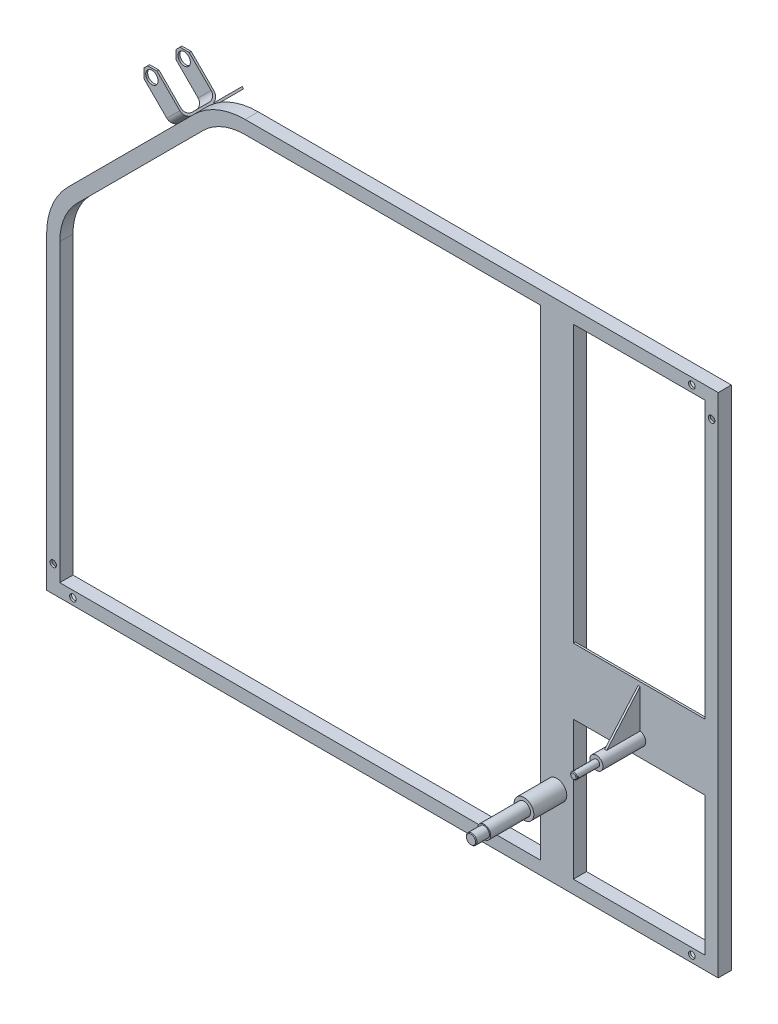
ISO-10303-21;
HEADER;
FILE_DESCRIPTION(('STEP AP214'),'2;1');
FILE_NAME('part.step','',(''),(''),'','','');
FILE_SCHEMA(('AUTOMOTIVE_DESIGN { 1 0 10303 214 1 1 1 1 }'));
ENDSEC;
DATA;
#1=APPLICATION_CONTEXT('core data for automotive mechanical design processes');
#2=APPLICATION_PROTOCOL_DEFINITION('international standard','automotive_design',2000,#1);
#3=PRODUCT_CONTEXT('',#1,'mechanical');
#4=PRODUCT('Part','Part','',(#3));
#5=PRODUCT_RELATED_PRODUCT_CATEGORY('part','',(#4));
#6=PRODUCT_DEFINITION_FORMATION('','',#4);
#7=PRODUCT_DEFINITION_CONTEXT('part definition',#1,'design');
#8=PRODUCT_DEFINITION('design','',#6,#7);
#9=PRODUCT_DEFINITION_SHAPE('','',#8);
#10=(LENGTH_UNIT() NAMED_UNIT(*) SI_UNIT(.MILLI.,.METRE.));
#11=(NAMED_UNIT(*) PLANE_ANGLE_UNIT() SI_UNIT($,.RADIAN.));
#12=(NAMED_UNIT(*) SI_UNIT($,.STERADIAN.) SOLID_ANGLE_UNIT());
#13=UNCERTAINTY_MEASURE_WITH_UNIT(LENGTH_MEASURE(1.E-05),#10,'distance_accuracy_value','');
#14=(GEOMETRIC_REPRESENTATION_CONTEXT(3) GLOBAL_UNCERTAINTY_ASSIGNED_CONTEXT((#13)) GLOBAL_UNIT_ASSIGNED_CONTEXT((#10,
#11,#12)) REPRESENTATION_CONTEXT('',''));
#15=CARTESIAN_POINT('',(0.,0.,0.));
#16=DIRECTION('',(0.,0.,1.));
#17=DIRECTION('',(1.,0.,0.));
#18=AXIS2_PLACEMENT_3D('',#15,#16,#17);
#19=CARTESIAN_POINT('',(-1056.56854249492,10.,-10.0000000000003));
#20=DIRECTION('',(0.,0.,-1.));
#21=DIRECTION('',(-1.,0.,0.));
#22=AXIS2_PLACEMENT_3D('',#19,#20,#21);
#23=PLANE('',#22);
#24=CARTESIAN_POINT('',(-1000.,29.9999999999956,-10.0000000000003));
#25=DIRECTION('',(0.,0.,-1.));
#26=DIRECTION('',(-1.,0.,0.));
#27=AXIS2_PLACEMENT_3D('',#24,#25,#26);
#28=CIRCLE('',#27,4.90359405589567);
#29=CARTESIAN_POINT('',(-1004.9035940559,29.9999999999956,-10.0000000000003));
#30=VERTEX_POINT('',#29);
#31=EDGE_CURVE('E1403',#30,#30,#28,.T.);
#32=ORIENTED_EDGE('',*,*,#31,.F.);
#33=EDGE_LOOP('',(#32));
#34=FACE_BOUND('',#33,.T.);
#35=CARTESIAN_POINT('',(-30.0000000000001,0.,-10.));
#36=DIRECTION('',(0.,0.,-1.));
#37=DIRECTION('',(-1.,0.,0.));
#38=AXIS2_PLACEMENT_3D('',#35,#36,#37);
#39=CIRCLE('',#38,5.);
#40=CARTESIAN_POINT('',(-25.0000000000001,0.,-10.));
#41=VERTEX_POINT('',#40);
#42=EDGE_CURVE('E2294',#41,#41,#39,.T.);
#43=ORIENTED_EDGE('',*,*,#42,.F.);
#44=EDGE_LOOP('',(#43));
#45=FACE_BOUND('',#44,.T.);
#46=CARTESIAN_POINT('',(3.33066907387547E-13,720.,-10.));
#47=DIRECTION('',(0.,0.,-1.));
#48=DIRECTION('',(-1.,0.,0.));
#49=AXIS2_PLACEMENT_3D('',#46,#47,#48);
#50=CIRCLE('',#49,5.);
#51=CARTESIAN_POINT('',(5.00000000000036,720.,-10.));
#52=VERTEX_POINT('',#51);
#53=EDGE_CURVE('E2301',#52,#52,#50,.T.);
#54=ORIENTED_EDGE('',*,*,#53,.F.);
#55=EDGE_LOOP('',(#54));
#56=FACE_BOUND('',#55,.T.);
#57=CARTESIAN_POINT('',(-970.,2.22044604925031E-13,-10.0000000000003));
#58=DIRECTION('',(0.,0.,-1.));
#59=DIRECTION('',(-1.,0.,0.));
#60=AXIS2_PLACEMENT_3D('',#57,#58,#59);
#61=CIRCLE('',#60,5.00000000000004);
#62=CARTESIAN_POINT('',(-965.,2.04718362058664E-13,-10.0000000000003));
#63=VERTEX_POINT('',#62);
#64=EDGE_CURVE('E2308',#63,#63,#61,.T.);
#65=ORIENTED_EDGE('',*,*,#64,.F.);
#66=EDGE_LOOP('',(#65));
#67=FACE_BOUND('',#66,.T.);
#68=CARTESIAN_POINT('',(-30.0000000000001,750.,-10.0000000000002));
#69=DIRECTION('',(0.,0.,-1.));
#70=DIRECTION('',(-1.,0.,0.));
#71=AXIS2_PLACEMENT_3D('',#68,#69,#70);
#72=CIRCLE('',#71,5.);
#73=CARTESIAN_POINT('',(-25.0000000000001,750.,-10.0000000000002));
#74=VERTEX_POINT('',#73);
#75=EDGE_CURVE('E551',#74,#74,#72,.T.);
#76=ORIENTED_EDGE('',*,*,#75,.F.);
#77=EDGE_LOOP('',(#76));
#78=FACE_BOUND('',#77,.T.);
#79=DIRECTION('',(0.,-0.999999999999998,0.));
#80=VECTOR('',#79,1.);
#81=CARTESIAN_POINT('',(-10.0000000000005,739.999999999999,-10.0000000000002));
#82=LINE('',#81,#80);
#83=CARTESIAN_POINT('',(-10.,220.455625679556,-10.));
#84=VERTEX_POINT('',#83);
#85=CARTESIAN_POINT('',(-9.99999999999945,10.,-10.));
#86=VERTEX_POINT('',#85);
#87=EDGE_CURVE('E840',#84,#86,#82,.T.);
#88=ORIENTED_EDGE('',*,*,#87,.F.);
#89=DIRECTION('',(1.,0.,0.));
#90=VECTOR('',#89,1.);
#91=CARTESIAN_POINT('',(-500000.000000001,220.455625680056,-10.0000000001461));
#92=LINE('',#91,#90);
#93=CARTESIAN_POINT('',(-209.99999999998,220.455625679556,-9.99999999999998));
#94=VERTEX_POINT('',#93);
#95=EDGE_CURVE('E774',#94,#84,#92,.T.);
#96=ORIENTED_EDGE('',*,*,#95,.F.);
#97=DIRECTION('',(0.,0.999999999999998,0.));
#98=VECTOR('',#97,1.);
#99=CARTESIAN_POINT('',(-209.999999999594,-499999.999999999,-9.99999999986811));
#100=LINE('',#99,#98);
#101=CARTESIAN_POINT('',(-210.,10.,-10.));
#102=VERTEX_POINT('',#101);
#103=EDGE_CURVE('E826',#102,#94,#100,.T.);
#104=ORIENTED_EDGE('',*,*,#103,.F.);
#105=DIRECTION('',(1.,0.,0.));
#106=VECTOR('',#105,1.);
#107=CARTESIAN_POINT('',(-1056.56854249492,10.,-10.0000000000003));
#108=LINE('',#107,#106);
#109=EDGE_CURVE('E1129',#102,#86,#108,.T.);
#110=ORIENTED_EDGE('',*,*,#109,.T.);
#111=EDGE_LOOP('',(#88,#96,#104,#110));
#112=FACE_BOUND('',#111,.T.);
#113=DIRECTION('',(0.,-0.999999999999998,0.));
#114=VECTOR('',#113,1.);
#115=CARTESIAN_POINT('',(9.99999999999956,760.,-10.0000000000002));
#116=LINE('',#115,#114);
#117=CARTESIAN_POINT('',(9.99999999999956,760.,-10.0000000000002));
#118=VERTEX_POINT('',#117);
#119=CARTESIAN_POINT('',(9.99999999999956,-9.99999999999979,-10.));
#120=VERTEX_POINT('',#119);
#121=EDGE_CURVE('E1066',#118,#120,#116,.T.);
#122=ORIENTED_EDGE('',*,*,#121,.T.);
#123=DIRECTION('',(1.,0.,0.));
#124=VECTOR('',#123,1.);
#125=CARTESIAN_POINT('',(-1056.56854249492,-9.99999999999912,-10.0000000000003));
#126=LINE('',#125,#124);
#127=CARTESIAN_POINT('',(-1010.,-10.,-10.0000000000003));
#128=VERTEX_POINT('',#127);
#129=EDGE_CURVE('E1144',#128,#120,#126,.T.);
#130=ORIENTED_EDGE('',*,*,#129,.F.);
#131=DIRECTION('',(0.,0.999999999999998,0.));
#132=VECTOR('',#131,1.);
#133=CARTESIAN_POINT('',(-1010.,-10.,-10.0000000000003));
#134=LINE('',#133,#132);
#135=CARTESIAN_POINT('',(-1010.,458.578643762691,-10.0000000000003));
#136=VERTEX_POINT('',#135);
#137=EDGE_CURVE('E881',#128,#136,#134,.T.);
#138=ORIENTED_EDGE('',*,*,#137,.T.);
#139=CARTESIAN_POINT('',(-900.,458.578643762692,-10.0000000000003));
#140=DIRECTION('',(0.,0.,-1.));
#141=DIRECTION('',(-1.,0.,0.));
#142=AXIS2_PLACEMENT_3D('',#139,#140,#141);
#143=CIRCLE('',#142,110.);
#144=CARTESIAN_POINT('',(-977.781745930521,536.360389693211,-10.0000000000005));
#145=VERTEX_POINT('',#144);
#146=EDGE_CURVE('E930',#136,#145,#143,.T.);
#147=ORIENTED_EDGE('',*,*,#146,.T.);
#148=DIRECTION('',(0.707106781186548,0.707106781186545,0.));
#149=VECTOR('',#148,1.);
#150=CARTESIAN_POINT('',(-977.781745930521,536.360389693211,-10.0000000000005));
#151=LINE('',#150,#149);
#152=CARTESIAN_POINT('',(-803.759757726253,710.382377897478,-10.0000000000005));
#153=VERTEX_POINT('',#152);
#154=EDGE_CURVE('E966',#145,#153,#151,.T.);
#155=ORIENTED_EDGE('',*,*,#154,.T.);
#156=DIRECTION('',(-0.707106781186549,0.707106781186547,0.));
#157=VECTOR('',#156,1.);
#158=CARTESIAN_POINT('',(-801.638437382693,708.261057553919,-10.0000000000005));
#159=LINE('',#158,#157);
#160=CARTESIAN_POINT('',(-801.638437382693,708.261057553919,-10.0000000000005));
#161=VERTEX_POINT('',#160);
#162=EDGE_CURVE('E579',#161,#153,#159,.T.);
#163=ORIENTED_EDGE('',*,*,#162,.F.);
#164=DIRECTION('',(-0.707106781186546,-0.707106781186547,0.));
#165=VECTOR('',#164,1.);
#166=CARTESIAN_POINT('',(-781.83944750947,728.060047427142,-10.0000000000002));
#167=LINE('',#166,#165);
#168=CARTESIAN_POINT('',(-781.83944750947,728.060047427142,-10.0000000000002));
#169=VERTEX_POINT('',#168);
#170=EDGE_CURVE('E576',#169,#161,#167,.T.);
#171=ORIENTED_EDGE('',*,*,#170,.F.);
#172=DIRECTION('',(0.707106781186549,-0.707106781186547,0.));
#173=VECTOR('',#172,1.);
#174=CARTESIAN_POINT('',(-783.96076785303,730.181367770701,-10.0000000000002));
#175=LINE('',#174,#173);
#176=CARTESIAN_POINT('',(-783.923744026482,730.144343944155,-10.0000000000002));
#177=VERTEX_POINT('',#176);
#178=EDGE_CURVE('E572',#177,#169,#175,.T.);
#179=ORIENTED_EDGE('',*,*,#178,.F.);
#180=CARTESIAN_POINT('',(-708.57864376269,650.,-10.0000000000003));
#181=DIRECTION('',(0.,0.,-1.));
#182=DIRECTION('',(-1.,0.,0.));
#183=AXIS2_PLACEMENT_3D('',#180,#181,#182);
#184=CIRCLE('',#183,110.);
#185=CARTESIAN_POINT('',(-708.578643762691,759.999999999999,-10.0000000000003));
#186=VERTEX_POINT('',#185);
#187=EDGE_CURVE('E1002',#177,#186,#184,.T.);
#188=ORIENTED_EDGE('',*,*,#187,.T.);
#189=DIRECTION('',(1.,0.,0.));
#190=VECTOR('',#189,1.);
#191=CARTESIAN_POINT('',(-708.578643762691,759.999999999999,-10.0000000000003));
#192=LINE('',#191,#190);
#193=EDGE_CURVE('E1028',#186,#118,#192,.T.);
#194=ORIENTED_EDGE('',*,*,#193,.T.);
#195=EDGE_LOOP('',(#122,#130,#138,#147,#155,#163,#171,#179,#188,#194));
#196=FACE_BOUND('',#195,.T.);
#197=DIRECTION('',(1.,0.,0.));
#198=VECTOR('',#197,1.);
#199=CARTESIAN_POINT('',(-500000.000000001,270.455625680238,-10.0000000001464));
#200=LINE('',#199,#198);
#201=CARTESIAN_POINT('',(-209.999999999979,270.455625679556,-10.));
#202=VERTEX_POINT('',#201);
#203=CARTESIAN_POINT('',(-10.0000000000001,270.455625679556,-10.));
#204=VERTEX_POINT('',#203);
#205=EDGE_CURVE('E776',#202,#204,#200,.T.);
#206=ORIENTED_EDGE('',*,*,#205,.T.);
#207=CARTESIAN_POINT('',(-10.0000000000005,739.999999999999,-10.0000000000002));
#208=VERTEX_POINT('',#207);
#209=EDGE_CURVE('E1077',#208,#204,#82,.T.);
#210=ORIENTED_EDGE('',*,*,#209,.F.);
#211=DIRECTION('',(1.,0.,0.));
#212=VECTOR('',#211,1.);
#213=CARTESIAN_POINT('',(-708.57864376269,740.,-10.0000000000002));
#214=LINE('',#213,#212);
#215=CARTESIAN_POINT('',(-210.,740.,-10.));
#216=VERTEX_POINT('',#215);
#217=EDGE_CURVE('E1031',#216,#208,#214,.T.);
#218=ORIENTED_EDGE('',*,*,#217,.F.);
#219=EDGE_CURVE('E829',#202,#216,#100,.T.);
#220=ORIENTED_EDGE('',*,*,#219,.F.);
#221=EDGE_LOOP('',(#206,#210,#218,#220));
#222=FACE_BOUND('',#221,.T.);
#223=DIRECTION('',(0.,0.999999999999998,0.));
#224=VECTOR('',#223,1.);
#225=CARTESIAN_POINT('',(-990.,10.,-10.0000000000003));
#226=LINE('',#225,#224);
#227=CARTESIAN_POINT('',(-990.,10.,-10.0000000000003));
#228=VERTEX_POINT('',#227);
#229=CARTESIAN_POINT('',(-990.000000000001,458.57864376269,-10.0000000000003));
#230=VERTEX_POINT('',#229);
#231=EDGE_CURVE('E884',#228,#230,#226,.T.);
#232=ORIENTED_EDGE('',*,*,#231,.F.);
#233=CARTESIAN_POINT('',(-260.,10.,-10.));
#234=VERTEX_POINT('',#233);
#235=EDGE_CURVE('E1213',#228,#234,#108,.T.);
#236=ORIENTED_EDGE('',*,*,#235,.T.);
#237=DIRECTION('',(0.,0.999999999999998,0.));
#238=VECTOR('',#237,1.);
#239=CARTESIAN_POINT('',(-259.999999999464,-499999.999999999,-9.99999999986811));
#240=LINE('',#239,#238);
#241=CARTESIAN_POINT('',(-260.,740.,-10.));
#242=VERTEX_POINT('',#241);
#243=EDGE_CURVE('E808',#234,#242,#240,.T.);
#244=ORIENTED_EDGE('',*,*,#243,.T.);
#245=CARTESIAN_POINT('',(-708.57864376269,740.,-10.0000000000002));
#246=VERTEX_POINT('',#245);
#247=EDGE_CURVE('E848',#246,#242,#214,.T.);
#248=ORIENTED_EDGE('',*,*,#247,.F.);
#249=CARTESIAN_POINT('',(-708.57864376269,650.,-10.0000000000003));
#250=DIRECTION('',(0.,0.,-1.));
#251=DIRECTION('',(-1.,0.,0.));
#252=AXIS2_PLACEMENT_3D('',#249,#250,#251);
#253=CIRCLE('',#252,89.9999999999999);
#254=CARTESIAN_POINT('',(-772.21825406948,713.639610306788,-10.0000000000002));
#255=VERTEX_POINT('',#254);
#256=EDGE_CURVE('E1006',#255,#246,#253,.T.);
#257=ORIENTED_EDGE('',*,*,#256,.F.);
#258=DIRECTION('',(0.707106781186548,0.707106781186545,0.));
#259=VECTOR('',#258,1.);
#260=CARTESIAN_POINT('',(-963.639610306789,522.218254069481,-10.0000000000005));
#261=LINE('',#260,#259);
#262=CARTESIAN_POINT('',(-963.639610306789,522.218254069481,-10.0000000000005));
#263=VERTEX_POINT('',#262);
#264=EDGE_CURVE('E969',#263,#255,#261,.T.);
#265=ORIENTED_EDGE('',*,*,#264,.F.);
#266=CARTESIAN_POINT('',(-900.,458.578643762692,-10.0000000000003));
#267=DIRECTION('',(0.,0.,-1.));
#268=DIRECTION('',(-1.,0.,0.));
#269=AXIS2_PLACEMENT_3D('',#266,#267,#268);
#270=CIRCLE('',#269,90.);
#271=EDGE_CURVE('E933',#230,#263,#270,.T.);
#272=ORIENTED_EDGE('',*,*,#271,.F.);
#273=EDGE_LOOP('',(#232,#236,#244,#248,#257,#265,#272));
#274=FACE_BOUND('',#273,.T.);
#275=ADVANCED_FACE('F86',(#34,#45,#56,#67,#78,#112,#196,#222,#274),#23,.T.);
#276=CARTESIAN_POINT('',(-783.96076785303,730.181367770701,14.9999999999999));
#277=DIRECTION('',(-0.707106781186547,0.707106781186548,0.));
#278=DIRECTION('',(-0.707106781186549,-0.707106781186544,0.));
#279=AXIS2_PLACEMENT_3D('',#276,#277,#278);
#280=PLANE('',#279);
#281=DIRECTION('',(0.707106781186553,0.707106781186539,0.));
#282=VECTOR('',#281,1.);
#283=CARTESIAN_POINT('',(-803.759757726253,710.382377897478,-10.0000000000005));
#284=LINE('',#283,#282);
#285=CARTESIAN_POINT('',(-786.360389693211,727.78174593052,-10.0000000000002));
#286=VERTEX_POINT('',#285);
#287=CARTESIAN_POINT('',(-783.96076785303,730.181367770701,-10.0000000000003));
#288=VERTEX_POINT('',#287);
#289=EDGE_CURVE('E570',#286,#288,#284,.T.);
#290=ORIENTED_EDGE('',*,*,#289,.T.);
#291=DIRECTION('',(0.,0.,-1.));
#292=VECTOR('',#291,1.);
#293=CARTESIAN_POINT('',(-783.96076785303,730.181367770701,14.9999999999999));
#294=LINE('',#293,#292);
#295=CARTESIAN_POINT('',(-783.96076785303,730.181367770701,14.9999999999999));
#296=VERTEX_POINT('',#295);
#297=EDGE_CURVE('E658',#296,#288,#294,.T.);
#298=ORIENTED_EDGE('',*,*,#297,.F.);
#299=DIRECTION('',(-0.707106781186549,-0.707106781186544,0.));
#300=VECTOR('',#299,1.);
#301=CARTESIAN_POINT('',(-783.96076785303,730.181367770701,14.9999999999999));
#302=LINE('',#301,#300);
#303=CARTESIAN_POINT('',(-803.759757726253,710.382377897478,14.9999999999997));
#304=VERTEX_POINT('',#303);
#305=EDGE_CURVE('E674',#296,#304,#302,.T.);
#306=ORIENTED_EDGE('',*,*,#305,.T.);
#307=DIRECTION('',(0.,0.,-1.));
#308=VECTOR('',#307,1.);
#309=CARTESIAN_POINT('',(-803.759757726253,710.382377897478,14.9999999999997));
#310=LINE('',#309,#308);
#311=CARTESIAN_POINT('',(-803.759757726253,710.382377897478,9.99999999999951));
#312=VERTEX_POINT('',#311);
#313=EDGE_CURVE('E634',#304,#312,#310,.T.);
#314=ORIENTED_EDGE('',*,*,#313,.T.);
#315=DIRECTION('',(0.707106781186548,0.707106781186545,0.));
#316=VECTOR('',#315,1.);
#317=CARTESIAN_POINT('',(-977.781745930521,536.360389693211,9.99999999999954));
#318=LINE('',#317,#316);
#319=CARTESIAN_POINT('',(-786.360389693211,727.78174593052,9.99999999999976));
#320=VERTEX_POINT('',#319);
#321=EDGE_CURVE('E963',#312,#320,#318,.T.);
#322=ORIENTED_EDGE('',*,*,#321,.T.);
#323=DIRECTION('',(0.,0.,1.));
#324=VECTOR('',#323,1.);
#325=CARTESIAN_POINT('',(-786.360389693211,727.78174593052,9.99999999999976));
#326=LINE('',#325,#324);
#327=EDGE_CURVE('E946',#286,#320,#326,.T.);
#328=ORIENTED_EDGE('',*,*,#327,.F.);
#329=EDGE_LOOP('',(#290,#298,#306,#314,#322,#328));
#330=FACE_BOUND('',#329,.T.);
#331=ADVANCED_FACE('F1188',(#330),#280,.F.);
#332=CARTESIAN_POINT('',(-110.,245.455625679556,75.0000000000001));
#333=DIRECTION('',(0.,0.,1.));
#334=DIRECTION('',(1.,0.,0.));
#335=AXIS2_PLACEMENT_3D('',#332,#333,#334);
#336=PLANE('',#335);
#337=CARTESIAN_POINT('',(-110.,245.455625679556,75.0000000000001));
#338=DIRECTION('',(0.,0.,1.));
#339=DIRECTION('',(1.,0.,0.));
#340=AXIS2_PLACEMENT_3D('',#337,#338,#339);
#341=CIRCLE('',#340,10.);
#342=CARTESIAN_POINT('',(-100.,245.455625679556,75.0000000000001));
#343=VERTEX_POINT('',#342);
#344=EDGE_CURVE('E702',#343,#343,#341,.T.);
#345=ORIENTED_EDGE('',*,*,#344,.T.);
#346=EDGE_LOOP('',(#345));
#347=FACE_BOUND('',#346,.T.);
#348=CARTESIAN_POINT('',(-110.,245.455625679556,75.0000000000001));
#349=DIRECTION('',(0.,0.,1.));
#350=DIRECTION('',(1.,0.,0.));
#351=AXIS2_PLACEMENT_3D('',#348,#349,#350);
#352=CIRCLE('',#351,4.99999999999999);
#353=CARTESIAN_POINT('',(-105.,245.455625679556,75.0000000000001));
#354=VERTEX_POINT('',#353);
#355=EDGE_CURVE('E697',#354,#354,#352,.T.);
#356=ORIENTED_EDGE('',*,*,#355,.F.);
#357=EDGE_LOOP('',(#356));
#358=FACE_BOUND('',#357,.T.);
#359=ADVANCED_FACE('F1519',(#347,#358),#336,.T.);
#360=CARTESIAN_POINT('',(-1056.56854249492,10.,9.99999999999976));
#361=DIRECTION('',(0.,0.,1.));
#362=DIRECTION('',(1.,0.,0.));
#363=AXIS2_PLACEMENT_3D('',#360,#361,#362);
#364=PLANE('',#363);
#365=CARTESIAN_POINT('',(-1000.,29.9999999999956,9.99999999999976));
#366=DIRECTION('',(0.,0.,1.));
#367=DIRECTION('',(1.,0.,0.));
#368=AXIS2_PLACEMENT_3D('',#365,#366,#367);
#369=CIRCLE('',#368,4.90359405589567);
#370=CARTESIAN_POINT('',(-1004.9035940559,29.9999999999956,9.99999999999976));
#371=VERTEX_POINT('',#370);
#372=EDGE_CURVE('E2287',#371,#371,#369,.T.);
#373=ORIENTED_EDGE('',*,*,#372,.F.);
#374=EDGE_LOOP('',(#373));
#375=FACE_BOUND('',#374,.T.);
#376=CARTESIAN_POINT('',(-30.0000000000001,0.,10.));
#377=DIRECTION('',(0.,0.,1.));
#378=DIRECTION('',(1.,0.,0.));
#379=AXIS2_PLACEMENT_3D('',#376,#377,#378);
#380=CIRCLE('',#379,5.);
#381=CARTESIAN_POINT('',(-25.0000000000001,0.,10.));
#382=VERTEX_POINT('',#381);
#383=EDGE_CURVE('E1398',#382,#382,#380,.T.);
#384=ORIENTED_EDGE('',*,*,#383,.F.);
#385=EDGE_LOOP('',(#384));
#386=FACE_BOUND('',#385,.T.);
#387=CARTESIAN_POINT('',(3.33066907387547E-13,720.,9.99999999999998));
#388=DIRECTION('',(0.,0.,1.));
#389=DIRECTION('',(1.,0.,0.));
#390=AXIS2_PLACEMENT_3D('',#387,#388,#389);
#391=CIRCLE('',#390,5.);
#392=CARTESIAN_POINT('',(5.00000000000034,720.,9.99999999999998));
#393=VERTEX_POINT('',#392);
#394=EDGE_CURVE('E1393',#393,#393,#391,.T.);
#395=ORIENTED_EDGE('',*,*,#394,.F.);
#396=EDGE_LOOP('',(#395));
#397=FACE_BOUND('',#396,.T.);
#398=CARTESIAN_POINT('',(-970.,2.22044604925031E-13,9.99999999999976));
#399=DIRECTION('',(0.,0.,1.));
#400=DIRECTION('',(1.,0.,0.));
#401=AXIS2_PLACEMENT_3D('',#398,#399,#400);
#402=CIRCLE('',#401,5.00000000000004);
#403=CARTESIAN_POINT('',(-965.,2.18158824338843E-13,9.99999999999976));
#404=VERTEX_POINT('',#403);
#405=EDGE_CURVE('E1388',#404,#404,#402,.T.);
#406=ORIENTED_EDGE('',*,*,#405,.F.);
#407=EDGE_LOOP('',(#406));
#408=FACE_BOUND('',#407,.T.);
#409=CARTESIAN_POINT('',(-30.0000000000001,750.,9.99999999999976));
#410=DIRECTION('',(0.,0.,1.));
#411=DIRECTION('',(1.,0.,0.));
#412=AXIS2_PLACEMENT_3D('',#409,#410,#411);
#413=CIRCLE('',#412,5.);
#414=CARTESIAN_POINT('',(-25.0000000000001,750.,9.99999999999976));
#415=VERTEX_POINT('',#414);
#416=EDGE_CURVE('E1383',#415,#415,#413,.T.);
#417=ORIENTED_EDGE('',*,*,#416,.F.);
#418=EDGE_LOOP('',(#417));
#419=FACE_BOUND('',#418,.T.);
#420=DIRECTION('',(0.,-0.999999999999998,0.));
#421=VECTOR('',#420,1.);
#422=CARTESIAN_POINT('',(-10.0000000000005,739.999999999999,9.99999999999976));
#423=LINE('',#422,#421);
#424=CARTESIAN_POINT('',(-9.9999999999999,220.455625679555,10.));
#425=VERTEX_POINT('',#424);
#426=CARTESIAN_POINT('',(-9.99999999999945,10.,10.));
#427=VERTEX_POINT('',#426);
#428=EDGE_CURVE('E1119',#425,#427,#423,.T.);
#429=ORIENTED_EDGE('',*,*,#428,.T.);
#430=DIRECTION('',(1.,0.,0.));
#431=VECTOR('',#430,1.);
#432=CARTESIAN_POINT('',(-1056.56854249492,10.,9.99999999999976));
#433=LINE('',#432,#431);
#434=CARTESIAN_POINT('',(-210.,9.99999999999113,10.));
#435=VERTEX_POINT('',#434);
#436=EDGE_CURVE('E1159',#435,#427,#433,.T.);
#437=ORIENTED_EDGE('',*,*,#436,.F.);
#438=DIRECTION('',(0.,0.999999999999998,0.));
#439=VECTOR('',#438,1.);
#440=CARTESIAN_POINT('',(-209.999999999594,-499999.999999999,10.0000000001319));
#441=LINE('',#440,#439);
#442=CARTESIAN_POINT('',(-209.99999999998,220.455625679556,10.));
#443=VERTEX_POINT('',#442);
#444=EDGE_CURVE('E822',#435,#443,#441,.T.);
#445=ORIENTED_EDGE('',*,*,#444,.T.);
#446=DIRECTION('',(1.,0.,0.));
#447=VECTOR('',#446,1.);
#448=CARTESIAN_POINT('',(-500000.000000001,220.455625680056,9.99999999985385));
#449=LINE('',#448,#447);
#450=EDGE_CURVE('E751',#443,#425,#449,.T.);
#451=ORIENTED_EDGE('',*,*,#450,.T.);
#452=EDGE_LOOP('',(#429,#437,#445,#451));
#453=FACE_BOUND('',#452,.T.);
#454=DIRECTION('',(0.,0.999999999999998,0.));
#455=VECTOR('',#454,1.);
#456=CARTESIAN_POINT('',(-108.677650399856,10.,10.));
#457=LINE('',#456,#455);
#458=CARTESIAN_POINT('',(-108.677650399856,255.367809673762,10.));
#459=VERTEX_POINT('',#458);
#460=CARTESIAN_POINT('',(-108.677650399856,314.004696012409,9.99999999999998));
#461=VERTEX_POINT('',#460);
#462=EDGE_CURVE('E561',#459,#461,#457,.T.);
#463=ORIENTED_EDGE('',*,*,#462,.F.);
#464=CARTESIAN_POINT('',(-110.,245.455625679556,10.));
#465=DIRECTION('',(0.,0.,1.));
#466=DIRECTION('',(1.,0.,0.));
#467=AXIS2_PLACEMENT_3D('',#464,#465,#466);
#468=CIRCLE('',#467,10.);
#469=CARTESIAN_POINT('',(-111.677650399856,255.313895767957,10.));
#470=VERTEX_POINT('',#469);
#471=EDGE_CURVE('E700',#470,#459,#468,.T.);
#472=ORIENTED_EDGE('',*,*,#471,.F.);
#473=DIRECTION('',(0.,0.999999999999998,0.));
#474=VECTOR('',#473,1.);
#475=CARTESIAN_POINT('',(-111.677650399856,10.,10.));
#476=LINE('',#475,#474);
#477=CARTESIAN_POINT('',(-111.677650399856,314.004696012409,10.));
#478=VERTEX_POINT('',#477);
#479=EDGE_CURVE('E114',#470,#478,#476,.T.);
#480=ORIENTED_EDGE('',*,*,#479,.T.);
#481=DIRECTION('',(-1.,0.,0.));
#482=VECTOR('',#481,1.);
#483=CARTESIAN_POINT('',(-1056.56854249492,314.004696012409,9.99999999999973));
#484=LINE('',#483,#482);
#485=EDGE_CURVE('E109',#461,#478,#484,.T.);
#486=ORIENTED_EDGE('',*,*,#485,.F.);
#487=EDGE_LOOP('',(#463,#472,#480,#486));
#488=FACE_BOUND('',#487,.T.);
#489=DIRECTION('',(1.,0.,0.));
#490=VECTOR('',#489,1.);
#491=CARTESIAN_POINT('',(-1056.56854249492,-9.9999999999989,9.99999999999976));
#492=LINE('',#491,#490);
#493=CARTESIAN_POINT('',(-1010.,-10.,9.99999999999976));
#494=VERTEX_POINT('',#493);
#495=CARTESIAN_POINT('',(10.0000000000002,-10.,10.));
#496=VERTEX_POINT('',#495);
#497=EDGE_CURVE('E1202',#494,#496,#492,.T.);
#498=ORIENTED_EDGE('',*,*,#497,.T.);
#499=DIRECTION('',(0.,-0.999999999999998,0.));
#500=VECTOR('',#499,1.);
#501=CARTESIAN_POINT('',(10.0000000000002,759.999999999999,9.99999999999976));
#502=LINE('',#501,#500);
#503=CARTESIAN_POINT('',(10.0000000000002,759.999999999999,9.99999999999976));
#504=VERTEX_POINT('',#503);
#505=EDGE_CURVE('E1106',#504,#496,#502,.T.);
#506=ORIENTED_EDGE('',*,*,#505,.F.);
#507=DIRECTION('',(1.,0.,0.));
#508=VECTOR('',#507,1.);
#509=CARTESIAN_POINT('',(-708.57864376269,760.,9.99999999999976));
#510=LINE('',#509,#508);
#511=CARTESIAN_POINT('',(-708.57864376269,760.,9.99999999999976));
#512=VERTEX_POINT('',#511);
#513=EDGE_CURVE('E1025',#512,#504,#510,.T.);
#514=ORIENTED_EDGE('',*,*,#513,.F.);
#515=CARTESIAN_POINT('',(-708.57864376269,650.,9.99999999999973));
#516=DIRECTION('',(0.,0.,-1.));
#517=DIRECTION('',(-1.,0.,0.));
#518=AXIS2_PLACEMENT_3D('',#515,#516,#517);
#519=CIRCLE('',#518,110.);
#520=EDGE_CURVE('E999',#320,#512,#519,.T.);
#521=ORIENTED_EDGE('',*,*,#520,.F.);
#522=ORIENTED_EDGE('',*,*,#321,.F.);
#523=CARTESIAN_POINT('',(-977.781745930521,536.360389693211,9.99999999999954));
#524=VERTEX_POINT('',#523);
#525=EDGE_CURVE('E964',#524,#312,#318,.T.);
#526=ORIENTED_EDGE('',*,*,#525,.F.);
#527=CARTESIAN_POINT('',(-900.,458.578643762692,9.99999999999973));
#528=DIRECTION('',(0.,0.,-1.));
#529=DIRECTION('',(-1.,0.,0.));
#530=AXIS2_PLACEMENT_3D('',#527,#528,#529);
#531=CIRCLE('',#530,110.);
#532=CARTESIAN_POINT('',(-1010.,458.578643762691,9.99999999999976));
#533=VERTEX_POINT('',#532);
#534=EDGE_CURVE('E927',#533,#524,#531,.T.);
#535=ORIENTED_EDGE('',*,*,#534,.F.);
#536=DIRECTION('',(0.,0.999999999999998,0.));
#537=VECTOR('',#536,1.);
#538=CARTESIAN_POINT('',(-1010.,-10.,9.99999999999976));
#539=LINE('',#538,#537);
#540=EDGE_CURVE('E878',#494,#533,#539,.T.);
#541=ORIENTED_EDGE('',*,*,#540,.F.);
#542=EDGE_LOOP('',(#498,#506,#514,#521,#522,#526,#535,#541));
#543=FACE_BOUND('',#542,.T.);
#544=CARTESIAN_POINT('',(-235.,115.,9.99999999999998));
#545=DIRECTION('',(0.,0.,1.));
#546=DIRECTION('',(1.,0.,0.));
#547=AXIS2_PLACEMENT_3D('',#544,#545,#546);
#548=CIRCLE('',#547,15.0000000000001);
#549=CARTESIAN_POINT('',(-220.,115.,9.99999999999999));
#550=VERTEX_POINT('',#549);
#551=EDGE_CURVE('E732',#550,#550,#548,.T.);
#552=ORIENTED_EDGE('',*,*,#551,.F.);
#553=EDGE_LOOP('',(#552));
#554=FACE_BOUND('',#553,.T.);
#555=CARTESIAN_POINT('',(-990.,10.,9.99999999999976));
#556=VERTEX_POINT('',#555);
#557=CARTESIAN_POINT('',(-260.,10.,10.));
#558=VERTEX_POINT('',#557);
#559=EDGE_CURVE('E875',#556,#558,#433,.T.);
#560=ORIENTED_EDGE('',*,*,#559,.F.);
#561=DIRECTION('',(0.,0.999999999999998,0.));
#562=VECTOR('',#561,1.);
#563=CARTESIAN_POINT('',(-990.,10.,9.99999999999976));
#564=LINE('',#563,#562);
#565=CARTESIAN_POINT('',(-990.000000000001,458.57864376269,9.99999999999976));
#566=VERTEX_POINT('',#565);
#567=EDGE_CURVE('E869',#556,#566,#564,.T.);
#568=ORIENTED_EDGE('',*,*,#567,.T.);
#569=CARTESIAN_POINT('',(-900.,458.578643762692,9.99999999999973));
#570=DIRECTION('',(0.,0.,-1.));
#571=DIRECTION('',(-1.,0.,0.));
#572=AXIS2_PLACEMENT_3D('',#569,#570,#571);
#573=CIRCLE('',#572,90.);
#574=CARTESIAN_POINT('',(-963.639610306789,522.218254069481,9.99999999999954));
#575=VERTEX_POINT('',#574);
#576=EDGE_CURVE('E914',#566,#575,#573,.T.);
#577=ORIENTED_EDGE('',*,*,#576,.T.);
#578=DIRECTION('',(0.707106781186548,0.707106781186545,0.));
#579=VECTOR('',#578,1.);
#580=CARTESIAN_POINT('',(-963.639610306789,522.218254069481,9.99999999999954));
#581=LINE('',#580,#579);
#582=CARTESIAN_POINT('',(-772.21825406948,713.639610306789,9.99999999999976));
#583=VERTEX_POINT('',#582);
#584=EDGE_CURVE('E950',#575,#583,#581,.T.);
#585=ORIENTED_EDGE('',*,*,#584,.T.);
#586=CARTESIAN_POINT('',(-708.57864376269,650.,9.99999999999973));
#587=DIRECTION('',(0.,0.,-1.));
#588=DIRECTION('',(-1.,0.,0.));
#589=AXIS2_PLACEMENT_3D('',#586,#587,#588);
#590=CIRCLE('',#589,90.);
#591=CARTESIAN_POINT('',(-708.57864376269,740.,9.99999999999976));
#592=VERTEX_POINT('',#591);
#593=EDGE_CURVE('E986',#583,#592,#590,.T.);
#594=ORIENTED_EDGE('',*,*,#593,.T.);
#595=DIRECTION('',(1.,0.,0.));
#596=VECTOR('',#595,1.);
#597=CARTESIAN_POINT('',(-708.57864376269,740.,9.99999999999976));
#598=LINE('',#597,#596);
#599=CARTESIAN_POINT('',(-260.,740.,9.99999999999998));
#600=VERTEX_POINT('',#599);
#601=EDGE_CURVE('E1022',#592,#600,#598,.T.);
#602=ORIENTED_EDGE('',*,*,#601,.T.);
#603=DIRECTION('',(0.,0.999999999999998,0.));
#604=VECTOR('',#603,1.);
#605=CARTESIAN_POINT('',(-259.999999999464,-499999.999999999,10.0000000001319));
#606=LINE('',#605,#604);
#607=EDGE_CURVE('E820',#558,#600,#606,.T.);
#608=ORIENTED_EDGE('',*,*,#607,.F.);
#609=EDGE_LOOP('',(#560,#568,#577,#585,#594,#602,#608));
#610=FACE_BOUND('',#609,.T.);
#611=CARTESIAN_POINT('',(-10.0000000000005,739.999999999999,9.99999999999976));
#612=VERTEX_POINT('',#611);
#613=CARTESIAN_POINT('',(-10.0000000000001,320.455625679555,10.));
#614=VERTEX_POINT('',#613);
#615=EDGE_CURVE('E1114',#612,#614,#423,.T.);
#616=ORIENTED_EDGE('',*,*,#615,.T.);
#617=DIRECTION('',(1.,0.,0.));
#618=VECTOR('',#617,1.);
#619=CARTESIAN_POINT('',(-500000.000000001,320.455625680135,9.99999999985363));
#620=LINE('',#619,#618);
#621=CARTESIAN_POINT('',(-210.,320.455625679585,9.99999999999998));
#622=VERTEX_POINT('',#621);
#623=EDGE_CURVE('E716',#622,#614,#620,.T.);
#624=ORIENTED_EDGE('',*,*,#623,.F.);
#625=CARTESIAN_POINT('',(-210.,740.,9.99999999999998));
#626=VERTEX_POINT('',#625);
#627=EDGE_CURVE('E825',#622,#626,#441,.T.);
#628=ORIENTED_EDGE('',*,*,#627,.T.);
#629=EDGE_CURVE('E1021',#626,#612,#598,.T.);
#630=ORIENTED_EDGE('',*,*,#629,.T.);
#631=EDGE_LOOP('',(#616,#624,#628,#630));
#632=FACE_BOUND('',#631,.T.);
#633=ADVANCED_FACE('F1196',(#375,#386,#397,#408,#419,#453,#488,#543,#554,#610,#632),#364,.T.);
#634=CARTESIAN_POINT('',(-10.0000000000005,739.999999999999,9.99999999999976));
#635=DIRECTION('',(1.,0.,0.));
#636=DIRECTION('',(0.,0.999999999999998,0.));
#637=AXIS2_PLACEMENT_3D('',#634,#635,#636);
#638=PLANE('',#637);
#639=DIRECTION('',(0.,-0.999999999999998,0.));
#640=VECTOR('',#639,1.);
#641=CARTESIAN_POINT('',(-10.0000000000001,270.455625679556,6.99999999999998));
#642=LINE('',#641,#640);
#643=CARTESIAN_POINT('',(-10.0000000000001,320.455625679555,7.00000000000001));
#644=VERTEX_POINT('',#643);
#645=CARTESIAN_POINT('',(-10.0000000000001,270.455625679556,6.99999999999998));
#646=VERTEX_POINT('',#645);
#647=EDGE_CURVE('E706',#644,#646,#642,.T.);
#648=ORIENTED_EDGE('',*,*,#647,.F.);
#649=DIRECTION('',(0.,0.,-1.));
#650=VECTOR('',#649,1.);
#651=CARTESIAN_POINT('',(-10.0000000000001,320.455625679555,10.));
#652=LINE('',#651,#650);
#653=EDGE_CURVE('E709',#614,#644,#652,.T.);
#654=ORIENTED_EDGE('',*,*,#653,.F.);
#655=ORIENTED_EDGE('',*,*,#615,.F.);
#656=DIRECTION('',(0.,0.,1.));
#657=VECTOR('',#656,1.);
#658=CARTESIAN_POINT('',(-10.0000000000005,739.999999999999,9.99999999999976));
#659=LINE('',#658,#657);
#660=EDGE_CURVE('E841',#208,#612,#659,.T.);
#661=ORIENTED_EDGE('',*,*,#660,.F.);
#662=ORIENTED_EDGE('',*,*,#209,.T.);
#663=DIRECTION('',(0.,0.,-1.));
#664=VECTOR('',#663,1.);
#665=CARTESIAN_POINT('',(-10.0000000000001,270.455625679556,9.99999999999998));
#666=LINE('',#665,#664);
#667=EDGE_CURVE('E743',#646,#204,#666,.T.);
#668=ORIENTED_EDGE('',*,*,#667,.F.);
#669=EDGE_LOOP('',(#648,#654,#655,#661,#662,#668));
#670=FACE_BOUND('',#669,.T.);
#671=ADVANCED_FACE('F1582',(#670),#638,.F.);
#672=CARTESIAN_POINT('',(-209.999999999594,-499999.999999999,10.0000000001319));
#673=DIRECTION('',(-1.,0.,0.));
#674=DIRECTION('',(0.,0.,1.));
#675=AXIS2_PLACEMENT_3D('',#672,#673,#674);
#676=PLANE('',#675);
#677=DIRECTION('',(0.,-0.999999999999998,0.));
#678=VECTOR('',#677,1.);
#679=CARTESIAN_POINT('',(-209.999999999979,270.455625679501,7.00000000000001));
#680=LINE('',#679,#678);
#681=CARTESIAN_POINT('',(-210.,320.455625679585,6.99999999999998));
#682=VERTEX_POINT('',#681);
#683=CARTESIAN_POINT('',(-209.999999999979,270.455625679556,7.00000000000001));
#684=VERTEX_POINT('',#683);
#685=EDGE_CURVE('E705',#682,#684,#680,.T.);
#686=ORIENTED_EDGE('',*,*,#685,.T.);
#687=DIRECTION('',(0.,0.,-1.));
#688=VECTOR('',#687,1.);
#689=CARTESIAN_POINT('',(-209.999999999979,270.455625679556,10.));
#690=LINE('',#689,#688);
#691=EDGE_CURVE('E769',#684,#202,#690,.T.);
#692=ORIENTED_EDGE('',*,*,#691,.T.);
#693=ORIENTED_EDGE('',*,*,#219,.T.);
#694=DIRECTION('',(0.,0.,1.));
#695=VECTOR('',#694,1.);
#696=CARTESIAN_POINT('',(-210.,740.,9.99999999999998));
#697=LINE('',#696,#695);
#698=EDGE_CURVE('E785',#216,#626,#697,.T.);
#699=ORIENTED_EDGE('',*,*,#698,.T.);
#700=ORIENTED_EDGE('',*,*,#627,.F.);
#701=DIRECTION('',(0.,0.,-1.));
#702=VECTOR('',#701,1.);
#703=CARTESIAN_POINT('',(-209.999999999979,320.455625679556,9.99999999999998));
#704=LINE('',#703,#702);
#705=EDGE_CURVE('E714',#622,#682,#704,.T.);
#706=ORIENTED_EDGE('',*,*,#705,.T.);
#707=EDGE_LOOP('',(#686,#692,#693,#699,#700,#706));
#708=FACE_BOUND('',#707,.T.);
#709=ADVANCED_FACE('F1623',(#708),#676,.F.);
#710=CARTESIAN_POINT('',(-500000.000000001,270.455625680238,9.99999999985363));
#711=DIRECTION('',(0.,-0.999999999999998,0.));
#712=DIRECTION('',(1.,0.,0.));
#713=AXIS2_PLACEMENT_3D('',#710,#711,#712);
#714=PLANE('',#713);
#715=ORIENTED_EDGE('',*,*,#667,.T.);
#716=ORIENTED_EDGE('',*,*,#205,.F.);
#717=ORIENTED_EDGE('',*,*,#691,.F.);
#718=DIRECTION('',(1.,0.,0.));
#719=VECTOR('',#718,1.);
#720=CARTESIAN_POINT('',(-500000.000000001,270.455625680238,6.99999999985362));
#721=LINE('',#720,#719);
#722=EDGE_CURVE('E710',#684,#646,#721,.T.);
#723=ORIENTED_EDGE('',*,*,#722,.T.);
#724=EDGE_LOOP('',(#715,#716,#717,#723));
#725=FACE_BOUND('',#724,.T.);
#726=ADVANCED_FACE('F1604',(#725),#714,.F.);
#727=CARTESIAN_POINT('',(-235.,115.,120.5));
#728=DIRECTION('',(0.,0.,1.));
#729=DIRECTION('',(1.,0.,0.));
#730=AXIS2_PLACEMENT_3D('',#727,#728,#729);
#731=PLANE('',#730);
#732=CARTESIAN_POINT('',(-235.,115.,120.5));
#733=DIRECTION('',(0.,0.,1.));
#734=DIRECTION('',(1.,0.,0.));
#735=AXIS2_PLACEMENT_3D('',#732,#733,#734);
#736=CIRCLE('',#735,10.0000000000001);
#737=CARTESIAN_POINT('',(-225.,115.,120.5));
#738=VERTEX_POINT('',#737);
#739=EDGE_CURVE('E729',#738,#738,#736,.T.);
#740=ORIENTED_EDGE('',*,*,#739,.T.);
#741=EDGE_LOOP('',(#740));
#742=FACE_BOUND('',#741,.T.);
#743=CARTESIAN_POINT('',(-235.,115.,120.5));
#744=DIRECTION('',(0.,0.,1.));
#745=DIRECTION('',(1.,0.,0.));
#746=AXIS2_PLACEMENT_3D('',#743,#744,#745);
#747=CIRCLE('',#746,8.00000000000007);
#748=CARTESIAN_POINT('',(-227.,115.,120.5));
#749=VERTEX_POINT('',#748);
#750=EDGE_CURVE('E713',#749,#749,#747,.T.);
#751=ORIENTED_EDGE('',*,*,#750,.F.);
#752=EDGE_LOOP('',(#751));
#753=FACE_BOUND('',#752,.T.);
#754=ADVANCED_FACE('F1600',(#742,#753),#731,.T.);
#755=CARTESIAN_POINT('',(-235.,115.,60.));
#756=DIRECTION('',(0.,0.,1.));
#757=DIRECTION('',(1.,0.,0.));
#758=AXIS2_PLACEMENT_3D('',#755,#756,#757);
#759=PLANE('',#758);
#760=CARTESIAN_POINT('',(-235.,115.,60.));
#761=DIRECTION('',(0.,0.,1.));
#762=DIRECTION('',(1.,0.,0.));
#763=AXIS2_PLACEMENT_3D('',#760,#761,#762);
#764=CIRCLE('',#763,15.0000000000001);
#765=CARTESIAN_POINT('',(-220.,115.,60.));
#766=VERTEX_POINT('',#765);
#767=EDGE_CURVE('E735',#766,#766,#764,.T.);
#768=ORIENTED_EDGE('',*,*,#767,.T.);
#769=EDGE_LOOP('',(#768));
#770=FACE_BOUND('',#769,.T.);
#771=CARTESIAN_POINT('',(-235.,115.,60.));
#772=DIRECTION('',(0.,0.,1.));
#773=DIRECTION('',(1.,0.,0.));
#774=AXIS2_PLACEMENT_3D('',#771,#772,#773);
#775=CIRCLE('',#774,10.0000000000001);
#776=CARTESIAN_POINT('',(-225.,115.,60.));
#777=VERTEX_POINT('',#776);
#778=EDGE_CURVE('E726',#777,#777,#775,.T.);
#779=ORIENTED_EDGE('',*,*,#778,.F.);
#780=EDGE_LOOP('',(#779));
#781=FACE_BOUND('',#780,.T.);
#782=ADVANCED_FACE('F1603',(#770,#781),#759,.T.);
#783=DIRECTION('',(0.,0.,1.));
#784=VECTOR('',#783,1.);
#785=CARTESIAN_POINT('',(-10.,220.455625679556,10.));
#786=LINE('',#785,#784);
#787=EDGE_CURVE('E739',#84,#425,#786,.T.);
#788=ORIENTED_EDGE('',*,*,#787,.F.);
#789=ORIENTED_EDGE('',*,*,#87,.T.);
#790=CARTESIAN_POINT('',(-9.99999999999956,9.99999999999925,10.0000000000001));
#791=DIRECTION('',(0.,0.,-1.));
#792=VECTOR('',#791,1.);
#793=LINE('',#790,#792);
#794=EDGE_CURVE('E1043',#427,#86,#793,.T.);
#795=ORIENTED_EDGE('',*,*,#794,.F.);
#796=ORIENTED_EDGE('',*,*,#428,.F.);
#797=EDGE_LOOP('',(#788,#789,#795,#796));
#798=FACE_BOUND('',#797,.T.);
#799=ADVANCED_FACE('F1612',(#798),#638,.F.);
#800=DIRECTION('',(0.,0.,1.));
#801=VECTOR('',#800,1.);
#802=CARTESIAN_POINT('',(-209.99999999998,220.455625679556,10.));
#803=LINE('',#802,#801);
#804=EDGE_CURVE('E738',#94,#443,#803,.T.);
#805=ORIENTED_EDGE('',*,*,#804,.T.);
#806=ORIENTED_EDGE('',*,*,#444,.F.);
#807=DIRECTION('',(0.,0.,-1.));
#808=VECTOR('',#807,1.);
#809=CARTESIAN_POINT('',(-210.,9.99999999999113,10.));
#810=LINE('',#809,#808);
#811=EDGE_CURVE('E804',#435,#102,#810,.T.);
#812=ORIENTED_EDGE('',*,*,#811,.T.);
#813=ORIENTED_EDGE('',*,*,#103,.T.);
#814=EDGE_LOOP('',(#805,#806,#812,#813));
#815=FACE_BOUND('',#814,.T.);
#816=ADVANCED_FACE('F1657',(#815),#676,.F.);
#817=CARTESIAN_POINT('',(-1056.56854249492,10.,9.99999999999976));
#818=DIRECTION('',(0.,0.999999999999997,0.));
#819=DIRECTION('',(-1.,0.,0.));
#820=AXIS2_PLACEMENT_3D('',#817,#818,#819);
#821=PLANE('',#820);
#822=ORIENTED_EDGE('',*,*,#794,.T.);
#823=ORIENTED_EDGE('',*,*,#109,.F.);
#824=ORIENTED_EDGE('',*,*,#811,.F.);
#825=ORIENTED_EDGE('',*,*,#436,.T.);
#826=EDGE_LOOP('',(#822,#823,#824,#825));
#827=FACE_BOUND('',#826,.T.);
#828=ADVANCED_FACE('F1157',(#827),#821,.T.);
#829=ORIENTED_EDGE('',*,*,#559,.T.);
#830=DIRECTION('',(0.,0.,1.));
#831=VECTOR('',#830,1.);
#832=CARTESIAN_POINT('',(-260.,9.99999999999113,10.));
#833=LINE('',#832,#831);
#834=EDGE_CURVE('E801',#234,#558,#833,.T.);
#835=ORIENTED_EDGE('',*,*,#834,.F.);
#836=ORIENTED_EDGE('',*,*,#235,.F.);
#837=DIRECTION('',(0.,0.,1.));
#838=VECTOR('',#837,1.);
#839=CARTESIAN_POINT('',(-990.,10.,9.99999999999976));
#840=LINE('',#839,#838);
#841=EDGE_CURVE('E872',#228,#556,#840,.T.);
#842=ORIENTED_EDGE('',*,*,#841,.T.);
#843=EDGE_LOOP('',(#829,#835,#836,#842));
#844=FACE_BOUND('',#843,.T.);
#845=ADVANCED_FACE('F1182',(#844),#821,.T.);
#846=CARTESIAN_POINT('',(-708.57864376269,740.,9.99999999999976));
#847=DIRECTION('',(0.,-0.999999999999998,0.));
#848=DIRECTION('',(0.,0.,-1.));
#849=AXIS2_PLACEMENT_3D('',#846,#847,#848);
#850=PLANE('',#849);
#851=ORIENTED_EDGE('',*,*,#629,.F.);
#852=ORIENTED_EDGE('',*,*,#698,.F.);
#853=ORIENTED_EDGE('',*,*,#217,.T.);
#854=ORIENTED_EDGE('',*,*,#660,.T.);
#855=EDGE_LOOP('',(#851,#852,#853,#854));
#856=FACE_BOUND('',#855,.T.);
#857=ADVANCED_FACE('F1317',(#856),#850,.T.);
#858=ORIENTED_EDGE('',*,*,#247,.T.);
#859=DIRECTION('',(0.,0.,-1.));
#860=VECTOR('',#859,1.);
#861=CARTESIAN_POINT('',(-260.,740.,9.99999999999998));
#862=LINE('',#861,#860);
#863=EDGE_CURVE('E788',#600,#242,#862,.T.);
#864=ORIENTED_EDGE('',*,*,#863,.F.);
#865=ORIENTED_EDGE('',*,*,#601,.F.);
#866=DIRECTION('',(0.,0.,-1.));
#867=VECTOR('',#866,1.);
#868=CARTESIAN_POINT('',(-708.57864376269,740.,9.99999999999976));
#869=LINE('',#868,#867);
#870=EDGE_CURVE('E979',#592,#246,#869,.T.);
#871=ORIENTED_EDGE('',*,*,#870,.T.);
#872=EDGE_LOOP('',(#858,#864,#865,#871));
#873=FACE_BOUND('',#872,.T.);
#874=ADVANCED_FACE('F1094',(#873),#850,.T.);
#875=CARTESIAN_POINT('',(10.0000000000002,759.999999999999,9.99999999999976));
#876=DIRECTION('',(-1.,0.,0.));
#877=DIRECTION('',(0.,-0.999999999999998,0.));
#878=AXIS2_PLACEMENT_3D('',#875,#876,#877);
#879=PLANE('',#878);
#880=CARTESIAN_POINT('',(9.99999999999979,-9.99999999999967,-9.99999999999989));
#881=DIRECTION('',(0.,0.,1.));
#882=VECTOR('',#881,1.);
#883=LINE('',#880,#882);
#884=EDGE_CURVE('E1148',#120,#496,#883,.T.);
#885=ORIENTED_EDGE('',*,*,#884,.F.);
#886=ORIENTED_EDGE('',*,*,#121,.F.);
#887=DIRECTION('',(0.,0.,-1.));
#888=VECTOR('',#887,1.);
#889=CARTESIAN_POINT('',(10.0000000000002,759.999999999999,9.99999999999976));
#890=LINE('',#889,#888);
#891=EDGE_CURVE('E837',#504,#118,#890,.T.);
#892=ORIENTED_EDGE('',*,*,#891,.F.);
#893=ORIENTED_EDGE('',*,*,#505,.T.);
#894=EDGE_LOOP('',(#885,#886,#892,#893));
#895=FACE_BOUND('',#894,.T.);
#896=ADVANCED_FACE('F1089',(#895),#879,.F.);
#897=CARTESIAN_POINT('',(-708.57864376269,760.,9.99999999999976));
#898=DIRECTION('',(0.,0.999999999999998,0.));
#899=DIRECTION('',(0.,0.,1.));
#900=AXIS2_PLACEMENT_3D('',#897,#898,#899);
#901=PLANE('',#900);
#902=ORIENTED_EDGE('',*,*,#513,.T.);
#903=ORIENTED_EDGE('',*,*,#891,.T.);
#904=ORIENTED_EDGE('',*,*,#193,.F.);
#905=DIRECTION('',(0.,0.,1.));
#906=VECTOR('',#905,1.);
#907=CARTESIAN_POINT('',(-708.57864376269,760.,9.99999999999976));
#908=LINE('',#907,#906);
#909=EDGE_CURVE('E982',#186,#512,#908,.T.);
#910=ORIENTED_EDGE('',*,*,#909,.T.);
#911=EDGE_LOOP('',(#902,#903,#904,#910));
#912=FACE_BOUND('',#911,.T.);
#913=ADVANCED_FACE('F1093',(#912),#901,.T.);
#914=CARTESIAN_POINT('',(-708.57864376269,650.,-2.4980018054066E-13));
#915=DIRECTION('',(0.,0.,-1.));
#916=DIRECTION('',(-1.,0.,0.));
#917=AXIS2_PLACEMENT_3D('',#914,#915,#916);
#918=CYLINDRICAL_SURFACE('',#917,110.);
#919=ORIENTED_EDGE('',*,*,#327,.T.);
#920=ORIENTED_EDGE('',*,*,#520,.T.);
#921=ORIENTED_EDGE('',*,*,#909,.F.);
#922=ORIENTED_EDGE('',*,*,#187,.F.);
#923=EDGE_CURVE('E1003',#286,#177,#184,.T.);
#924=ORIENTED_EDGE('',*,*,#923,.F.);
#925=EDGE_LOOP('',(#919,#920,#921,#922,#924));
#926=FACE_BOUND('',#925,.T.);
#927=ADVANCED_FACE('F1291',(#926),#918,.T.);
#928=CARTESIAN_POINT('',(-977.781745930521,536.360389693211,9.99999999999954));
#929=DIRECTION('',(-0.707106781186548,0.707106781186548,0.));
#930=DIRECTION('',(-0.707106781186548,-0.707106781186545,0.));
#931=AXIS2_PLACEMENT_3D('',#928,#929,#930);
#932=PLANE('',#931);
#933=DIRECTION('',(0.,0.,1.));
#934=VECTOR('',#933,1.);
#935=CARTESIAN_POINT('',(-803.759757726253,710.382377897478,9.99999999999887));
#936=LINE('',#935,#934);
#937=EDGE_CURVE('E1134',#153,#312,#936,.T.);
#938=ORIENTED_EDGE('',*,*,#937,.F.);
#939=ORIENTED_EDGE('',*,*,#154,.F.);
#940=DIRECTION('',(0.,0.,1.));
#941=VECTOR('',#940,1.);
#942=CARTESIAN_POINT('',(-977.781745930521,536.360389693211,9.99999999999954));
#943=LINE('',#942,#941);
#944=EDGE_CURVE('E910',#145,#524,#943,.T.);
#945=ORIENTED_EDGE('',*,*,#944,.T.);
#946=ORIENTED_EDGE('',*,*,#525,.T.);
#947=EDGE_LOOP('',(#938,#939,#945,#946));
#948=FACE_BOUND('',#947,.T.);
#949=ADVANCED_FACE('F1275',(#948),#932,.T.);
#950=CARTESIAN_POINT('',(-900.,458.578643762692,-2.4980018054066E-13));
#951=DIRECTION('',(0.,0.,-1.));
#952=DIRECTION('',(-1.,0.,0.));
#953=AXIS2_PLACEMENT_3D('',#950,#951,#952);
#954=CYLINDRICAL_SURFACE('',#953,110.);
#955=DIRECTION('',(0.,0.,1.));
#956=VECTOR('',#955,1.);
#957=CARTESIAN_POINT('',(-1010.,458.578643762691,9.99999999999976));
#958=LINE('',#957,#956);
#959=EDGE_CURVE('E856',#136,#533,#958,.T.);
#960=ORIENTED_EDGE('',*,*,#959,.T.);
#961=ORIENTED_EDGE('',*,*,#534,.T.);
#962=ORIENTED_EDGE('',*,*,#944,.F.);
#963=ORIENTED_EDGE('',*,*,#146,.F.);
#964=EDGE_LOOP('',(#960,#961,#962,#963));
#965=FACE_BOUND('',#964,.T.);
#966=ADVANCED_FACE('F1251',(#965),#954,.T.);
#967=CARTESIAN_POINT('',(-1010.,-10.,9.99999999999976));
#968=DIRECTION('',(1.,0.,0.));
#969=DIRECTION('',(0.,0.,-1.));
#970=AXIS2_PLACEMENT_3D('',#967,#968,#969);
#971=PLANE('',#970);
#972=ORIENTED_EDGE('',*,*,#959,.F.);
#973=ORIENTED_EDGE('',*,*,#137,.F.);
#974=DIRECTION('',(0.,0.,-1.));
#975=VECTOR('',#974,1.);
#976=CARTESIAN_POINT('',(-1010.,-10.,9.99999999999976));
#977=LINE('',#976,#975);
#978=EDGE_CURVE('E862',#494,#128,#977,.T.);
#979=ORIENTED_EDGE('',*,*,#978,.F.);
#980=ORIENTED_EDGE('',*,*,#540,.T.);
#981=EDGE_LOOP('',(#972,#973,#979,#980));
#982=FACE_BOUND('',#981,.T.);
#983=ADVANCED_FACE('F1195',(#982),#971,.F.);
#984=CARTESIAN_POINT('',(-1056.56854249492,-9.9999999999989,9.99999999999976));
#985=DIRECTION('',(0.,-0.999999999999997,0.));
#986=DIRECTION('',(1.,0.,0.));
#987=AXIS2_PLACEMENT_3D('',#984,#985,#986);
#988=PLANE('',#987);
#989=ORIENTED_EDGE('',*,*,#884,.T.);
#990=ORIENTED_EDGE('',*,*,#497,.F.);
#991=ORIENTED_EDGE('',*,*,#978,.T.);
#992=ORIENTED_EDGE('',*,*,#129,.T.);
#993=EDGE_LOOP('',(#989,#990,#991,#992));
#994=FACE_BOUND('',#993,.T.);
#995=ADVANCED_FACE('F1190',(#994),#988,.T.);
#996=CARTESIAN_POINT('',(-990.,10.,9.99999999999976));
#997=DIRECTION('',(-1.,0.,0.));
#998=DIRECTION('',(0.,0.,1.));
#999=AXIS2_PLACEMENT_3D('',#996,#997,#998);
#1000=PLANE('',#999);
#1001=DIRECTION('',(0.,0.,-1.));
#1002=VECTOR('',#1001,1.);
#1003=CARTESIAN_POINT('',(-990.000000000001,458.57864376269,9.99999999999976));
#1004=LINE('',#1003,#1002);
#1005=EDGE_CURVE('E855',#566,#230,#1004,.T.);
#1006=ORIENTED_EDGE('',*,*,#1005,.F.);
#1007=ORIENTED_EDGE('',*,*,#567,.F.);
#1008=ORIENTED_EDGE('',*,*,#841,.F.);
#1009=ORIENTED_EDGE('',*,*,#231,.T.);
#1010=EDGE_LOOP('',(#1006,#1007,#1008,#1009));
#1011=FACE_BOUND('',#1010,.T.);
#1012=ADVANCED_FACE('F1194',(#1011),#1000,.F.);
#1013=CARTESIAN_POINT('',(-900.,458.578643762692,-2.4980018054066E-13));
#1014=DIRECTION('',(0.,0.,-1.));
#1015=DIRECTION('',(-1.,0.,0.));
#1016=AXIS2_PLACEMENT_3D('',#1013,#1014,#1015);
#1017=CYLINDRICAL_SURFACE('',#1016,90.);
#1018=ORIENTED_EDGE('',*,*,#1005,.T.);
#1019=ORIENTED_EDGE('',*,*,#271,.T.);
#1020=DIRECTION('',(0.,0.,-1.));
#1021=VECTOR('',#1020,1.);
#1022=CARTESIAN_POINT('',(-963.639610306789,522.218254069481,9.99999999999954));
#1023=LINE('',#1022,#1021);
#1024=EDGE_CURVE('E907',#575,#263,#1023,.T.);
#1025=ORIENTED_EDGE('',*,*,#1024,.F.);
#1026=ORIENTED_EDGE('',*,*,#576,.F.);
#1027=EDGE_LOOP('',(#1018,#1019,#1025,#1026));
#1028=FACE_BOUND('',#1027,.T.);
#1029=ADVANCED_FACE('F1247',(#1028),#1017,.F.);
#1030=CARTESIAN_POINT('',(-963.639610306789,522.218254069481,9.99999999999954));
#1031=DIRECTION('',(0.707106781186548,-0.707106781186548,0.));
#1032=DIRECTION('',(0.707106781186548,0.707106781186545,0.));
#1033=AXIS2_PLACEMENT_3D('',#1030,#1031,#1032);
#1034=PLANE('',#1033);
#1035=ORIENTED_EDGE('',*,*,#1024,.T.);
#1036=ORIENTED_EDGE('',*,*,#264,.T.);
#1037=DIRECTION('',(0.,0.,-1.));
#1038=VECTOR('',#1037,1.);
#1039=CARTESIAN_POINT('',(-772.21825406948,713.639610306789,9.99999999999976));
#1040=LINE('',#1039,#1038);
#1041=EDGE_CURVE('E943',#583,#255,#1040,.T.);
#1042=ORIENTED_EDGE('',*,*,#1041,.F.);
#1043=ORIENTED_EDGE('',*,*,#584,.F.);
#1044=EDGE_LOOP('',(#1035,#1036,#1042,#1043));
#1045=FACE_BOUND('',#1044,.T.);
#1046=ADVANCED_FACE('F1271',(#1045),#1034,.T.);
#1047=CARTESIAN_POINT('',(-708.57864376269,650.,-2.4980018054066E-13));
#1048=DIRECTION('',(0.,0.,-1.));
#1049=DIRECTION('',(-1.,0.,0.));
#1050=AXIS2_PLACEMENT_3D('',#1047,#1048,#1049);
#1051=CYLINDRICAL_SURFACE('',#1050,90.);
#1052=ORIENTED_EDGE('',*,*,#1041,.T.);
#1053=ORIENTED_EDGE('',*,*,#256,.T.);
#1054=ORIENTED_EDGE('',*,*,#870,.F.);
#1055=ORIENTED_EDGE('',*,*,#593,.F.);
#1056=EDGE_LOOP('',(#1052,#1053,#1054,#1055));
#1057=FACE_BOUND('',#1056,.T.);
#1058=ADVANCED_FACE('F1287',(#1057),#1051,.F.);
#1059=CARTESIAN_POINT('',(-259.999999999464,-499999.999999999,10.0000000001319));
#1060=DIRECTION('',(1.,0.,0.));
#1061=DIRECTION('',(0.,0.,-1.));
#1062=AXIS2_PLACEMENT_3D('',#1059,#1060,#1061);
#1063=PLANE('',#1062);
#1064=ORIENTED_EDGE('',*,*,#243,.F.);
#1065=ORIENTED_EDGE('',*,*,#834,.T.);
#1066=ORIENTED_EDGE('',*,*,#607,.T.);
#1067=ORIENTED_EDGE('',*,*,#863,.T.);
#1068=EDGE_LOOP('',(#1064,#1065,#1066,#1067));
#1069=FACE_BOUND('',#1068,.T.);
#1070=ADVANCED_FACE('F1184',(#1069),#1063,.F.);
#1071=CARTESIAN_POINT('',(-500000.000000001,220.455625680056,9.99999999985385));
#1072=DIRECTION('',(0.,0.999999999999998,0.));
#1073=DIRECTION('',(-1.,0.,0.));
#1074=AXIS2_PLACEMENT_3D('',#1071,#1072,#1073);
#1075=PLANE('',#1074);
#1076=ORIENTED_EDGE('',*,*,#787,.T.);
#1077=ORIENTED_EDGE('',*,*,#450,.F.);
#1078=ORIENTED_EDGE('',*,*,#804,.F.);
#1079=ORIENTED_EDGE('',*,*,#95,.T.);
#1080=EDGE_LOOP('',(#1076,#1077,#1078,#1079));
#1081=FACE_BOUND('',#1080,.T.);
#1082=ADVANCED_FACE('F1616',(#1081),#1075,.F.);
#1083=CARTESIAN_POINT('',(-235.,115.,60.));
#1084=DIRECTION('',(0.,0.,-1.));
#1085=DIRECTION('',(-1.,0.,0.));
#1086=AXIS2_PLACEMENT_3D('',#1083,#1084,#1085);
#1087=CYLINDRICAL_SURFACE('',#1086,15.0000000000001);
#1088=ORIENTED_EDGE('',*,*,#767,.F.);
#1089=EDGE_LOOP('',(#1088));
#1090=FACE_BOUND('',#1089,.T.);
#1091=ORIENTED_EDGE('',*,*,#551,.T.);
#1092=EDGE_LOOP('',(#1091));
#1093=FACE_BOUND('',#1092,.T.);
#1094=ADVANCED_FACE('F1608',(#1090,#1093),#1087,.T.);
#1095=CARTESIAN_POINT('',(-235.,115.,120.5));
#1096=DIRECTION('',(0.,0.,-1.));
#1097=DIRECTION('',(-1.,0.,0.));
#1098=AXIS2_PLACEMENT_3D('',#1095,#1096,#1097);
#1099=CYLINDRICAL_SURFACE('',#1098,10.0000000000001);
#1100=ORIENTED_EDGE('',*,*,#739,.F.);
#1101=EDGE_LOOP('',(#1100));
#1102=FACE_BOUND('',#1101,.T.);
#1103=ORIENTED_EDGE('',*,*,#778,.T.);
#1104=EDGE_LOOP('',(#1103));
#1105=FACE_BOUND('',#1104,.T.);
#1106=ADVANCED_FACE('F1598',(#1102,#1105),#1099,.T.);
#1107=CARTESIAN_POINT('',(-235.,115.,140.5));
#1108=DIRECTION('',(0.,0.,-1.));
#1109=DIRECTION('',(-1.,0.,0.));
#1110=AXIS2_PLACEMENT_3D('',#1107,#1108,#1109);
#1111=CYLINDRICAL_SURFACE('',#1110,8.00000000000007);
#1112=CARTESIAN_POINT('',(-235.,115.,139.5));
#1113=DIRECTION('',(0.,0.,1.));
#1114=DIRECTION('',(1.,0.,0.));
#1115=AXIS2_PLACEMENT_3D('',#1112,#1113,#1114);
#1116=CIRCLE('',#1115,8.00000000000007);
#1117=CARTESIAN_POINT('',(-227.,115.,139.5));
#1118=VERTEX_POINT('',#1117);
#1119=EDGE_CURVE('E1406',#1118,#1118,#1116,.F.);
#1120=ORIENTED_EDGE('',*,*,#1119,.T.);
#1121=EDGE_LOOP('',(#1120));
#1122=FACE_BOUND('',#1121,.T.);
#1123=ORIENTED_EDGE('',*,*,#750,.T.);
#1124=EDGE_LOOP('',(#1123));
#1125=FACE_BOUND('',#1124,.T.);
#1126=ADVANCED_FACE('F1594',(#1122,#1125),#1111,.T.);
#1127=CARTESIAN_POINT('',(-235.,115.,140.5));
#1128=DIRECTION('',(0.,0.,1.));
#1129=DIRECTION('',(1.,0.,0.));
#1130=AXIS2_PLACEMENT_3D('',#1127,#1128,#1129);
#1131=PLANE('',#1130);
#1132=CARTESIAN_POINT('',(-235.,115.,140.5));
#1133=DIRECTION('',(0.,0.,1.));
#1134=DIRECTION('',(1.,0.,0.));
#1135=AXIS2_PLACEMENT_3D('',#1132,#1133,#1134);
#1136=CIRCLE('',#1135,7.00000000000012);
#1137=CARTESIAN_POINT('',(-228.,115.,140.5));
#1138=VERTEX_POINT('',#1137);
#1139=EDGE_CURVE('E541',#1138,#1138,#1136,.T.);
#1140=ORIENTED_EDGE('',*,*,#1139,.T.);
#1141=EDGE_LOOP('',(#1140));
#1142=FACE_BOUND('',#1141,.T.);
#1143=ADVANCED_FACE('F1587',(#1142),#1131,.T.);
#1144=CARTESIAN_POINT('',(-500000.000000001,270.455625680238,6.99999999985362));
#1145=DIRECTION('',(0.,0.,1.));
#1146=DIRECTION('',(1.,0.,0.));
#1147=AXIS2_PLACEMENT_3D('',#1144,#1145,#1146);
#1148=PLANE('',#1147);
#1149=ORIENTED_EDGE('',*,*,#647,.T.);
#1150=ORIENTED_EDGE('',*,*,#722,.F.);
#1151=ORIENTED_EDGE('',*,*,#685,.F.);
#1152=DIRECTION('',(1.,0.,0.));
#1153=VECTOR('',#1152,1.);
#1154=CARTESIAN_POINT('',(-500000.000000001,320.455625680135,6.99999999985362));
#1155=LINE('',#1154,#1153);
#1156=EDGE_CURVE('E719',#682,#644,#1155,.T.);
#1157=ORIENTED_EDGE('',*,*,#1156,.T.);
#1158=EDGE_LOOP('',(#1149,#1150,#1151,#1157));
#1159=FACE_BOUND('',#1158,.T.);
#1160=ADVANCED_FACE('F1567',(#1159),#1148,.F.);
#1161=CARTESIAN_POINT('',(-500000.000000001,320.455625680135,9.99999999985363));
#1162=DIRECTION('',(0.,-0.999999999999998,0.));
#1163=DIRECTION('',(1.,0.,0.));
#1164=AXIS2_PLACEMENT_3D('',#1161,#1162,#1163);
#1165=PLANE('',#1164);
#1166=ORIENTED_EDGE('',*,*,#705,.F.);
#1167=ORIENTED_EDGE('',*,*,#623,.T.);
#1168=ORIENTED_EDGE('',*,*,#653,.T.);
#1169=ORIENTED_EDGE('',*,*,#1156,.F.);
#1170=EDGE_LOOP('',(#1166,#1167,#1168,#1169));
#1171=FACE_BOUND('',#1170,.T.);
#1172=ADVANCED_FACE('F1565',(#1171),#1165,.F.);
#1173=CARTESIAN_POINT('',(-110.,245.455625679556,75.0000000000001));
#1174=DIRECTION('',(0.,0.,-1.));
#1175=DIRECTION('',(-1.,0.,0.));
#1176=AXIS2_PLACEMENT_3D('',#1173,#1174,#1175);
#1177=CYLINDRICAL_SURFACE('',#1176,10.);
#1178=ORIENTED_EDGE('',*,*,#471,.T.);
#1179=DIRECTION('',(0.,0.,-1.));
#1180=VECTOR('',#1179,1.);
#1181=CARTESIAN_POINT('',(-108.677650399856,255.367809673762,75.0000000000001));
#1182=LINE('',#1181,#1180);
#1183=CARTESIAN_POINT('',(-108.677650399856,255.367809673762,60.7118831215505));
#1184=VERTEX_POINT('',#1183);
#1185=EDGE_CURVE('E536',#459,#1184,#1182,.F.);
#1186=ORIENTED_EDGE('',*,*,#1185,.T.);
#1187=CARTESIAN_POINT('',(-110.,245.455625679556,69.2843969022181));
#1188=DIRECTION('',(0.,0.6541438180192,0.756370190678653));
#1189=DIRECTION('',(0.,0.756370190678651,-0.654143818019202));
#1190=AXIS2_PLACEMENT_3D('',#1187,#1188,#1189);
#1191=ELLIPSE('',#1190,13.2210392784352,10.);
#1192=CARTESIAN_POINT('',(-111.677650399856,255.313895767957,60.7585103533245));
#1193=VERTEX_POINT('',#1192);
#1194=EDGE_CURVE('E530',#1184,#1193,#1191,.T.);
#1195=ORIENTED_EDGE('',*,*,#1194,.T.);
#1196=DIRECTION('',(0.,0.,-1.));
#1197=VECTOR('',#1196,1.);
#1198=CARTESIAN_POINT('',(-111.677650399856,255.313895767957,75.0000000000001));
#1199=LINE('',#1198,#1197);
#1200=EDGE_CURVE('E534',#470,#1193,#1199,.F.);
#1201=ORIENTED_EDGE('',*,*,#1200,.F.);
#1202=EDGE_LOOP('',(#1178,#1186,#1195,#1201));
#1203=FACE_BOUND('',#1202,.T.);
#1204=ORIENTED_EDGE('',*,*,#344,.F.);
#1205=EDGE_LOOP('',(#1204));
#1206=FACE_BOUND('',#1205,.T.);
#1207=ADVANCED_FACE('F532',(#1203,#1206),#1177,.T.);
#1208=CARTESIAN_POINT('',(-110.,245.455625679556,110.));
#1209=DIRECTION('',(0.,0.,-1.));
#1210=DIRECTION('',(-1.,0.,0.));
#1211=AXIS2_PLACEMENT_3D('',#1208,#1209,#1210);
#1212=CYLINDRICAL_SURFACE('',#1211,4.99999999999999);
#1213=CARTESIAN_POINT('',(-115.,245.455625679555,108.749620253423));
#1214=CARTESIAN_POINT('',(-114.999999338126,245.413757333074,108.74828567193));
#1215=CARTESIAN_POINT('',(-114.999468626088,245.371976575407,108.743434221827));
#1216=CARTESIAN_POINT('',(-114.997419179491,245.289806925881,108.726829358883));
#1217=CARTESIAN_POINT('',(-114.995899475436,245.249419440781,108.715069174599));
#1218=CARTESIAN_POINT('',(-114.992058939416,245.171233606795,108.685004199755));
#1219=CARTESIAN_POINT('',(-114.989738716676,245.133433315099,108.66670438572));
#1220=CARTESIAN_POINT('',(-114.984568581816,245.061442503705,108.624088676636));
#1221=CARTESIAN_POINT('',(-114.981718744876,245.027251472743,108.599773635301));
#1222=CARTESIAN_POINT('',(-114.975795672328,244.963181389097,108.545616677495));
#1223=CARTESIAN_POINT('',(-114.972721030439,244.933333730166,108.515737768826));
#1224=CARTESIAN_POINT('',(-114.966721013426,244.879058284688,108.451391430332));
#1225=CARTESIAN_POINT('',(-114.963795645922,244.854630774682,108.416923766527));
#1226=CARTESIAN_POINT('',(-114.958422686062,244.811797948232,108.344203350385));
#1227=CARTESIAN_POINT('',(-114.955977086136,244.793417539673,108.305935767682));
#1228=CARTESIAN_POINT('',(-114.951867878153,244.763356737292,108.22681431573));
#1229=CARTESIAN_POINT('',(-114.950204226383,244.751675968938,108.185960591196));
#1230=CARTESIAN_POINT('',(-114.947866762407,244.735429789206,108.103158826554));
#1231=CARTESIAN_POINT('',(-114.947185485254,244.730810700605,108.061221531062));
#1232=CARTESIAN_POINT('',(-114.946869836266,244.728659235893,107.977162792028));
#1233=CARTESIAN_POINT('',(-114.947235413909,244.731126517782,107.935041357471));
#1234=CARTESIAN_POINT('',(-114.948963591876,244.743028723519,107.85212238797));
#1235=CARTESIAN_POINT('',(-114.950319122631,244.752414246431,107.811317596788));
#1236=CARTESIAN_POINT('',(-114.953861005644,244.777817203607,107.731866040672));
#1237=CARTESIAN_POINT('',(-114.956047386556,244.79383486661,107.693219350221));
#1238=CARTESIAN_POINT('',(-114.961011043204,244.832133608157,107.618969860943));
#1239=CARTESIAN_POINT('',(-114.963791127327,244.854444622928,107.583382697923));
#1240=CARTESIAN_POINT('',(-114.969616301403,244.904670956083,107.516434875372));
#1241=CARTESIAN_POINT('',(-114.97266140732,244.932586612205,107.485074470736));
#1242=CARTESIAN_POINT('',(-114.978695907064,244.993531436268,107.427176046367));
#1243=CARTESIAN_POINT('',(-114.981684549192,245.026604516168,107.400684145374));
#1244=CARTESIAN_POINT('',(-114.987228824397,245.096759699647,107.353623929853));
#1245=CARTESIAN_POINT('',(-114.989784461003,245.133841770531,107.333055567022));
#1246=CARTESIAN_POINT('',(-114.994157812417,245.210932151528,107.298458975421));
#1247=CARTESIAN_POINT('',(-114.995976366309,245.250937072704,107.284423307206));
#1248=CARTESIAN_POINT('',(-114.998657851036,245.332767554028,107.263278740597));
#1249=CARTESIAN_POINT('',(-114.999520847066,245.374592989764,107.25616936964));
#1250=CARTESIAN_POINT('',(-115.000173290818,245.45844510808,107.24912694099));
#1251=CARTESIAN_POINT('',(-114.999972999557,245.500465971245,107.249125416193));
#1252=CARTESIAN_POINT('',(-114.998528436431,245.58390105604,107.256124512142));
#1253=CARTESIAN_POINT('',(-114.997284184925,245.625315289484,107.26312499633));
#1254=CARTESIAN_POINT('',(-114.993879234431,245.706237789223,107.283882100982));
#1255=CARTESIAN_POINT('',(-114.991721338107,245.745751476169,107.297618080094));
#1256=CARTESIAN_POINT('',(-114.986711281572,245.821916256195,107.331434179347));
#1257=CARTESIAN_POINT('',(-114.98385908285,245.85856719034,107.351514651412));
#1258=CARTESIAN_POINT('',(-114.977731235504,245.928308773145,107.397651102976));
#1259=CARTESIAN_POINT('',(-114.974452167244,245.961366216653,107.423756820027));
#1260=CARTESIAN_POINT('',(-114.967839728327,246.022653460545,107.48112169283));
#1261=CARTESIAN_POINT('',(-114.964506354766,246.050883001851,107.512381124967));
#1262=CARTESIAN_POINT('',(-114.958121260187,246.101924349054,107.579448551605));
#1263=CARTESIAN_POINT('',(-114.955071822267,246.124694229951,107.615288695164));
#1264=CARTESIAN_POINT('',(-114.949622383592,246.163885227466,107.69033249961));
#1265=CARTESIAN_POINT('',(-114.947222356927,246.180306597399,107.729536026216));
#1266=CARTESIAN_POINT('',(-114.943354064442,246.206240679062,107.809977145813));
#1267=CARTESIAN_POINT('',(-114.94188086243,246.215790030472,107.851202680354));
#1268=CARTESIAN_POINT('',(-114.940013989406,246.227830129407,107.934694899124));
#1269=CARTESIAN_POINT('',(-114.939620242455,246.230321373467,107.976961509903));
#1270=CARTESIAN_POINT('',(-114.939955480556,246.228180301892,108.060868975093));
#1271=CARTESIAN_POINT('',(-114.940672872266,246.223621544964,108.10251177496));
#1272=CARTESIAN_POINT('',(-114.943128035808,246.207656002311,108.184431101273));
#1273=CARTESIAN_POINT('',(-114.94486581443,246.196249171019,108.224707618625));
#1274=CARTESIAN_POINT('',(-114.949169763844,246.16691815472,108.302790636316));
#1275=CARTESIAN_POINT('',(-114.95173642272,246.148990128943,108.340595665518));
#1276=CARTESIAN_POINT('',(-114.957417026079,246.107132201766,108.412676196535));
#1277=CARTESIAN_POINT('',(-114.960530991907,246.083202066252,108.446951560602));
#1278=CARTESIAN_POINT('',(-114.96700567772,246.029721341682,108.511386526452));
#1279=CARTESIAN_POINT('',(-114.970368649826,246.000114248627,108.54149901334));
#1280=CARTESIAN_POINT('',(-114.976949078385,245.9362566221,108.596351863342));
#1281=CARTESIAN_POINT('',(-114.980166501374,245.902005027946,108.621090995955));
#1282=CARTESIAN_POINT('',(-114.986125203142,245.829630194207,108.664600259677));
#1283=CARTESIAN_POINT('',(-114.988864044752,245.791488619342,108.683340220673));
#1284=CARTESIAN_POINT('',(-114.993549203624,245.712574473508,108.714115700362));
#1285=CARTESIAN_POINT('',(-114.995496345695,245.671804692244,108.726158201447));
#1286=CARTESIAN_POINT('',(-114.997950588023,245.601632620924,108.740567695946));
#1287=CARTESIAN_POINT('',(-114.998716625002,245.572603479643,108.744773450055));
#1288=CARTESIAN_POINT('',(-114.999741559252,245.514243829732,108.749766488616));
#1289=CARTESIAN_POINT('',(-115.000000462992,245.484913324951,108.750553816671));
#1290=CARTESIAN_POINT('',(-115.,245.455625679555,108.749620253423));
#1291=B_SPLINE_CURVE_WITH_KNOTS('',3,(#1213,#1214,#1215,#1216,#1217,#1218,#1219,#1220,#1221,
#1222,#1223,#1224,#1225,#1226,#1227,#1228,#1229,#1230,#1231,#1232,#1233,#1234,#1235,#1236,#1237,
#1238,#1239,#1240,#1241,#1242,#1243,#1244,#1245,#1246,#1247,#1248,#1249,#1250,#1251,#1252,#1253,
#1254,#1255,#1256,#1257,#1258,#1259,#1260,#1261,#1262,#1263,#1264,#1265,#1266,#1267,#1268,#1269,
#1270,#1271,#1272,#1273,#1274,#1275,#1276,#1277,#1278,#1279,#1280,#1281,#1282,#1283,#1284,#1285,
#1286,#1287,#1288,#1289,#1290),.UNSPECIFIED.,.T.,.F.,(4,2,2,2,2,2,2,2,2,2,2,2,2,2,2,2,2,2,2,2,2,
2,2,2,2,2,2,2,2,2,2,2,2,2,2,2,2,2,4),(0.,0.125561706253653,0.251246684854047,0.376836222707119,
0.502407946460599,0.628846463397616,0.75529142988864,0.882250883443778,1.0092032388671,
1.13518572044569,1.26116212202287,1.38624757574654,1.51133734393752,1.63703247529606,
1.76273518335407,1.88957334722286,2.01641047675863,2.14310280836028,2.26978649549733,
2.39524988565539,2.52071082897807,2.64578966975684,2.77087544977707,2.89703326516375,
3.02319784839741,3.1503022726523,3.27740162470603,3.40381819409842,3.5302258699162,
3.65532349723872,3.78042195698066,3.9055942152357,4.03077135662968,4.15726597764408,
4.28378953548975,4.4109397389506,4.53795713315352,4.62579087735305,4.71362350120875),.UNSPECIFIED.);
#1292=CARTESIAN_POINT('',(-115.,245.455625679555,108.749620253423));
#1293=VERTEX_POINT('',#1292);
#1294=EDGE_CURVE('E91',#1293,#1293,#1291,.T.);
#1295=ORIENTED_EDGE('',*,*,#1294,.T.);
#1296=EDGE_LOOP('',(#1295));
#1297=FACE_BOUND('',#1296,.T.);
#1298=CARTESIAN_POINT('',(-105.00005694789,245.479489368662,107.25));
#1299=CARTESIAN_POINT('',(-104.999857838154,245.437631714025,107.250001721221));
#1300=CARTESIAN_POINT('',(-105.000188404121,245.395747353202,107.253515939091));
#1301=CARTESIAN_POINT('',(-105.00185928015,245.313144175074,107.267478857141));
#1302=CARTESIAN_POINT('',(-105.003200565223,245.272426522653,107.277934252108));
#1303=CARTESIAN_POINT('',(-105.006726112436,245.19336438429,107.305462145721));
#1304=CARTESIAN_POINT('',(-105.00890975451,245.155018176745,107.322529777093));
#1305=CARTESIAN_POINT('',(-105.013863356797,245.081738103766,107.362785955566));
#1306=CARTESIAN_POINT('',(-105.016633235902,245.046803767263,107.385973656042));
#1307=CARTESIAN_POINT('',(-105.022460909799,244.981070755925,107.437996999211));
#1308=CARTESIAN_POINT('',(-105.025520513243,244.950301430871,107.466869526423));
#1309=CARTESIAN_POINT('',(-105.031558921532,244.894024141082,107.529363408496));
#1310=CARTESIAN_POINT('',(-105.034537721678,244.868516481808,107.56298503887));
#1311=CARTESIAN_POINT('',(-105.040084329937,244.823361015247,107.63423573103));
#1312=CARTESIAN_POINT('',(-105.042649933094,244.803744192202,107.671884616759));
#1313=CARTESIAN_POINT('',(-105.047048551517,244.771122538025,107.749985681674));
#1314=CARTESIAN_POINT('',(-105.048881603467,244.758117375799,107.790437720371));
#1315=CARTESIAN_POINT('',(-105.051587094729,244.739175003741,107.872704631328));
#1316=CARTESIAN_POINT('',(-105.052466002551,244.73319017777,107.914508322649));
#1317=CARTESIAN_POINT('',(-105.053180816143,244.728311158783,107.998535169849));
#1318=CARTESIAN_POINT('',(-105.053016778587,244.729416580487,108.040758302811));
#1319=CARTESIAN_POINT('',(-105.051670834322,244.738646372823,108.124075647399));
#1320=CARTESIAN_POINT('',(-105.050496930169,244.746715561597,108.165176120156));
#1321=CARTESIAN_POINT('',(-105.047279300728,244.76955750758,108.245433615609));
#1322=CARTESIAN_POINT('',(-105.045235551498,244.784330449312,108.284590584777));
#1323=CARTESIAN_POINT('',(-105.040505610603,244.820218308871,108.360017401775));
#1324=CARTESIAN_POINT('',(-105.037817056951,244.84135661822,108.396275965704));
#1325=CARTESIAN_POINT('',(-105.032110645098,244.889359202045,108.464752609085));
#1326=CARTESIAN_POINT('',(-105.029092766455,244.916223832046,108.496970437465));
#1327=CARTESIAN_POINT('',(-105.023043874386,244.975216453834,108.556766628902));
#1328=CARTESIAN_POINT('',(-105.020013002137,245.007391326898,108.584298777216));
#1329=CARTESIAN_POINT('',(-105.014319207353,245.075931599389,108.633579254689));
#1330=CARTESIAN_POINT('',(-105.011656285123,245.112297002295,108.655327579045));
#1331=CARTESIAN_POINT('',(-105.007011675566,245.1882083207,108.692416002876));
#1332=CARTESIAN_POINT('',(-105.005030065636,245.227754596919,108.707755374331));
#1333=CARTESIAN_POINT('',(-105.001988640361,245.308897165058,108.731563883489));
#1334=CARTESIAN_POINT('',(-105.000928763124,245.350493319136,108.740033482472));
#1335=CARTESIAN_POINT('',(-104.999872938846,245.434134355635,108.749799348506));
#1336=CARTESIAN_POINT('',(-104.999867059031,245.476171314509,108.751162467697));
#1337=CARTESIAN_POINT('',(-105.000911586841,245.559869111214,108.746856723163));
#1338=CARTESIAN_POINT('',(-105.001961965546,245.601529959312,108.74118805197));
#1339=CARTESIAN_POINT('',(-105.005011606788,245.683115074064,108.723032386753));
#1340=CARTESIAN_POINT('',(-105.007006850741,245.723045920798,108.710574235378));
#1341=CARTESIAN_POINT('',(-105.011740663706,245.800250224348,108.679226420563));
#1342=CARTESIAN_POINT('',(-105.014479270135,245.837523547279,108.660336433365));
#1343=CARTESIAN_POINT('',(-105.020438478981,245.908674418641,108.616490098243));
#1344=CARTESIAN_POINT('',(-105.023662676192,245.94252319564,108.591487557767));
#1345=CARTESIAN_POINT('',(-105.030234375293,246.005567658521,108.536190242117));
#1346=CARTESIAN_POINT('',(-105.03358188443,246.034763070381,108.505895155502));
#1347=CARTESIAN_POINT('',(-105.0400674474,246.087918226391,108.440570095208));
#1348=CARTESIAN_POINT('',(-105.043203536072,246.111832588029,108.405502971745));
#1349=CARTESIAN_POINT('',(-105.048887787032,246.153429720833,108.331805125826));
#1350=CARTESIAN_POINT('',(-105.05143596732,246.171112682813,108.293174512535));
#1351=CARTESIAN_POINT('',(-105.055648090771,246.199663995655,108.213606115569));
#1352=CARTESIAN_POINT('',(-105.057315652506,246.210560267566,108.172678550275));
#1353=CARTESIAN_POINT('',(-105.05959237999,246.225319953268,108.089546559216));
#1354=CARTESIAN_POINT('',(-105.060201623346,246.229183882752,108.047342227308));
#1355=CARTESIAN_POINT('',(-105.060291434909,246.229756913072,107.963335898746));
#1356=CARTESIAN_POINT('',(-105.059783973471,246.226541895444,107.921534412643));
#1357=CARTESIAN_POINT('',(-105.057722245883,246.213210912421,107.839074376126));
#1358=CARTESIAN_POINT('',(-105.056167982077,246.203094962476,107.798415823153));
#1359=CARTESIAN_POINT('',(-105.052187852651,246.176276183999,107.719416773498));
#1360=CARTESIAN_POINT('',(-105.049762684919,246.159578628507,107.681074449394));
#1361=CARTESIAN_POINT('',(-105.044306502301,246.120078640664,107.607723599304));
#1362=CARTESIAN_POINT('',(-105.041275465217,246.097275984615,107.57271519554));
#1363=CARTESIAN_POINT('',(-105.034901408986,246.045939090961,107.506641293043));
#1364=CARTESIAN_POINT('',(-105.03155552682,246.017348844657,107.475619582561));
#1365=CARTESIAN_POINT('',(-105.024939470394,245.955367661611,107.418787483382));
#1366=CARTESIAN_POINT('',(-105.021669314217,245.921975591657,107.392978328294));
#1367=CARTESIAN_POINT('',(-105.015536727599,245.851097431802,107.347160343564));
#1368=CARTESIAN_POINT('',(-105.012676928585,245.813587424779,107.327188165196));
#1369=CARTESIAN_POINT('',(-105.007699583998,245.735719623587,107.293858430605));
#1370=CARTESIAN_POINT('',(-105.005581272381,245.695364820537,107.280494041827));
#1371=CARTESIAN_POINT('',(-105.002808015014,245.625607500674,107.263783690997));
#1372=CARTESIAN_POINT('',(-105.001903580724,245.596636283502,107.258622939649));
#1373=CARTESIAN_POINT('',(-105.000597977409,245.538277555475,107.251730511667));
#1374=CARTESIAN_POINT('',(-105.000196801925,245.508890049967,107.24999879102));
#1375=CARTESIAN_POINT('',(-105.00005694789,245.479489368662,107.25));
#1376=B_SPLINE_CURVE_WITH_KNOTS('',3,(#1298,#1299,#1300,#1301,#1302,#1303,#1304,#1305,#1306,
#1307,#1308,#1309,#1310,#1311,#1312,#1313,#1314,#1315,#1316,#1317,#1318,#1319,#1320,#1321,#1322,
#1323,#1324,#1325,#1326,#1327,#1328,#1329,#1330,#1331,#1332,#1333,#1334,#1335,#1336,#1337,#1338,
#1339,#1340,#1341,#1342,#1343,#1344,#1345,#1346,#1347,#1348,#1349,#1350,#1351,#1352,#1353,#1354,
#1355,#1356,#1357,#1358,#1359,#1360,#1361,#1362,#1363,#1364,#1365,#1366,#1367,#1368,#1369,#1370,
#1371,#1372,#1373,#1374,#1375),.UNSPECIFIED.,.T.,.F.,(4,2,2,2,2,2,2,2,2,2,2,2,2,2,2,2,2,2,2,2,2,
2,2,2,2,2,2,2,2,2,2,2,2,2,2,2,2,2,4),(0.,0.125467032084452,0.251055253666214,0.376551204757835,
0.502029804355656,0.628351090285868,0.754679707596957,0.881661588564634,1.00863710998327,
1.1347463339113,1.2608487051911,1.38596090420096,1.51107654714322,1.63665769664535,
1.76224664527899,1.88901031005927,2.01577408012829,2.14255224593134,2.26932189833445,
2.39489682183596,2.52046830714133,2.64551045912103,2.77055890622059,2.8965832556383,
3.02261502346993,3.14969098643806,3.27676305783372,3.40330882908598,3.52984532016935,
3.65503203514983,3.7802184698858,3.9053048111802,4.03039573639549,4.15676066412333,
4.28315546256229,4.41032765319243,4.53736806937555,4.62549683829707,4.71362447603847),.UNSPECIFIED.);
#1377=CARTESIAN_POINT('',(-105.00005694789,245.479489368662,107.25));
#1378=VERTEX_POINT('',#1377);
#1379=EDGE_CURVE('E1410',#1378,#1378,#1376,.T.);
#1380=ORIENTED_EDGE('',*,*,#1379,.T.);
#1381=EDGE_LOOP('',(#1380));
#1382=FACE_BOUND('',#1381,.T.);
#1383=CARTESIAN_POINT('',(-110.,245.455625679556,109.));
#1384=DIRECTION('',(0.,0.,1.));
#1385=DIRECTION('',(1.,0.,0.));
#1386=AXIS2_PLACEMENT_3D('',#1383,#1384,#1385);
#1387=CIRCLE('',#1386,4.99999999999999);
#1388=CARTESIAN_POINT('',(-105.,245.455625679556,109.));
#1389=VERTEX_POINT('',#1388);
#1390=EDGE_CURVE('E13',#1389,#1389,#1387,.F.);
#1391=ORIENTED_EDGE('',*,*,#1390,.T.);
#1392=EDGE_LOOP('',(#1391));
#1393=FACE_BOUND('',#1392,.T.);
#1394=ORIENTED_EDGE('',*,*,#355,.T.);
#1395=EDGE_LOOP('',(#1394));
#1396=FACE_BOUND('',#1395,.T.);
#1397=ADVANCED_FACE('F1414',(#1297,#1382,#1393,#1396),#1212,.T.);
#1398=CARTESIAN_POINT('',(-110.,245.455625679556,110.));
#1399=DIRECTION('',(0.,0.,1.));
#1400=DIRECTION('',(1.,0.,0.));
#1401=AXIS2_PLACEMENT_3D('',#1398,#1399,#1400);
#1402=PLANE('',#1401);
#1403=CARTESIAN_POINT('',(-110.,245.455625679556,110.));
#1404=DIRECTION('',(0.,0.,1.));
#1405=DIRECTION('',(1.,0.,0.));
#1406=AXIS2_PLACEMENT_3D('',#1403,#1404,#1405);
#1407=CIRCLE('',#1406,4.00000000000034);
#1408=CARTESIAN_POINT('',(-106.,245.455625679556,110.));
#1409=VERTEX_POINT('',#1408);
#1410=EDGE_CURVE('E101',#1409,#1409,#1407,.T.);
#1411=ORIENTED_EDGE('',*,*,#1410,.T.);
#1412=EDGE_LOOP('',(#1411));
#1413=FACE_BOUND('',#1412,.T.);
#1414=ADVANCED_FACE('F1552',(#1413),#1402,.T.);
#1415=CARTESIAN_POINT('',(-833.458242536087,779.67884245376,-26.0000000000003));
#1416=DIRECTION('',(0.707106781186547,-0.707106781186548,0.));
#1417=DIRECTION('',(0.707106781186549,0.707106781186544,0.));
#1418=AXIS2_PLACEMENT_3D('',#1415,#1416,#1417);
#1419=PLANE('',#1418);
#1420=DIRECTION('',(-0.707106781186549,-0.707106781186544,0.));
#1421=VECTOR('',#1420,1.);
#1422=CARTESIAN_POINT('',(-833.458242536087,779.67884245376,-26.0000000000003));
#1423=LINE('',#1422,#1421);
#1424=CARTESIAN_POINT('',(-840.529310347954,772.607774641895,-26.0000000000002));
#1425=VERTEX_POINT('',#1424);
#1426=CARTESIAN_POINT('',(-846.186164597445,766.950920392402,-26.0000000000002));
#1427=VERTEX_POINT('',#1426);
#1428=EDGE_CURVE('E666',#1425,#1427,#1423,.T.);
#1429=ORIENTED_EDGE('',*,*,#1428,.T.);
#1430=DIRECTION('',(0.,0.,1.));
#1431=VECTOR('',#1430,1.);
#1432=CARTESIAN_POINT('',(-846.186164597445,766.950920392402,-23.0000000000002));
#1433=LINE('',#1432,#1431);
#1434=CARTESIAN_POINT('',(-846.186164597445,766.950920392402,-23.0000000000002));
#1435=VERTEX_POINT('',#1434);
#1436=EDGE_CURVE('E1364',#1427,#1435,#1433,.T.);
#1437=ORIENTED_EDGE('',*,*,#1436,.T.);
#1438=DIRECTION('',(-0.707106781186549,-0.707106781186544,0.));
#1439=VECTOR('',#1438,1.);
#1440=CARTESIAN_POINT('',(-833.458242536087,779.67884245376,-23.0000000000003));
#1441=LINE('',#1440,#1439);
#1442=CARTESIAN_POINT('',(-840.529310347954,772.607774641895,-23.0000000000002));
#1443=VERTEX_POINT('',#1442);
#1444=EDGE_CURVE('E694',#1443,#1435,#1441,.T.);
#1445=ORIENTED_EDGE('',*,*,#1444,.F.);
#1446=DIRECTION('',(0.,0.,-1.));
#1447=VECTOR('',#1446,1.);
#1448=CARTESIAN_POINT('',(-840.529310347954,772.607774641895,-26.0000000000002));
#1449=LINE('',#1448,#1447);
#1450=EDGE_CURVE('E1362',#1443,#1425,#1449,.T.);
#1451=ORIENTED_EDGE('',*,*,#1450,.T.);
#1452=EDGE_LOOP('',(#1429,#1437,#1445,#1451));
#1453=FACE_BOUND('',#1452,.T.);
#1454=ADVANCED_FACE('F1549',(#1453),#1419,.F.);
#1455=CARTESIAN_POINT('',(-833.458242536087,779.67884245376,-23.0000000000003));
#1456=DIRECTION('',(0.,0.,-1.));
#1457=DIRECTION('',(0.,0.999999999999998,0.));
#1458=AXIS2_PLACEMENT_3D('',#1455,#1456,#1457);
#1459=PLANE('',#1458);
#1460=CARTESIAN_POINT('',(-834.083899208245,760.466493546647,-23.0000000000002));
#1461=DIRECTION('',(0.,0.,-1.));
#1462=DIRECTION('',(0.,0.999999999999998,0.));
#1463=AXIS2_PLACEMENT_3D('',#1460,#1461,#1462);
#1464=CIRCLE('',#1463,9.40398652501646);
#1465=CARTESIAN_POINT('',(-834.083899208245,769.870480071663,-23.0000000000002));
#1466=VERTEX_POINT('',#1465);
#1467=EDGE_CURVE('E612',#1466,#1466,#1464,.T.);
#1468=ORIENTED_EDGE('',*,*,#1467,.T.);
#1469=EDGE_LOOP('',(#1468));
#1470=FACE_BOUND('',#1469,.T.);
#1471=ORIENTED_EDGE('',*,*,#1444,.T.);
#1472=DIRECTION('',(0.,-0.999999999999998,0.));
#1473=VECTOR('',#1472,1.);
#1474=CARTESIAN_POINT('',(-846.186164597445,766.950920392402,-23.0000000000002));
#1475=LINE('',#1474,#1473);
#1476=CARTESIAN_POINT('',(-846.186164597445,752.808784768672,-23.0000000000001));
#1477=VERTEX_POINT('',#1476);
#1478=EDGE_CURVE('E1369',#1435,#1477,#1475,.T.);
#1479=ORIENTED_EDGE('',*,*,#1478,.T.);
#1480=DIRECTION('',(0.707106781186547,-0.707106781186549,0.));
#1481=VECTOR('',#1480,1.);
#1482=CARTESIAN_POINT('',(-853.257232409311,759.879852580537,-23.0000000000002));
#1483=LINE('',#1482,#1481);
#1484=CARTESIAN_POINT('',(-812.952145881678,719.574766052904,-23.0000000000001));
#1485=VERTEX_POINT('',#1484);
#1486=EDGE_CURVE('E615',#1477,#1485,#1483,.T.);
#1487=ORIENTED_EDGE('',*,*,#1486,.T.);
#1488=DIRECTION('',(-0.707106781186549,-0.707106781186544,0.));
#1489=VECTOR('',#1488,1.);
#1490=CARTESIAN_POINT('',(-793.153156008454,739.373755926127,-23.));
#1491=LINE('',#1490,#1489);
#1492=CARTESIAN_POINT('',(-793.153156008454,739.373755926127,-23.));
#1493=VERTEX_POINT('',#1492);
#1494=EDGE_CURVE('E691',#1493,#1485,#1491,.T.);
#1495=ORIENTED_EDGE('',*,*,#1494,.F.);
#1496=DIRECTION('',(0.707106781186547,-0.707106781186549,0.));
#1497=VECTOR('',#1496,1.);
#1498=CARTESIAN_POINT('',(-833.458242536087,779.67884245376,-23.0000000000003));
#1499=LINE('',#1498,#1497);
#1500=CARTESIAN_POINT('',(-826.387174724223,772.607774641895,-23.0000000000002));
#1501=VERTEX_POINT('',#1500);
#1502=EDGE_CURVE('E643',#1501,#1493,#1499,.T.);
#1503=ORIENTED_EDGE('',*,*,#1502,.F.);
#1504=DIRECTION('',(1.,0.,0.));
#1505=VECTOR('',#1504,1.);
#1506=CARTESIAN_POINT('',(-826.387174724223,772.607774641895,-23.0000000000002));
#1507=LINE('',#1506,#1505);
#1508=EDGE_CURVE('E1367',#1501,#1443,#1507,.F.);
#1509=ORIENTED_EDGE('',*,*,#1508,.T.);
#1510=EDGE_LOOP('',(#1471,#1479,#1487,#1495,#1503,#1509));
#1511=FACE_BOUND('',#1510,.T.);
#1512=ADVANCED_FACE('F1545',(#1470,#1511),#1459,.F.);
#1513=CARTESIAN_POINT('',(-793.153156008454,739.373755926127,-13.));
#1514=DIRECTION('',(-0.707106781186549,-0.707106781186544,0.));
#1515=DIRECTION('',(0.707106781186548,-0.707106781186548,0.));
#1516=AXIS2_PLACEMENT_3D('',#1513,#1514,#1515);
#1517=CYLINDRICAL_SURFACE('',#1516,9.99999999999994);
#1518=ORIENTED_EDGE('',*,*,#1494,.T.);
#1519=CARTESIAN_POINT('',(-812.952145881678,719.574766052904,-13.0000000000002));
#1520=DIRECTION('',(-0.707106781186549,-0.707106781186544,0.));
#1521=DIRECTION('',(0.707106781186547,-0.707106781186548,0.));
#1522=AXIS2_PLACEMENT_3D('',#1519,#1520,#1521);
#1523=CIRCLE('',#1522,9.99999999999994);
#1524=CARTESIAN_POINT('',(-805.881078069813,712.503698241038,-13.0000000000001));
#1525=VERTEX_POINT('',#1524);
#1526=EDGE_CURVE('E617',#1485,#1525,#1523,.T.);
#1527=ORIENTED_EDGE('',*,*,#1526,.T.);
#1528=DIRECTION('',(-0.707106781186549,-0.707106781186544,0.));
#1529=VECTOR('',#1528,1.);
#1530=CARTESIAN_POINT('',(-786.082088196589,732.302688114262,-12.9999999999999));
#1531=LINE('',#1530,#1529);
#1532=CARTESIAN_POINT('',(-786.082088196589,732.302688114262,-12.9999999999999));
#1533=VERTEX_POINT('',#1532);
#1534=EDGE_CURVE('E689',#1533,#1525,#1531,.T.);
#1535=ORIENTED_EDGE('',*,*,#1534,.F.);
#1536=CARTESIAN_POINT('',(-793.153156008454,739.373755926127,-13.));
#1537=DIRECTION('',(-0.707106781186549,-0.707106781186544,0.));
#1538=DIRECTION('',(0.707106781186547,-0.707106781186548,0.));
#1539=AXIS2_PLACEMENT_3D('',#1536,#1537,#1538);
#1540=CIRCLE('',#1539,9.99999999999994);
#1541=EDGE_CURVE('E645',#1493,#1533,#1540,.T.);
#1542=ORIENTED_EDGE('',*,*,#1541,.F.);
#1543=EDGE_LOOP('',(#1518,#1527,#1535,#1542));
#1544=FACE_BOUND('',#1543,.T.);
#1545=ADVANCED_FACE('F1541',(#1544),#1517,.F.);
#1546=CARTESIAN_POINT('',(-786.082088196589,732.302688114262,12.9999999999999));
#1547=DIRECTION('',(0.707106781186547,-0.707106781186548,0.));
#1548=DIRECTION('',(0.707106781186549,0.707106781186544,0.));
#1549=AXIS2_PLACEMENT_3D('',#1546,#1547,#1548);
#1550=PLANE('',#1549);
#1551=ORIENTED_EDGE('',*,*,#1534,.T.);
#1552=DIRECTION('',(0.,0.,1.));
#1553=VECTOR('',#1552,1.);
#1554=CARTESIAN_POINT('',(-805.881078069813,712.503698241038,12.9999999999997));
#1555=LINE('',#1554,#1553);
#1556=CARTESIAN_POINT('',(-805.881078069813,712.503698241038,12.9999999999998));
#1557=VERTEX_POINT('',#1556);
#1558=EDGE_CURVE('E620',#1525,#1557,#1555,.T.);
#1559=ORIENTED_EDGE('',*,*,#1558,.T.);
#1560=DIRECTION('',(-0.707106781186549,-0.707106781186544,0.));
#1561=VECTOR('',#1560,1.);
#1562=CARTESIAN_POINT('',(-786.082088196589,732.302688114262,12.9999999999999));
#1563=LINE('',#1562,#1561);
#1564=CARTESIAN_POINT('',(-786.082088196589,732.302688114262,12.9999999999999));
#1565=VERTEX_POINT('',#1564);
#1566=EDGE_CURVE('E687',#1565,#1557,#1563,.T.);
#1567=ORIENTED_EDGE('',*,*,#1566,.F.);
#1568=DIRECTION('',(0.,0.,1.));
#1569=VECTOR('',#1568,1.);
#1570=CARTESIAN_POINT('',(-786.082088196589,732.302688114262,12.9999999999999));
#1571=LINE('',#1570,#1569);
#1572=EDGE_CURVE('E647',#1533,#1565,#1571,.T.);
#1573=ORIENTED_EDGE('',*,*,#1572,.F.);
#1574=EDGE_LOOP('',(#1551,#1559,#1567,#1573));
#1575=FACE_BOUND('',#1574,.T.);
#1576=ADVANCED_FACE('F1537',(#1575),#1550,.F.);
#1577=CARTESIAN_POINT('',(-793.153156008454,739.373755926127,13.));
#1578=DIRECTION('',(-0.707106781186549,-0.707106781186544,0.));
#1579=DIRECTION('',(0.707106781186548,-0.707106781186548,0.));
#1580=AXIS2_PLACEMENT_3D('',#1577,#1578,#1579);
#1581=CYLINDRICAL_SURFACE('',#1580,9.99999999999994);
#1582=ORIENTED_EDGE('',*,*,#1566,.T.);
#1583=CARTESIAN_POINT('',(-812.952145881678,719.574766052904,12.9999999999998));
#1584=DIRECTION('',(-0.707106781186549,-0.707106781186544,0.));
#1585=DIRECTION('',(0.707106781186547,-0.707106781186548,0.));
#1586=AXIS2_PLACEMENT_3D('',#1583,#1584,#1585);
#1587=CIRCLE('',#1586,9.99999999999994);
#1588=CARTESIAN_POINT('',(-812.952145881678,719.574766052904,23.0000000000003));
#1589=VERTEX_POINT('',#1588);
#1590=EDGE_CURVE('E623',#1557,#1589,#1587,.T.);
#1591=ORIENTED_EDGE('',*,*,#1590,.T.);
#1592=DIRECTION('',(-0.707106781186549,-0.707106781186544,0.));
#1593=VECTOR('',#1592,1.);
#1594=CARTESIAN_POINT('',(-793.153156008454,739.373755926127,23.0000000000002));
#1595=LINE('',#1594,#1593);
#1596=CARTESIAN_POINT('',(-793.153156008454,739.373755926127,23.0000000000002));
#1597=VERTEX_POINT('',#1596);
#1598=EDGE_CURVE('E685',#1597,#1589,#1595,.T.);
#1599=ORIENTED_EDGE('',*,*,#1598,.F.);
#1600=CARTESIAN_POINT('',(-793.153156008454,739.373755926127,13.));
#1601=DIRECTION('',(-0.707106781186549,-0.707106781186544,0.));
#1602=DIRECTION('',(0.707106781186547,-0.707106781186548,0.));
#1603=AXIS2_PLACEMENT_3D('',#1600,#1601,#1602);
#1604=CIRCLE('',#1603,9.99999999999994);
#1605=EDGE_CURVE('E649',#1565,#1597,#1604,.T.);
#1606=ORIENTED_EDGE('',*,*,#1605,.F.);
#1607=EDGE_LOOP('',(#1582,#1591,#1599,#1606));
#1608=FACE_BOUND('',#1607,.T.);
#1609=ADVANCED_FACE('F1533',(#1608),#1581,.F.);
#1610=CARTESIAN_POINT('',(-793.153156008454,739.373755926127,23.0000000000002));
#1611=DIRECTION('',(0.,0.,1.));
#1612=DIRECTION('',(0.,-0.999999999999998,0.));
#1613=AXIS2_PLACEMENT_3D('',#1610,#1611,#1612);
#1614=PLANE('',#1613);
#1615=CARTESIAN_POINT('',(-834.083899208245,760.466493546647,23.));
#1616=DIRECTION('',(0.,0.,1.));
#1617=DIRECTION('',(0.,-0.999999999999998,0.));
#1618=AXIS2_PLACEMENT_3D('',#1615,#1616,#1617);
#1619=CIRCLE('',#1618,9.40398652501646);
#1620=CARTESIAN_POINT('',(-834.083899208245,751.06250702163,23.0000000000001));
#1621=VERTEX_POINT('',#1620);
#1622=EDGE_CURVE('E609',#1621,#1621,#1619,.T.);
#1623=ORIENTED_EDGE('',*,*,#1622,.T.);
#1624=EDGE_LOOP('',(#1623));
#1625=FACE_BOUND('',#1624,.T.);
#1626=DIRECTION('',(-0.707106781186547,0.707106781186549,0.));
#1627=VECTOR('',#1626,1.);
#1628=CARTESIAN_POINT('',(-812.952145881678,719.574766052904,23.0000000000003));
#1629=LINE('',#1628,#1627);
#1630=CARTESIAN_POINT('',(-846.186164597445,752.808784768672,23.));
#1631=VERTEX_POINT('',#1630);
#1632=EDGE_CURVE('E626',#1589,#1631,#1629,.T.);
#1633=ORIENTED_EDGE('',*,*,#1632,.T.);
#1634=DIRECTION('',(0.,0.999999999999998,0.));
#1635=VECTOR('',#1634,1.);
#1636=CARTESIAN_POINT('',(-846.186164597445,766.950920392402,23.));
#1637=LINE('',#1636,#1635);
#1638=CARTESIAN_POINT('',(-846.186164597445,766.950920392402,23.));
#1639=VERTEX_POINT('',#1638);
#1640=EDGE_CURVE('E1353',#1631,#1639,#1637,.T.);
#1641=ORIENTED_EDGE('',*,*,#1640,.T.);
#1642=DIRECTION('',(-0.707106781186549,-0.707106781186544,0.));
#1643=VECTOR('',#1642,1.);
#1644=CARTESIAN_POINT('',(-833.458242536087,779.67884245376,22.9999999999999));
#1645=LINE('',#1644,#1643);
#1646=CARTESIAN_POINT('',(-840.529310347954,772.607774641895,23.));
#1647=VERTEX_POINT('',#1646);
#1648=EDGE_CURVE('E682',#1647,#1639,#1645,.T.);
#1649=ORIENTED_EDGE('',*,*,#1648,.F.);
#1650=DIRECTION('',(-1.,0.,0.));
#1651=VECTOR('',#1650,1.);
#1652=CARTESIAN_POINT('',(-826.387174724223,772.607774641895,23.));
#1653=LINE('',#1652,#1651);
#1654=CARTESIAN_POINT('',(-826.387174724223,772.607774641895,23.));
#1655=VERTEX_POINT('',#1654);
#1656=EDGE_CURVE('E1354',#1647,#1655,#1653,.F.);
#1657=ORIENTED_EDGE('',*,*,#1656,.T.);
#1658=DIRECTION('',(-0.707106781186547,0.707106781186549,0.));
#1659=VECTOR('',#1658,1.);
#1660=CARTESIAN_POINT('',(-793.153156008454,739.373755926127,23.0000000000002));
#1661=LINE('',#1660,#1659);
#1662=EDGE_CURVE('E651',#1597,#1655,#1661,.T.);
#1663=ORIENTED_EDGE('',*,*,#1662,.F.);
#1664=ORIENTED_EDGE('',*,*,#1598,.T.);
#1665=EDGE_LOOP('',(#1633,#1641,#1649,#1657,#1663,#1664));
#1666=FACE_BOUND('',#1665,.T.);
#1667=ADVANCED_FACE('F1529',(#1625,#1666),#1614,.F.);
#1668=CARTESIAN_POINT('',(-833.458242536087,779.67884245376,22.9999999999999));
#1669=DIRECTION('',(0.707106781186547,-0.707106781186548,0.));
#1670=DIRECTION('',(0.707106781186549,0.707106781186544,0.));
#1671=AXIS2_PLACEMENT_3D('',#1668,#1669,#1670);
#1672=PLANE('',#1671);
#1673=ORIENTED_EDGE('',*,*,#1648,.T.);
#1674=DIRECTION('',(0.,0.,1.));
#1675=VECTOR('',#1674,1.);
#1676=CARTESIAN_POINT('',(-846.186164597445,766.950920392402,26.));
#1677=LINE('',#1676,#1675);
#1678=CARTESIAN_POINT('',(-846.186164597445,766.950920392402,26.));
#1679=VERTEX_POINT('',#1678);
#1680=EDGE_CURVE('E2433',#1639,#1679,#1677,.T.);
#1681=ORIENTED_EDGE('',*,*,#1680,.T.);
#1682=DIRECTION('',(-0.707106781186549,-0.707106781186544,0.));
#1683=VECTOR('',#1682,1.);
#1684=CARTESIAN_POINT('',(-833.458242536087,779.67884245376,25.9999999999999));
#1685=LINE('',#1684,#1683);
#1686=CARTESIAN_POINT('',(-840.529310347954,772.607774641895,26.));
#1687=VERTEX_POINT('',#1686);
#1688=EDGE_CURVE('E679',#1687,#1679,#1685,.T.);
#1689=ORIENTED_EDGE('',*,*,#1688,.F.);
#1690=DIRECTION('',(0.,0.,-1.));
#1691=VECTOR('',#1690,1.);
#1692=CARTESIAN_POINT('',(-840.529310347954,772.607774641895,23.));
#1693=LINE('',#1692,#1691);
#1694=EDGE_CURVE('E1153',#1687,#1647,#1693,.T.);
#1695=ORIENTED_EDGE('',*,*,#1694,.T.);
#1696=EDGE_LOOP('',(#1673,#1681,#1689,#1695));
#1697=FACE_BOUND('',#1696,.T.);
#1698=ADVANCED_FACE('F1525',(#1697),#1672,.F.);
#1699=CARTESIAN_POINT('',(-791.738942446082,737.959542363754,26.0000000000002));
#1700=DIRECTION('',(0.,0.,-1.));
#1701=DIRECTION('',(0.,0.999999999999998,0.));
#1702=AXIS2_PLACEMENT_3D('',#1699,#1700,#1701);
#1703=PLANE('',#1702);
#1704=CARTESIAN_POINT('',(-834.083899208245,760.466493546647,26.));
#1705=DIRECTION('',(0.,0.,-1.));
#1706=DIRECTION('',(0.,0.999999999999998,0.));
#1707=AXIS2_PLACEMENT_3D('',#1704,#1705,#1706);
#1708=CIRCLE('',#1707,9.40398652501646);
#1709=CARTESIAN_POINT('',(-834.083899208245,769.870480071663,26.));
#1710=VERTEX_POINT('',#1709);
#1711=EDGE_CURVE('E606',#1710,#1710,#1708,.T.);
#1712=ORIENTED_EDGE('',*,*,#1711,.T.);
#1713=EDGE_LOOP('',(#1712));
#1714=FACE_BOUND('',#1713,.T.);
#1715=ORIENTED_EDGE('',*,*,#1688,.T.);
#1716=DIRECTION('',(0.,-0.999999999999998,0.));
#1717=VECTOR('',#1716,1.);
#1718=CARTESIAN_POINT('',(-846.186164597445,766.950920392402,26.));
#1719=LINE('',#1718,#1717);
#1720=CARTESIAN_POINT('',(-846.186164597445,752.808784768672,26.));
#1721=VERTEX_POINT('',#1720);
#1722=EDGE_CURVE('E1351',#1679,#1721,#1719,.T.);
#1723=ORIENTED_EDGE('',*,*,#1722,.T.);
#1724=DIRECTION('',(0.707106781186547,-0.707106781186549,0.));
#1725=VECTOR('',#1724,1.);
#1726=CARTESIAN_POINT('',(-811.537932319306,718.16055249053,26.0000000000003));
#1727=LINE('',#1726,#1725);
#1728=CARTESIAN_POINT('',(-811.537932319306,718.16055249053,26.0000000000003));
#1729=VERTEX_POINT('',#1728);
#1730=EDGE_CURVE('E629',#1721,#1729,#1727,.T.);
#1731=ORIENTED_EDGE('',*,*,#1730,.T.);
#1732=DIRECTION('',(-0.707106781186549,-0.707106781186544,0.));
#1733=VECTOR('',#1732,1.);
#1734=CARTESIAN_POINT('',(-791.738942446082,737.959542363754,26.0000000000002));
#1735=LINE('',#1734,#1733);
#1736=CARTESIAN_POINT('',(-791.738942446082,737.959542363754,26.0000000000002));
#1737=VERTEX_POINT('',#1736);
#1738=EDGE_CURVE('E676',#1737,#1729,#1735,.T.);
#1739=ORIENTED_EDGE('',*,*,#1738,.F.);
#1740=DIRECTION('',(0.707106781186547,-0.707106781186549,0.));
#1741=VECTOR('',#1740,1.);
#1742=CARTESIAN_POINT('',(-791.738942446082,737.959542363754,26.0000000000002));
#1743=LINE('',#1742,#1741);
#1744=CARTESIAN_POINT('',(-826.387174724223,772.607774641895,26.));
#1745=VERTEX_POINT('',#1744);
#1746=EDGE_CURVE('E654',#1745,#1737,#1743,.T.);
#1747=ORIENTED_EDGE('',*,*,#1746,.F.);
#1748=DIRECTION('',(1.,0.,0.));
#1749=VECTOR('',#1748,1.);
#1750=CARTESIAN_POINT('',(-826.387174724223,772.607774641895,26.));
#1751=LINE('',#1750,#1749);
#1752=EDGE_CURVE('E2431',#1745,#1687,#1751,.F.);
#1753=ORIENTED_EDGE('',*,*,#1752,.T.);
#1754=EDGE_LOOP('',(#1715,#1723,#1731,#1739,#1747,#1753));
#1755=FACE_BOUND('',#1754,.T.);
#1756=ADVANCED_FACE('F1522',(#1714,#1755),#1703,.F.);
#1757=CARTESIAN_POINT('',(-791.738942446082,737.959542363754,15.));
#1758=DIRECTION('',(-0.707106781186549,-0.707106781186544,0.));
#1759=DIRECTION('',(0.707106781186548,-0.707106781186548,0.));
#1760=AXIS2_PLACEMENT_3D('',#1757,#1758,#1759);
#1761=CYLINDRICAL_SURFACE('',#1760,11.);
#1762=ORIENTED_EDGE('',*,*,#1738,.T.);
#1763=CARTESIAN_POINT('',(-811.537932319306,718.16055249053,14.9999999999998));
#1764=DIRECTION('',(0.707106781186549,0.707106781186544,0.));
#1765=DIRECTION('',(-0.707106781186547,0.707106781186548,0.));
#1766=AXIS2_PLACEMENT_3D('',#1763,#1764,#1765);
#1767=CIRCLE('',#1766,11.);
#1768=EDGE_CURVE('E631',#1729,#304,#1767,.T.);
#1769=ORIENTED_EDGE('',*,*,#1768,.T.);
#1770=ORIENTED_EDGE('',*,*,#305,.F.);
#1771=CARTESIAN_POINT('',(-791.738942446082,737.959542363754,15.));
#1772=DIRECTION('',(0.707106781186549,0.707106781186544,0.));
#1773=DIRECTION('',(-0.707106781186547,0.707106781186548,0.));
#1774=AXIS2_PLACEMENT_3D('',#1771,#1772,#1773);
#1775=CIRCLE('',#1774,11.);
#1776=EDGE_CURVE('E656',#1737,#296,#1775,.T.);
#1777=ORIENTED_EDGE('',*,*,#1776,.F.);
#1778=EDGE_LOOP('',(#1762,#1769,#1770,#1777));
#1779=FACE_BOUND('',#1778,.T.);
#1780=ADVANCED_FACE('F1341',(#1779),#1761,.T.);
#1781=CARTESIAN_POINT('',(-791.738942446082,737.959542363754,-15.));
#1782=DIRECTION('',(-0.707106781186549,-0.707106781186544,0.));
#1783=DIRECTION('',(0.707106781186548,-0.707106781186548,0.));
#1784=AXIS2_PLACEMENT_3D('',#1781,#1782,#1783);
#1785=CYLINDRICAL_SURFACE('',#1784,11.);
#1786=DIRECTION('',(-0.707106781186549,-0.707106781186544,0.));
#1787=VECTOR('',#1786,1.);
#1788=CARTESIAN_POINT('',(-783.96076785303,730.181367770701,-14.9999999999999));
#1789=LINE('',#1788,#1787);
#1790=CARTESIAN_POINT('',(-783.96076785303,730.181367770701,-14.9999999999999));
#1791=VERTEX_POINT('',#1790);
#1792=CARTESIAN_POINT('',(-803.759757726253,710.382377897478,-15.0000000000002));
#1793=VERTEX_POINT('',#1792);
#1794=EDGE_CURVE('E671',#1791,#1793,#1789,.T.);
#1795=ORIENTED_EDGE('',*,*,#1794,.T.);
#1796=CARTESIAN_POINT('',(-811.537932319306,718.16055249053,-15.0000000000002));
#1797=DIRECTION('',(0.707106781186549,0.707106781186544,0.));
#1798=DIRECTION('',(0.707106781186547,-0.707106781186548,0.));
#1799=AXIS2_PLACEMENT_3D('',#1796,#1797,#1798);
#1800=CIRCLE('',#1799,11.);
#1801=CARTESIAN_POINT('',(-811.537932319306,718.16055249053,-26.0000000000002));
#1802=VERTEX_POINT('',#1801);
#1803=EDGE_CURVE('E637',#1793,#1802,#1800,.T.);
#1804=ORIENTED_EDGE('',*,*,#1803,.T.);
#1805=DIRECTION('',(-0.707106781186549,-0.707106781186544,0.));
#1806=VECTOR('',#1805,1.);
#1807=CARTESIAN_POINT('',(-791.738942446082,737.959542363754,-26.));
#1808=LINE('',#1807,#1806);
#1809=CARTESIAN_POINT('',(-791.738942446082,737.959542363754,-26.));
#1810=VERTEX_POINT('',#1809);
#1811=EDGE_CURVE('E669',#1810,#1802,#1808,.T.);
#1812=ORIENTED_EDGE('',*,*,#1811,.F.);
#1813=CARTESIAN_POINT('',(-791.738942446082,737.959542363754,-15.));
#1814=DIRECTION('',(0.707106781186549,0.707106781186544,0.));
#1815=DIRECTION('',(0.707106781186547,-0.707106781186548,0.));
#1816=AXIS2_PLACEMENT_3D('',#1813,#1814,#1815);
#1817=CIRCLE('',#1816,11.);
#1818=EDGE_CURVE('E661',#1791,#1810,#1817,.T.);
#1819=ORIENTED_EDGE('',*,*,#1818,.F.);
#1820=EDGE_LOOP('',(#1795,#1804,#1812,#1819));
#1821=FACE_BOUND('',#1820,.T.);
#1822=ADVANCED_FACE('F1512',(#1821),#1785,.T.);
#1823=CARTESIAN_POINT('',(-833.458242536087,779.67884245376,-26.0000000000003));
#1824=DIRECTION('',(0.,0.,1.));
#1825=DIRECTION('',(0.,-0.999999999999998,0.));
#1826=AXIS2_PLACEMENT_3D('',#1823,#1824,#1825);
#1827=PLANE('',#1826);
#1828=CARTESIAN_POINT('',(-834.083899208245,760.466493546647,-25.9999999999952));
#1829=DIRECTION('',(0.,0.,-1.));
#1830=DIRECTION('',(-1.,0.,0.));
#1831=AXIS2_PLACEMENT_3D('',#1828,#1829,#1830);
#1832=CIRCLE('',#1831,9.40398652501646);
#1833=CARTESIAN_POINT('',(-843.487885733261,760.466493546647,-25.9999999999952));
#1834=VERTEX_POINT('',#1833);
#1835=EDGE_CURVE('E603',#1834,#1834,#1832,.T.);
#1836=ORIENTED_EDGE('',*,*,#1835,.F.);
#1837=EDGE_LOOP('',(#1836));
#1838=FACE_BOUND('',#1837,.T.);
#1839=DIRECTION('',(-0.707106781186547,0.707106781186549,0.));
#1840=VECTOR('',#1839,1.);
#1841=CARTESIAN_POINT('',(-853.257232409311,759.879852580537,-26.0000000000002));
#1842=LINE('',#1841,#1840);
#1843=CARTESIAN_POINT('',(-846.186164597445,752.808784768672,-26.0000000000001));
#1844=VERTEX_POINT('',#1843);
#1845=EDGE_CURVE('E640',#1802,#1844,#1842,.T.);
#1846=ORIENTED_EDGE('',*,*,#1845,.T.);
#1847=DIRECTION('',(0.,0.999999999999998,0.));
#1848=VECTOR('',#1847,1.);
#1849=CARTESIAN_POINT('',(-846.186164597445,766.950920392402,-26.0000000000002));
#1850=LINE('',#1849,#1848);
#1851=EDGE_CURVE('E1373',#1844,#1427,#1850,.T.);
#1852=ORIENTED_EDGE('',*,*,#1851,.T.);
#1853=ORIENTED_EDGE('',*,*,#1428,.F.);
#1854=DIRECTION('',(-1.,0.,0.));
#1855=VECTOR('',#1854,1.);
#1856=CARTESIAN_POINT('',(-826.387174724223,772.607774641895,-26.0000000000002));
#1857=LINE('',#1856,#1855);
#1858=CARTESIAN_POINT('',(-826.387174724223,772.607774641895,-26.0000000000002));
#1859=VERTEX_POINT('',#1858);
#1860=EDGE_CURVE('E1371',#1425,#1859,#1857,.F.);
#1861=ORIENTED_EDGE('',*,*,#1860,.T.);
#1862=DIRECTION('',(-0.707106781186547,0.707106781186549,0.));
#1863=VECTOR('',#1862,1.);
#1864=CARTESIAN_POINT('',(-833.458242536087,779.67884245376,-26.0000000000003));
#1865=LINE('',#1864,#1863);
#1866=EDGE_CURVE('E663',#1810,#1859,#1865,.T.);
#1867=ORIENTED_EDGE('',*,*,#1866,.F.);
#1868=ORIENTED_EDGE('',*,*,#1811,.T.);
#1869=EDGE_LOOP('',(#1846,#1852,#1853,#1861,#1867,#1868));
#1870=FACE_BOUND('',#1869,.T.);
#1871=ADVANCED_FACE('F1508',(#1838,#1870),#1827,.F.);
#1872=CARTESIAN_POINT('',(-793.153156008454,739.373755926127,-13.));
#1873=DIRECTION('',(-0.707106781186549,-0.707106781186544,0.));
#1874=DIRECTION('',(0.707106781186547,-0.707106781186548,0.));
#1875=AXIS2_PLACEMENT_3D('',#1872,#1873,#1874);
#1876=PLANE('',#1875);
#1877=ORIENTED_EDGE('',*,*,#1866,.T.);
#1878=DIRECTION('',(0.,0.,1.));
#1879=VECTOR('',#1878,1.);
#1880=CARTESIAN_POINT('',(-826.387174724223,772.607774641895,-13.));
#1881=LINE('',#1880,#1879);
#1882=EDGE_CURVE('E542',#1859,#1501,#1881,.T.);
#1883=ORIENTED_EDGE('',*,*,#1882,.T.);
#1884=ORIENTED_EDGE('',*,*,#1502,.T.);
#1885=ORIENTED_EDGE('',*,*,#1541,.T.);
#1886=ORIENTED_EDGE('',*,*,#1572,.T.);
#1887=ORIENTED_EDGE('',*,*,#1605,.T.);
#1888=ORIENTED_EDGE('',*,*,#1662,.T.);
#1889=DIRECTION('',(0.,0.,1.));
#1890=VECTOR('',#1889,1.);
#1891=CARTESIAN_POINT('',(-826.387174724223,772.607774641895,-13.));
#1892=LINE('',#1891,#1890);
#1893=EDGE_CURVE('E1375',#1655,#1745,#1892,.T.);
#1894=ORIENTED_EDGE('',*,*,#1893,.T.);
#1895=ORIENTED_EDGE('',*,*,#1746,.T.);
#1896=ORIENTED_EDGE('',*,*,#1776,.T.);
#1897=ORIENTED_EDGE('',*,*,#297,.T.);
#1898=EDGE_CURVE('E573',#288,#177,#175,.T.);
#1899=ORIENTED_EDGE('',*,*,#1898,.T.);
#1900=ORIENTED_EDGE('',*,*,#178,.T.);
#1901=DIRECTION('',(0.,0.,1.));
#1902=VECTOR('',#1901,1.);
#1903=CARTESIAN_POINT('',(-781.83944750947,728.060047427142,-61.0000000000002));
#1904=LINE('',#1903,#1902);
#1905=CARTESIAN_POINT('',(-781.83944750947,728.060047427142,-61.0000000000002));
#1906=VERTEX_POINT('',#1905);
#1907=EDGE_CURVE('E597',#1906,#169,#1904,.T.);
#1908=ORIENTED_EDGE('',*,*,#1907,.F.);
#1909=DIRECTION('',(0.707106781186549,-0.707106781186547,0.));
#1910=VECTOR('',#1909,1.);
#1911=CARTESIAN_POINT('',(-783.96076785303,730.181367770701,-61.0000000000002));
#1912=LINE('',#1911,#1910);
#1913=CARTESIAN_POINT('',(-783.96076785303,730.181367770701,-61.0000000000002));
#1914=VERTEX_POINT('',#1913);
#1915=EDGE_CURVE('E585',#1914,#1906,#1912,.T.);
#1916=ORIENTED_EDGE('',*,*,#1915,.F.);
#1917=DIRECTION('',(0.,0.,1.));
#1918=VECTOR('',#1917,1.);
#1919=CARTESIAN_POINT('',(-783.96076785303,730.181367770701,-61.0000000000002));
#1920=LINE('',#1919,#1918);
#1921=EDGE_CURVE('E600',#1914,#1791,#1920,.T.);
#1922=ORIENTED_EDGE('',*,*,#1921,.T.);
#1923=ORIENTED_EDGE('',*,*,#1818,.T.);
#1924=EDGE_LOOP('',(#1877,#1883,#1884,#1885,#1886,#1887,#1888,#1894,#1895,#1896,#1897,#1899,
#1900,#1908,#1916,#1922,#1923));
#1925=FACE_BOUND('',#1924,.T.);
#1926=ADVANCED_FACE('F1505',(#1925),#1876,.F.);
#1927=CARTESIAN_POINT('',(-812.952145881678,719.574766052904,-13.0000000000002));
#1928=DIRECTION('',(-0.707106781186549,-0.707106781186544,0.));
#1929=DIRECTION('',(0.707106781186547,-0.707106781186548,0.));
#1930=AXIS2_PLACEMENT_3D('',#1927,#1928,#1929);
#1931=PLANE('',#1930);
#1932=ORIENTED_EDGE('',*,*,#1730,.F.);
#1933=DIRECTION('',(0.,0.,-1.));
#1934=VECTOR('',#1933,1.);
#1935=CARTESIAN_POINT('',(-846.186164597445,752.808784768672,23.));
#1936=LINE('',#1935,#1934);
#1937=EDGE_CURVE('E1345',#1721,#1631,#1936,.T.);
#1938=ORIENTED_EDGE('',*,*,#1937,.T.);
#1939=ORIENTED_EDGE('',*,*,#1632,.F.);
#1940=ORIENTED_EDGE('',*,*,#1590,.F.);
#1941=ORIENTED_EDGE('',*,*,#1558,.F.);
#1942=ORIENTED_EDGE('',*,*,#1526,.F.);
#1943=ORIENTED_EDGE('',*,*,#1486,.F.);
#1944=DIRECTION('',(0.,0.,-1.));
#1945=VECTOR('',#1944,1.);
#1946=CARTESIAN_POINT('',(-846.186164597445,752.808784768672,-26.0000000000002));
#1947=LINE('',#1946,#1945);
#1948=EDGE_CURVE('E1355',#1477,#1844,#1947,.T.);
#1949=ORIENTED_EDGE('',*,*,#1948,.T.);
#1950=ORIENTED_EDGE('',*,*,#1845,.F.);
#1951=ORIENTED_EDGE('',*,*,#1803,.F.);
#1952=DIRECTION('',(0.,0.,1.));
#1953=VECTOR('',#1952,1.);
#1954=CARTESIAN_POINT('',(-803.759757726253,710.382377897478,-61.0000000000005));
#1955=LINE('',#1954,#1953);
#1956=CARTESIAN_POINT('',(-803.759757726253,710.382377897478,-61.0000000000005));
#1957=VERTEX_POINT('',#1956);
#1958=EDGE_CURVE('E591',#1957,#1793,#1955,.T.);
#1959=ORIENTED_EDGE('',*,*,#1958,.F.);
#1960=DIRECTION('',(-0.707106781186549,0.707106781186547,0.));
#1961=VECTOR('',#1960,1.);
#1962=CARTESIAN_POINT('',(-801.638437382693,708.261057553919,-61.0000000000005));
#1963=LINE('',#1962,#1961);
#1964=CARTESIAN_POINT('',(-801.638437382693,708.261057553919,-61.0000000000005));
#1965=VERTEX_POINT('',#1964);
#1966=EDGE_CURVE('E589',#1965,#1957,#1963,.T.);
#1967=ORIENTED_EDGE('',*,*,#1966,.F.);
#1968=DIRECTION('',(0.,0.,1.));
#1969=VECTOR('',#1968,1.);
#1970=CARTESIAN_POINT('',(-801.638437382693,708.261057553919,-61.0000000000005));
#1971=LINE('',#1970,#1969);
#1972=EDGE_CURVE('E594',#1965,#161,#1971,.T.);
#1973=ORIENTED_EDGE('',*,*,#1972,.T.);
#1974=ORIENTED_EDGE('',*,*,#162,.T.);
#1975=ORIENTED_EDGE('',*,*,#937,.T.);
#1976=ORIENTED_EDGE('',*,*,#313,.F.);
#1977=ORIENTED_EDGE('',*,*,#1768,.F.);
#1978=EDGE_LOOP('',(#1932,#1938,#1939,#1940,#1941,#1942,#1943,#1949,#1950,#1951,#1959,#1967,
#1973,#1974,#1975,#1976,#1977));
#1979=FACE_BOUND('',#1978,.T.);
#1980=ADVANCED_FACE('F1332',(#1979),#1931,.T.);
#1981=CARTESIAN_POINT('',(-846.186164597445,766.950920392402,23.));
#1982=DIRECTION('',(-1.,0.,0.));
#1983=DIRECTION('',(0.,-0.999999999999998,0.));
#1984=AXIS2_PLACEMENT_3D('',#1981,#1982,#1983);
#1985=PLANE('',#1984);
#1986=ORIENTED_EDGE('',*,*,#1640,.F.);
#1987=ORIENTED_EDGE('',*,*,#1937,.F.);
#1988=ORIENTED_EDGE('',*,*,#1722,.F.);
#1989=ORIENTED_EDGE('',*,*,#1680,.F.);
#1990=EDGE_LOOP('',(#1986,#1987,#1988,#1989));
#1991=FACE_BOUND('',#1990,.T.);
#1992=ADVANCED_FACE('F1349',(#1991),#1985,.T.);
#1993=CARTESIAN_POINT('',(-846.186164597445,766.950920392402,-26.0000000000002));
#1994=DIRECTION('',(-1.,0.,0.));
#1995=DIRECTION('',(0.,0.,1.));
#1996=AXIS2_PLACEMENT_3D('',#1993,#1994,#1995);
#1997=PLANE('',#1996);
#1998=ORIENTED_EDGE('',*,*,#1851,.F.);
#1999=ORIENTED_EDGE('',*,*,#1948,.F.);
#2000=ORIENTED_EDGE('',*,*,#1478,.F.);
#2001=ORIENTED_EDGE('',*,*,#1436,.F.);
#2002=EDGE_LOOP('',(#1998,#1999,#2000,#2001));
#2003=FACE_BOUND('',#2002,.T.);
#2004=ADVANCED_FACE('F1496',(#2003),#1997,.T.);
#2005=CARTESIAN_POINT('',(-826.387174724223,772.607774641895,-13.));
#2006=DIRECTION('',(0.,-0.999999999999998,0.));
#2007=DIRECTION('',(0.,0.,-1.));
#2008=AXIS2_PLACEMENT_3D('',#2005,#2006,#2007);
#2009=PLANE('',#2008);
#2010=ORIENTED_EDGE('',*,*,#1860,.F.);
#2011=ORIENTED_EDGE('',*,*,#1450,.F.);
#2012=ORIENTED_EDGE('',*,*,#1508,.F.);
#2013=ORIENTED_EDGE('',*,*,#1882,.F.);
#2014=EDGE_LOOP('',(#2010,#2011,#2012,#2013));
#2015=FACE_BOUND('',#2014,.T.);
#2016=ADVANCED_FACE('F1492',(#2015),#2009,.F.);
#2017=CARTESIAN_POINT('',(-826.387174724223,772.607774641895,-13.));
#2018=DIRECTION('',(0.,-0.999999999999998,0.));
#2019=DIRECTION('',(1.,0.,0.));
#2020=AXIS2_PLACEMENT_3D('',#2017,#2018,#2019);
#2021=PLANE('',#2020);
#2022=ORIENTED_EDGE('',*,*,#1656,.F.);
#2023=ORIENTED_EDGE('',*,*,#1694,.F.);
#2024=ORIENTED_EDGE('',*,*,#1752,.F.);
#2025=ORIENTED_EDGE('',*,*,#1893,.F.);
#2026=EDGE_LOOP('',(#2022,#2023,#2024,#2025));
#2027=FACE_BOUND('',#2026,.T.);
#2028=ADVANCED_FACE('F1488',(#2027),#2021,.F.);
#2029=CARTESIAN_POINT('',(-834.083899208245,760.466493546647,140.500000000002));
#2030=DIRECTION('',(0.,0.,-1.));
#2031=DIRECTION('',(-1.,0.,0.));
#2032=AXIS2_PLACEMENT_3D('',#2029,#2030,#2031);
#2033=CYLINDRICAL_SURFACE('',#2032,9.40398652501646);
#2034=ORIENTED_EDGE('',*,*,#1835,.T.);
#2035=EDGE_LOOP('',(#2034));
#2036=FACE_BOUND('',#2035,.T.);
#2037=ORIENTED_EDGE('',*,*,#1467,.F.);
#2038=EDGE_LOOP('',(#2037));
#2039=FACE_BOUND('',#2038,.T.);
#2040=ADVANCED_FACE('F1485',(#2036,#2039),#2033,.F.);
#2041=ORIENTED_EDGE('',*,*,#1711,.F.);
#2042=EDGE_LOOP('',(#2041));
#2043=FACE_BOUND('',#2042,.T.);
#2044=ORIENTED_EDGE('',*,*,#1622,.F.);
#2045=EDGE_LOOP('',(#2044));
#2046=FACE_BOUND('',#2045,.T.);
#2047=ADVANCED_FACE('F1483',(#2043,#2046),#2033,.F.);
#2048=CARTESIAN_POINT('',(-803.759757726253,710.382377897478,-61.0000000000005));
#2049=DIRECTION('',(0.707106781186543,-0.707106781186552,0.));
#2050=DIRECTION('',(0.707106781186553,0.707106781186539,0.));
#2051=AXIS2_PLACEMENT_3D('',#2048,#2049,#2050);
#2052=PLANE('',#2051);
#2053=CARTESIAN_POINT('',(-793.153156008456,720.988979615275,-41.0000000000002));
#2054=DIRECTION('',(0.707106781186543,-0.707106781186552,0.));
#2055=DIRECTION('',(0.707106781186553,0.707106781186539,0.));
#2056=AXIS2_PLACEMENT_3D('',#2053,#2054,#2055);
#2057=CIRCLE('',#2056,3.49999999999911);
#2058=CARTESIAN_POINT('',(-790.678282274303,723.463853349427,-41.0000000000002));
#2059=VERTEX_POINT('',#2058);
#2060=EDGE_CURVE('E567',#2059,#2059,#2057,.T.);
#2061=ORIENTED_EDGE('',*,*,#2060,.T.);
#2062=EDGE_LOOP('',(#2061));
#2063=FACE_BOUND('',#2062,.T.);
#2064=ORIENTED_EDGE('',*,*,#1794,.F.);
#2065=ORIENTED_EDGE('',*,*,#1921,.F.);
#2066=DIRECTION('',(0.707106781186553,0.707106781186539,0.));
#2067=VECTOR('',#2066,1.);
#2068=CARTESIAN_POINT('',(-803.759757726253,710.382377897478,-61.0000000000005));
#2069=LINE('',#2068,#2067);
#2070=EDGE_CURVE('E582',#1957,#1914,#2069,.T.);
#2071=ORIENTED_EDGE('',*,*,#2070,.F.);
#2072=ORIENTED_EDGE('',*,*,#1958,.T.);
#2073=EDGE_LOOP('',(#2064,#2065,#2071,#2072));
#2074=FACE_BOUND('',#2073,.T.);
#2075=ADVANCED_FACE('F1479',(#2063,#2074),#2052,.F.);
#2076=CARTESIAN_POINT('',(-781.83944750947,728.060047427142,-61.0000000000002));
#2077=DIRECTION('',(-0.707106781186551,0.707106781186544,0.));
#2078=DIRECTION('',(-0.707106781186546,-0.707106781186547,0.));
#2079=AXIS2_PLACEMENT_3D('',#2076,#2077,#2078);
#2080=PLANE('',#2079);
#2081=CARTESIAN_POINT('',(-791.031835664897,718.867659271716,-41.0000000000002));
#2082=DIRECTION('',(0.707106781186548,-0.707106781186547,0.));
#2083=DIRECTION('',(0.707106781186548,0.707106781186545,0.));
#2084=AXIS2_PLACEMENT_3D('',#2081,#2082,#2083);
#2085=CIRCLE('',#2084,3.49999999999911);
#2086=CARTESIAN_POINT('',(-788.556961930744,721.342533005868,-41.0000000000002));
#2087=VERTEX_POINT('',#2086);
#2088=EDGE_CURVE('E564',#2087,#2087,#2085,.T.);
#2089=ORIENTED_EDGE('',*,*,#2088,.F.);
#2090=EDGE_LOOP('',(#2089));
#2091=FACE_BOUND('',#2090,.T.);
#2092=ORIENTED_EDGE('',*,*,#170,.T.);
#2093=ORIENTED_EDGE('',*,*,#1972,.F.);
#2094=DIRECTION('',(-0.707106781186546,-0.707106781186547,0.));
#2095=VECTOR('',#2094,1.);
#2096=CARTESIAN_POINT('',(-781.83944750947,728.060047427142,-61.0000000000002));
#2097=LINE('',#2096,#2095);
#2098=EDGE_CURVE('E587',#1906,#1965,#2097,.T.);
#2099=ORIENTED_EDGE('',*,*,#2098,.F.);
#2100=ORIENTED_EDGE('',*,*,#1907,.T.);
#2101=EDGE_LOOP('',(#2092,#2093,#2099,#2100));
#2102=FACE_BOUND('',#2101,.T.);
#2103=ADVANCED_FACE('F1475',(#2091,#2102),#2080,.F.);
#2104=CARTESIAN_POINT('',(-783.96076785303,730.181367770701,-61.0000000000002));
#2105=DIRECTION('',(0.,0.,-1.));
#2106=DIRECTION('',(-1.,0.,0.));
#2107=AXIS2_PLACEMENT_3D('',#2104,#2105,#2106);
#2108=PLANE('',#2107);
#2109=ORIENTED_EDGE('',*,*,#2070,.T.);
#2110=ORIENTED_EDGE('',*,*,#1915,.T.);
#2111=ORIENTED_EDGE('',*,*,#2098,.T.);
#2112=ORIENTED_EDGE('',*,*,#1966,.T.);
#2113=EDGE_LOOP('',(#2109,#2110,#2111,#2112));
#2114=FACE_BOUND('',#2113,.T.);
#2115=ADVANCED_FACE('F1471',(#2114),#2108,.T.);
#2116=CARTESIAN_POINT('',(-783.96076785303,730.181367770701,-10.0000000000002));
#2117=DIRECTION('',(0.,0.,-1.));
#2118=DIRECTION('',(-1.,0.,0.));
#2119=AXIS2_PLACEMENT_3D('',#2116,#2117,#2118);
#2120=PLANE('',#2119);
#2121=ORIENTED_EDGE('',*,*,#923,.T.);
#2122=ORIENTED_EDGE('',*,*,#1898,.F.);
#2123=ORIENTED_EDGE('',*,*,#289,.F.);
#2124=EDGE_LOOP('',(#2121,#2122,#2123));
#2125=FACE_BOUND('',#2124,.T.);
#2126=ADVANCED_FACE('F1467',(#2125),#2120,.F.);
#2127=CARTESIAN_POINT('',(-927.385988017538,855.221811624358,-41.0000000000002));
#2128=DIRECTION('',(0.707106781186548,-0.707106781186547,0.));
#2129=DIRECTION('',(0.707106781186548,0.707106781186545,0.));
#2130=AXIS2_PLACEMENT_3D('',#2127,#2128,#2129);
#2131=CYLINDRICAL_SURFACE('',#2130,3.49999999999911);
#2132=CARTESIAN_POINT('',(-788.556961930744,721.342533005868,-41.0000000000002));
#2133=CARTESIAN_POINT('',(-788.579059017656,721.36463009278,-41.0000000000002));
#2134=CARTESIAN_POINT('',(-788.601156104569,721.386727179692,-41.0000000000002));
#2135=CARTESIAN_POINT('',(-788.645350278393,721.430921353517,-41.0000000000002));
#2136=CARTESIAN_POINT('',(-788.667447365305,721.453018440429,-41.0000000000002));
#2137=CARTESIAN_POINT('',(-788.711641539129,721.497212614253,-41.0000000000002));
#2138=CARTESIAN_POINT('',(-788.733738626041,721.519309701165,-41.0000000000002));
#2139=CARTESIAN_POINT('',(-788.777932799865,721.563503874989,-41.0000000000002));
#2140=CARTESIAN_POINT('',(-788.800029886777,721.585600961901,-41.0000000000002));
#2141=CARTESIAN_POINT('',(-788.844224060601,721.629795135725,-41.0000000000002));
#2142=CARTESIAN_POINT('',(-788.866321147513,721.651892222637,-41.0000000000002));
#2143=CARTESIAN_POINT('',(-788.910515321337,721.696086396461,-41.0000000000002));
#2144=CARTESIAN_POINT('',(-788.93261240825,721.718183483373,-41.0000000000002));
#2145=CARTESIAN_POINT('',(-788.976806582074,721.762377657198,-41.0000000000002));
#2146=CARTESIAN_POINT('',(-788.998903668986,721.78447474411,-41.0000000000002));
#2147=CARTESIAN_POINT('',(-789.04309784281,721.828668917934,-41.0000000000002));
#2148=CARTESIAN_POINT('',(-789.065194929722,721.850766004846,-41.0000000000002));
#2149=CARTESIAN_POINT('',(-789.109389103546,721.89496017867,-41.0000000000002));
#2150=CARTESIAN_POINT('',(-789.131486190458,721.917057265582,-41.0000000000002));
#2151=CARTESIAN_POINT('',(-789.175680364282,721.961251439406,-41.0000000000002));
#2152=CARTESIAN_POINT('',(-789.197777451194,721.983348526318,-41.0000000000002));
#2153=CARTESIAN_POINT('',(-789.241971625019,722.027542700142,-41.0000000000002));
#2154=CARTESIAN_POINT('',(-789.264068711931,722.049639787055,-41.0000000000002));
#2155=CARTESIAN_POINT('',(-789.308262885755,722.093833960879,-41.0000000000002));
#2156=CARTESIAN_POINT('',(-789.330359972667,722.115931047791,-41.0000000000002));
#2157=CARTESIAN_POINT('',(-789.374554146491,722.160125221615,-41.0000000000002));
#2158=CARTESIAN_POINT('',(-789.396651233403,722.182222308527,-41.0000000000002));
#2159=CARTESIAN_POINT('',(-789.440845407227,722.226416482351,-41.0000000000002));
#2160=CARTESIAN_POINT('',(-789.462942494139,722.248513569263,-41.0000000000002));
#2161=CARTESIAN_POINT('',(-789.507136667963,722.292707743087,-41.0000000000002));
#2162=CARTESIAN_POINT('',(-789.529233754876,722.314804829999,-41.0000000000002));
#2163=CARTESIAN_POINT('',(-789.5734279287,722.358999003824,-41.0000000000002));
#2164=CARTESIAN_POINT('',(-789.595525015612,722.381096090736,-41.0000000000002));
#2165=CARTESIAN_POINT('',(-789.639719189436,722.42529026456,-41.0000000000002));
#2166=CARTESIAN_POINT('',(-789.661816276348,722.447387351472,-41.0000000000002));
#2167=CARTESIAN_POINT('',(-789.706010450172,722.491581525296,-41.0000000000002));
#2168=CARTESIAN_POINT('',(-789.728107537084,722.513678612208,-41.0000000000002));
#2169=CARTESIAN_POINT('',(-789.772301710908,722.557872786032,-41.0000000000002));
#2170=CARTESIAN_POINT('',(-789.79439879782,722.579969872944,-41.0000000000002));
#2171=CARTESIAN_POINT('',(-789.838592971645,722.624164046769,-41.0000000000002));
#2172=CARTESIAN_POINT('',(-789.860690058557,722.646261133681,-41.0000000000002));
#2173=CARTESIAN_POINT('',(-789.904884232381,722.690455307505,-41.0000000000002));
#2174=CARTESIAN_POINT('',(-789.926981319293,722.712552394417,-41.0000000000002));
#2175=CARTESIAN_POINT('',(-789.971175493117,722.756746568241,-41.0000000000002));
#2176=CARTESIAN_POINT('',(-789.993272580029,722.778843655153,-41.0000000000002));
#2177=CARTESIAN_POINT('',(-790.037466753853,722.823037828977,-41.0000000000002));
#2178=CARTESIAN_POINT('',(-790.059563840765,722.845134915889,-41.0000000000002));
#2179=CARTESIAN_POINT('',(-790.103758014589,722.889329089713,-41.0000000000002));
#2180=CARTESIAN_POINT('',(-790.125855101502,722.911426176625,-41.0000000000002));
#2181=CARTESIAN_POINT('',(-790.170049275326,722.95562035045,-41.0000000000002));
#2182=CARTESIAN_POINT('',(-790.192146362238,722.977717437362,-41.0000000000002));
#2183=CARTESIAN_POINT('',(-790.236340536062,723.021911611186,-41.0000000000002));
#2184=CARTESIAN_POINT('',(-790.258437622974,723.044008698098,-41.0000000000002));
#2185=CARTESIAN_POINT('',(-790.302631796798,723.088202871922,-41.0000000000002));
#2186=CARTESIAN_POINT('',(-790.32472888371,723.110299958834,-41.0000000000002));
#2187=CARTESIAN_POINT('',(-790.368923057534,723.154494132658,-41.0000000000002));
#2188=CARTESIAN_POINT('',(-790.391020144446,723.17659121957,-41.0000000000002));
#2189=CARTESIAN_POINT('',(-790.43521431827,723.220785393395,-41.0000000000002));
#2190=CARTESIAN_POINT('',(-790.457311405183,723.242882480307,-41.0000000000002));
#2191=CARTESIAN_POINT('',(-790.501505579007,723.287076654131,-41.0000000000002));
#2192=CARTESIAN_POINT('',(-790.523602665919,723.309173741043,-41.0000000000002));
#2193=CARTESIAN_POINT('',(-790.567796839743,723.353367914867,-41.0000000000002));
#2194=CARTESIAN_POINT('',(-790.589893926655,723.375465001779,-41.0000000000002));
#2195=CARTESIAN_POINT('',(-790.634088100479,723.419659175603,-41.0000000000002));
#2196=CARTESIAN_POINT('',(-790.656185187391,723.441756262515,-41.0000000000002));
#2197=CARTESIAN_POINT('',(-790.678282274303,723.463853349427,-41.0000000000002));
#2198=B_SPLINE_CURVE_WITH_KNOTS('',3,(#2132,#2133,#2134,#2135,#2136,#2137,#2138,#2139,#2140,
#2141,#2142,#2143,#2144,#2145,#2146,#2147,#2148,#2149,#2150,#2151,#2152,#2153,#2154,#2155,#2156,
#2157,#2158,#2159,#2160,#2161,#2162,#2163,#2164,#2165,#2166,#2167,#2168,#2169,#2170,#2171,#2172,
#2173,#2174,#2175,#2176,#2177,#2178,#2179,#2180,#2181,#2182,#2183,#2184,#2185,#2186,#2187,#2188,
#2189,#2190,#2191,#2192,#2193,#2194,#2195,#2196,#2197),.UNSPECIFIED.,.F.,.F.,(4,2,2,2,2,2,2,2,2,
2,2,2,2,2,2,2,2,2,2,2,2,2,2,2,2,2,2,2,2,2,2,2,4),(0.,0.0937499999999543,0.187499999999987,
0.281249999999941,0.374999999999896,0.46874999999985,0.562499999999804,0.656249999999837,
0.749999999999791,0.843749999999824,0.9374999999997,1.03124999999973,1.12499999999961,
1.21874999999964,1.31249999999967,1.40624999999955,1.49999999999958,1.59374999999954,
1.68749999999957,1.78124999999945,1.87499999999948,1.96874999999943,2.06249999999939,
2.15624999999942,2.2499999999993,2.34374999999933,2.43749999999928,2.53124999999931,
2.62499999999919,2.71874999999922,2.81249999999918,2.90624999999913,2.99999999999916),.UNSPECIFIED.);
#2199=EDGE_CURVE('BSEAM1464',#2087,#2059,#2198,.T.);
#2200=ORIENTED_EDGE('',*,*,#2088,.T.);
#2201=ORIENTED_EDGE('',*,*,#2060,.F.);
#2202=ORIENTED_EDGE('',*,*,#2199,.T.);
#2203=ORIENTED_EDGE('',*,*,#2199,.F.);
#2204=EDGE_LOOP('',(#2200,#2202,#2201,#2203));
#2205=FACE_BOUND('',#2204,.T.);
#2206=ADVANCED_FACE('F1464',(#2205),#2131,.F.);
#2207=CARTESIAN_POINT('',(-110.177650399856,326.846347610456,-1.10605244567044));
#2208=DIRECTION('',(0.,0.6541438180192,0.756370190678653));
#2209=DIRECTION('',(0.,-0.756370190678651,0.654143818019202));
#2210=AXIS2_PLACEMENT_3D('',#2207,#2208,#2209);
#2211=PLANE('',#2210);
#2212=DIRECTION('',(0.,-0.756370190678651,0.654143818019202));
#2213=VECTOR('',#2212,1.);
#2214=CARTESIAN_POINT('',(-108.677650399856,326.846347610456,-1.10605244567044));
#2215=LINE('',#2214,#2213);
#2216=EDGE_CURVE('E548',#461,#1184,#2215,.T.);
#2217=ORIENTED_EDGE('',*,*,#2216,.F.);
#2218=ORIENTED_EDGE('',*,*,#485,.T.);
#2219=DIRECTION('',(0.,-0.756370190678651,0.654143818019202));
#2220=VECTOR('',#2219,1.);
#2221=CARTESIAN_POINT('',(-111.677650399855,326.846347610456,-1.10605244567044));
#2222=LINE('',#2221,#2220);
#2223=EDGE_CURVE('E547',#478,#1193,#2222,.T.);
#2224=ORIENTED_EDGE('',*,*,#2223,.T.);
#2225=ORIENTED_EDGE('',*,*,#1194,.F.);
#2226=EDGE_LOOP('',(#2217,#2218,#2224,#2225));
#2227=FACE_BOUND('',#2226,.T.);
#2228=ADVANCED_FACE('F550',(#2227),#2211,.T.);
#2229=CARTESIAN_POINT('',(-108.677650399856,381.303862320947,39.75));
#2230=DIRECTION('',(1.,0.,0.));
#2231=DIRECTION('',(0.,0.,-1.));
#2232=AXIS2_PLACEMENT_3D('',#2229,#2230,#2231);
#2233=PLANE('',#2232);
#2234=ORIENTED_EDGE('',*,*,#1185,.F.);
#2235=ORIENTED_EDGE('',*,*,#462,.T.);
#2236=ORIENTED_EDGE('',*,*,#2216,.T.);
#2237=EDGE_LOOP('',(#2234,#2235,#2236));
#2238=FACE_BOUND('',#2237,.T.);
#2239=ADVANCED_FACE('F1458',(#2238),#2233,.T.);
#2240=CARTESIAN_POINT('',(-111.677650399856,381.303862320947,39.75));
#2241=DIRECTION('',(1.,0.,0.));
#2242=DIRECTION('',(0.,0.,-1.));
#2243=AXIS2_PLACEMENT_3D('',#2240,#2241,#2242);
#2244=PLANE('',#2243);
#2245=ORIENTED_EDGE('',*,*,#479,.F.);
#2246=ORIENTED_EDGE('',*,*,#1200,.T.);
#2247=ORIENTED_EDGE('',*,*,#2223,.F.);
#2248=EDGE_LOOP('',(#2245,#2246,#2247));
#2249=FACE_BOUND('',#2248,.T.);
#2250=ADVANCED_FACE('F546',(#2249),#2244,.F.);
#2251=CARTESIAN_POINT('',(-30.0000000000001,750.,-61.));
#2252=DIRECTION('',(0.,0.,1.));
#2253=DIRECTION('',(1.,0.,0.));
#2254=AXIS2_PLACEMENT_3D('',#2251,#2252,#2253);
#2255=CYLINDRICAL_SURFACE('',#2254,5.);
#2256=CARTESIAN_POINT('',(-30.0000000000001,750.,-7.00000000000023));
#2257=DIRECTION('',(0.,0.,-1.));
#2258=DIRECTION('',(-1.,0.,0.));
#2259=AXIS2_PLACEMENT_3D('',#2256,#2257,#2258);
#2260=CIRCLE('',#2259,5.);
#2261=CARTESIAN_POINT('',(-25.0000000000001,750.,-7.00000000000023));
#2262=VERTEX_POINT('',#2261);
#2263=EDGE_CURVE('E1380',#2262,#2262,#2260,.T.);
#2264=CARTESIAN_POINT('',(-25.0000000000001,750.,-10.0000000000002));
#2265=CARTESIAN_POINT('',(-25.0000000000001,750.,-9.96875000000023));
#2266=CARTESIAN_POINT('',(-25.0000000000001,750.,-9.93750000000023));
#2267=CARTESIAN_POINT('',(-25.0000000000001,750.,-9.87500000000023));
#2268=CARTESIAN_POINT('',(-25.0000000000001,750.,-9.84375000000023));
#2269=CARTESIAN_POINT('',(-25.0000000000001,750.,-9.78125000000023));
#2270=CARTESIAN_POINT('',(-25.0000000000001,750.,-9.75000000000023));
#2271=CARTESIAN_POINT('',(-25.0000000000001,750.,-9.68750000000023));
#2272=CARTESIAN_POINT('',(-25.0000000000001,750.,-9.65625000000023));
#2273=CARTESIAN_POINT('',(-25.0000000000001,750.,-9.59375000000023));
#2274=CARTESIAN_POINT('',(-25.0000000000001,750.,-9.56250000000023));
#2275=CARTESIAN_POINT('',(-25.0000000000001,750.,-9.50000000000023));
#2276=CARTESIAN_POINT('',(-25.0000000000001,750.,-9.46875000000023));
#2277=CARTESIAN_POINT('',(-25.0000000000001,750.,-9.40625000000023));
#2278=CARTESIAN_POINT('',(-25.0000000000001,750.,-9.37500000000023));
#2279=CARTESIAN_POINT('',(-25.0000000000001,750.,-9.31250000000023));
#2280=CARTESIAN_POINT('',(-25.0000000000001,750.,-9.28125000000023));
#2281=CARTESIAN_POINT('',(-25.0000000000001,750.,-9.21875000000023));
#2282=CARTESIAN_POINT('',(-25.0000000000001,750.,-9.18750000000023));
#2283=CARTESIAN_POINT('',(-25.0000000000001,750.,-9.12500000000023));
#2284=CARTESIAN_POINT('',(-25.0000000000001,750.,-9.09375000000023));
#2285=CARTESIAN_POINT('',(-25.0000000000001,750.,-9.03125000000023));
#2286=CARTESIAN_POINT('',(-25.0000000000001,750.,-9.00000000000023));
#2287=CARTESIAN_POINT('',(-25.0000000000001,750.,-8.93750000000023));
#2288=CARTESIAN_POINT('',(-25.0000000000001,750.,-8.90625000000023));
#2289=CARTESIAN_POINT('',(-25.0000000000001,750.,-8.84375000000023));
#2290=CARTESIAN_POINT('',(-25.0000000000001,750.,-8.81250000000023));
#2291=CARTESIAN_POINT('',(-25.0000000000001,750.,-8.75000000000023));
#2292=CARTESIAN_POINT('',(-25.0000000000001,750.,-8.71875000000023));
#2293=CARTESIAN_POINT('',(-25.0000000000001,750.,-8.65625000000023));
#2294=CARTESIAN_POINT('',(-25.0000000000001,750.,-8.62500000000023));
#2295=CARTESIAN_POINT('',(-25.0000000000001,750.,-8.56250000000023));
#2296=CARTESIAN_POINT('',(-25.0000000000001,750.,-8.53125000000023));
#2297=CARTESIAN_POINT('',(-25.0000000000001,750.,-8.46875000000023));
#2298=CARTESIAN_POINT('',(-25.0000000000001,750.,-8.43750000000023));
#2299=CARTESIAN_POINT('',(-25.0000000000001,750.,-8.37500000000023));
#2300=CARTESIAN_POINT('',(-25.0000000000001,750.,-8.34375000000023));
#2301=CARTESIAN_POINT('',(-25.0000000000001,750.,-8.28125000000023));
#2302=CARTESIAN_POINT('',(-25.0000000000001,750.,-8.25000000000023));
#2303=CARTESIAN_POINT('',(-25.0000000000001,750.,-8.18750000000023));
#2304=CARTESIAN_POINT('',(-25.0000000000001,750.,-8.15625000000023));
#2305=CARTESIAN_POINT('',(-25.0000000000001,750.,-8.09375000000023));
#2306=CARTESIAN_POINT('',(-25.0000000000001,750.,-8.06250000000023));
#2307=CARTESIAN_POINT('',(-25.0000000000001,750.,-8.00000000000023));
#2308=CARTESIAN_POINT('',(-25.0000000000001,750.,-7.96875000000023));
#2309=CARTESIAN_POINT('',(-25.0000000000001,750.,-7.90625000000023));
#2310=CARTESIAN_POINT('',(-25.0000000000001,750.,-7.87500000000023));
#2311=CARTESIAN_POINT('',(-25.0000000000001,750.,-7.81250000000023));
#2312=CARTESIAN_POINT('',(-25.0000000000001,750.,-7.78125000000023));
#2313=CARTESIAN_POINT('',(-25.0000000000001,750.,-7.71875000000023));
#2314=CARTESIAN_POINT('',(-25.0000000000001,750.,-7.68750000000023));
#2315=CARTESIAN_POINT('',(-25.0000000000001,750.,-7.62500000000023));
#2316=CARTESIAN_POINT('',(-25.0000000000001,750.,-7.59375000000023));
#2317=CARTESIAN_POINT('',(-25.0000000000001,750.,-7.53125000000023));
#2318=CARTESIAN_POINT('',(-25.0000000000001,750.,-7.50000000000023));
#2319=CARTESIAN_POINT('',(-25.0000000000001,750.,-7.43750000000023));
#2320=CARTESIAN_POINT('',(-25.0000000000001,750.,-7.40625000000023));
#2321=CARTESIAN_POINT('',(-25.0000000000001,750.,-7.34375000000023));
#2322=CARTESIAN_POINT('',(-25.0000000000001,750.,-7.31250000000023));
#2323=CARTESIAN_POINT('',(-25.0000000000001,750.,-7.25000000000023));
#2324=CARTESIAN_POINT('',(-25.0000000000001,750.,-7.21875000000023));
#2325=CARTESIAN_POINT('',(-25.0000000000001,750.,-7.15625000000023));
#2326=CARTESIAN_POINT('',(-25.0000000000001,750.,-7.12500000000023));
#2327=CARTESIAN_POINT('',(-25.0000000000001,750.,-7.06250000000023));
#2328=CARTESIAN_POINT('',(-25.0000000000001,750.,-7.03125000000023));
#2329=CARTESIAN_POINT('',(-25.0000000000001,750.,-7.00000000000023));
#2330=B_SPLINE_CURVE_WITH_KNOTS('',3,(#2264,#2265,#2266,#2267,#2268,#2269,#2270,#2271,#2272,
#2273,#2274,#2275,#2276,#2277,#2278,#2279,#2280,#2281,#2282,#2283,#2284,#2285,#2286,#2287,#2288,
#2289,#2290,#2291,#2292,#2293,#2294,#2295,#2296,#2297,#2298,#2299,#2300,#2301,#2302,#2303,#2304,
#2305,#2306,#2307,#2308,#2309,#2310,#2311,#2312,#2313,#2314,#2315,#2316,#2317,#2318,#2319,#2320,
#2321,#2322,#2323,#2324,#2325,#2326,#2327,#2328,#2329),.UNSPECIFIED.,.F.,.F.,(4,2,2,2,2,2,2,2,2,
2,2,2,2,2,2,2,2,2,2,2,2,2,2,2,2,2,2,2,2,2,2,2,4),(0.,0.0937500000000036,0.1875,
0.281249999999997,0.375,0.468750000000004,0.5625,0.656249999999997,0.750000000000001,
0.843750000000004,0.937500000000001,1.03125,1.125,1.21875,1.3125,1.40625,1.5,1.59375,1.6875,
1.78125,1.875,1.96875000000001,2.0625,2.15625,2.25,2.34375000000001,2.4375,2.53125,2.625,
2.71875000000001,2.8125,2.90625,3.),.UNSPECIFIED.);
#2331=EDGE_CURVE('BSEAM1454',#74,#2262,#2330,.T.);
#2332=ORIENTED_EDGE('',*,*,#75,.T.);
#2333=ORIENTED_EDGE('',*,*,#2263,.F.);
#2334=ORIENTED_EDGE('',*,*,#2331,.T.);
#2335=ORIENTED_EDGE('',*,*,#2331,.F.);
#2336=EDGE_LOOP('',(#2332,#2334,#2333,#2335));
#2337=FACE_BOUND('',#2336,.T.);
#2338=ADVANCED_FACE('F1454',(#2337),#2255,.F.);
#2339=ORIENTED_EDGE('',*,*,#416,.T.);
#2340=EDGE_LOOP('',(#2339));
#2341=FACE_BOUND('',#2340,.T.);
#2342=CARTESIAN_POINT('',(-30.0000000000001,750.,6.99999999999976));
#2343=DIRECTION('',(0.,0.,1.));
#2344=DIRECTION('',(1.,0.,0.));
#2345=AXIS2_PLACEMENT_3D('',#2342,#2343,#2344);
#2346=CIRCLE('',#2345,5.);
#2347=CARTESIAN_POINT('',(-25.0000000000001,750.,6.99999999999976));
#2348=VERTEX_POINT('',#2347);
#2349=EDGE_CURVE('E555',#2348,#2348,#2346,.T.);
#2350=ORIENTED_EDGE('',*,*,#2349,.F.);
#2351=EDGE_LOOP('',(#2350));
#2352=FACE_BOUND('',#2351,.T.);
#2353=ADVANCED_FACE('F1088',(#2341,#2352),#2255,.F.);
#2354=CARTESIAN_POINT('',(-7.00000000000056,743.,6.99999999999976));
#2355=DIRECTION('',(1.,0.,0.));
#2356=DIRECTION('',(0.,0.999999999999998,0.));
#2357=AXIS2_PLACEMENT_3D('',#2354,#2355,#2356);
#2358=PLANE('',#2357);
#2359=DIRECTION('',(0.,-0.999999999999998,0.));
#2360=VECTOR('',#2359,1.);
#2361=CARTESIAN_POINT('',(-7.00000000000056,743.,6.99999999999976));
#2362=LINE('',#2361,#2360);
#2363=CARTESIAN_POINT('',(-7.00000000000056,743.,6.99999999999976));
#2364=VERTEX_POINT('',#2363);
#2365=CARTESIAN_POINT('',(-6.99999999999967,7.00000000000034,7.00000000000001));
#2366=VERTEX_POINT('',#2365);
#2367=EDGE_CURVE('E1037',#2364,#2366,#2362,.T.);
#2368=ORIENTED_EDGE('',*,*,#2367,.T.);
#2369=CARTESIAN_POINT('',(-6.99999999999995,7.00000000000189,6.99999999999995));
#2370=DIRECTION('',(0.,0.,-1.));
#2371=VECTOR('',#2370,1.);
#2372=LINE('',#2369,#2371);
#2373=CARTESIAN_POINT('',(-6.9999999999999,6.9999999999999,-7.00000000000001));
#2374=VERTEX_POINT('',#2373);
#2375=EDGE_CURVE('E1073',#2366,#2374,#2372,.T.);
#2376=ORIENTED_EDGE('',*,*,#2375,.T.);
#2377=DIRECTION('',(0.,-0.999999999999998,0.));
#2378=VECTOR('',#2377,1.);
#2379=CARTESIAN_POINT('',(-7.00000000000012,743.,-7.00000000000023));
#2380=LINE('',#2379,#2378);
#2381=CARTESIAN_POINT('',(-7.00000000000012,743.,-7.00000000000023));
#2382=VERTEX_POINT('',#2381);
#2383=EDGE_CURVE('E1061',#2382,#2374,#2380,.T.);
#2384=ORIENTED_EDGE('',*,*,#2383,.F.);
#2385=DIRECTION('',(0.,0.,1.));
#2386=VECTOR('',#2385,1.);
#2387=CARTESIAN_POINT('',(-7.00000000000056,743.,6.99999999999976));
#2388=LINE('',#2387,#2386);
#2389=EDGE_CURVE('E844',#2382,#2364,#2388,.T.);
#2390=ORIENTED_EDGE('',*,*,#2389,.T.);
#2391=EDGE_LOOP('',(#2368,#2376,#2384,#2390));
#2392=FACE_BOUND('',#2391,.T.);
#2393=ADVANCED_FACE('F1079',(#2392),#2358,.T.);
#2394=CARTESIAN_POINT('',(6.99999999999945,756.999999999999,6.99999999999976));
#2395=DIRECTION('',(-1.,0.,0.));
#2396=DIRECTION('',(0.,-0.999999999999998,0.));
#2397=AXIS2_PLACEMENT_3D('',#2394,#2395,#2396);
#2398=PLANE('',#2397);
#2399=DIRECTION('',(0.,-0.999999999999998,0.));
#2400=VECTOR('',#2399,1.);
#2401=CARTESIAN_POINT('',(6.99999999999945,756.999999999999,-7.00000000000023));
#2402=LINE('',#2401,#2400);
#2403=CARTESIAN_POINT('',(6.99999999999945,756.999999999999,-7.00000000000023));
#2404=VERTEX_POINT('',#2403);
#2405=CARTESIAN_POINT('',(7.00000000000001,-7.00000000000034,-7.00000000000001));
#2406=VERTEX_POINT('',#2405);
#2407=EDGE_CURVE('E1038',#2404,#2406,#2402,.T.);
#2408=ORIENTED_EDGE('',*,*,#2407,.T.);
#2409=CARTESIAN_POINT('',(7.00000000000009,-6.99999999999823,-7.00000000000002));
#2410=DIRECTION('',(0.,0.,1.));
#2411=VECTOR('',#2410,1.);
#2412=LINE('',#2409,#2411);
#2413=CARTESIAN_POINT('',(6.9999999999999,-6.99999999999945,7.00000000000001));
#2414=VERTEX_POINT('',#2413);
#2415=EDGE_CURVE('E1051',#2406,#2414,#2412,.T.);
#2416=ORIENTED_EDGE('',*,*,#2415,.T.);
#2417=DIRECTION('',(0.,-0.999999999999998,0.));
#2418=VECTOR('',#2417,1.);
#2419=CARTESIAN_POINT('',(6.99999999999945,756.999999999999,6.99999999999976));
#2420=LINE('',#2419,#2418);
#2421=CARTESIAN_POINT('',(6.99999999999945,756.999999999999,6.99999999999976));
#2422=VERTEX_POINT('',#2421);
#2423=EDGE_CURVE('E1034',#2422,#2414,#2420,.T.);
#2424=ORIENTED_EDGE('',*,*,#2423,.F.);
#2425=DIRECTION('',(0.,0.,-1.));
#2426=VECTOR('',#2425,1.);
#2427=CARTESIAN_POINT('',(6.99999999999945,756.999999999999,6.99999999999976));
#2428=LINE('',#2427,#2426);
#2429=EDGE_CURVE('E845',#2422,#2404,#2428,.T.);
#2430=ORIENTED_EDGE('',*,*,#2429,.T.);
#2431=EDGE_LOOP('',(#2408,#2416,#2424,#2430));
#2432=FACE_BOUND('',#2431,.T.);
#2433=ADVANCED_FACE('F88',(#2432),#2398,.T.);
#2434=CARTESIAN_POINT('',(-708.57864376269,743.,6.99999999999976));
#2435=DIRECTION('',(0.,-0.999999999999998,0.));
#2436=DIRECTION('',(0.,0.,-1.));
#2437=AXIS2_PLACEMENT_3D('',#2434,#2435,#2436);
#2438=PLANE('',#2437);
#2439=ORIENTED_EDGE('',*,*,#2389,.F.);
#2440=DIRECTION('',(1.,0.,0.));
#2441=VECTOR('',#2440,1.);
#2442=CARTESIAN_POINT('',(-708.578643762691,743.,-7.00000000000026));
#2443=LINE('',#2442,#2441);
#2444=CARTESIAN_POINT('',(-708.578643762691,743.,-7.00000000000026));
#2445=VERTEX_POINT('',#2444);
#2446=EDGE_CURVE('E1009',#2445,#2382,#2443,.T.);
#2447=ORIENTED_EDGE('',*,*,#2446,.F.);
#2448=DIRECTION('',(0.,0.,-1.));
#2449=VECTOR('',#2448,1.);
#2450=CARTESIAN_POINT('',(-708.57864376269,743.,6.99999999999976));
#2451=LINE('',#2450,#2449);
#2452=CARTESIAN_POINT('',(-708.57864376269,743.,6.99999999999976));
#2453=VERTEX_POINT('',#2452);
#2454=EDGE_CURVE('E972',#2453,#2445,#2451,.T.);
#2455=ORIENTED_EDGE('',*,*,#2454,.F.);
#2456=DIRECTION('',(1.,0.,0.));
#2457=VECTOR('',#2456,1.);
#2458=CARTESIAN_POINT('',(-708.57864376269,743.,6.99999999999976));
#2459=LINE('',#2458,#2457);
#2460=EDGE_CURVE('E1018',#2453,#2364,#2459,.T.);
#2461=ORIENTED_EDGE('',*,*,#2460,.T.);
#2462=EDGE_LOOP('',(#2439,#2447,#2455,#2461));
#2463=FACE_BOUND('',#2462,.T.);
#2464=ADVANCED_FACE('F1307',(#2463),#2438,.F.);
#2465=CARTESIAN_POINT('',(-708.57864376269,757.,6.99999999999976));
#2466=DIRECTION('',(0.,0.999999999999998,0.));
#2467=DIRECTION('',(0.,0.,1.));
#2468=AXIS2_PLACEMENT_3D('',#2465,#2466,#2467);
#2469=PLANE('',#2468);
#2470=ORIENTED_EDGE('',*,*,#2429,.F.);
#2471=DIRECTION('',(1.,0.,0.));
#2472=VECTOR('',#2471,1.);
#2473=CARTESIAN_POINT('',(-708.57864376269,757.,6.99999999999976));
#2474=LINE('',#2473,#2472);
#2475=CARTESIAN_POINT('',(-708.57864376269,757.,6.99999999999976));
#2476=VERTEX_POINT('',#2475);
#2477=EDGE_CURVE('E1015',#2476,#2422,#2474,.T.);
#2478=ORIENTED_EDGE('',*,*,#2477,.F.);
#2479=DIRECTION('',(0.,0.,1.));
#2480=VECTOR('',#2479,1.);
#2481=CARTESIAN_POINT('',(-708.57864376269,757.,6.99999999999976));
#2482=LINE('',#2481,#2480);
#2483=CARTESIAN_POINT('',(-708.57864376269,757.,-7.00000000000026));
#2484=VERTEX_POINT('',#2483);
#2485=EDGE_CURVE('E975',#2484,#2476,#2482,.T.);
#2486=ORIENTED_EDGE('',*,*,#2485,.F.);
#2487=DIRECTION('',(1.,0.,0.));
#2488=VECTOR('',#2487,1.);
#2489=CARTESIAN_POINT('',(-708.57864376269,757.,-7.00000000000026));
#2490=LINE('',#2489,#2488);
#2491=EDGE_CURVE('E1012',#2484,#2404,#2490,.T.);
#2492=ORIENTED_EDGE('',*,*,#2491,.T.);
#2493=EDGE_LOOP('',(#2470,#2478,#2486,#2492));
#2494=FACE_BOUND('',#2493,.T.);
#2495=ADVANCED_FACE('F1299',(#2494),#2469,.F.);
#2496=CARTESIAN_POINT('',(-708.57864376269,650.,-2.4980018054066E-13));
#2497=DIRECTION('',(0.,0.,-1.));
#2498=DIRECTION('',(-1.,0.,0.));
#2499=AXIS2_PLACEMENT_3D('',#2496,#2497,#2498);
#2500=CYLINDRICAL_SURFACE('',#2499,107.);
#2501=DIRECTION('',(0.,0.,1.));
#2502=VECTOR('',#2501,1.);
#2503=CARTESIAN_POINT('',(-784.239069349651,725.66042558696,6.99999999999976));
#2504=LINE('',#2503,#2502);
#2505=CARTESIAN_POINT('',(-784.239069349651,725.66042558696,-7.00000000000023));
#2506=VERTEX_POINT('',#2505);
#2507=CARTESIAN_POINT('',(-784.239069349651,725.66042558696,6.99999999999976));
#2508=VERTEX_POINT('',#2507);
#2509=EDGE_CURVE('E939',#2506,#2508,#2504,.T.);
#2510=ORIENTED_EDGE('',*,*,#2509,.F.);
#2511=CARTESIAN_POINT('',(-708.57864376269,650.,-7.00000000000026));
#2512=DIRECTION('',(0.,0.,-1.));
#2513=DIRECTION('',(-1.,0.,0.));
#2514=AXIS2_PLACEMENT_3D('',#2511,#2512,#2513);
#2515=CIRCLE('',#2514,107.);
#2516=EDGE_CURVE('E989',#2506,#2484,#2515,.T.);
#2517=ORIENTED_EDGE('',*,*,#2516,.T.);
#2518=ORIENTED_EDGE('',*,*,#2485,.T.);
#2519=CARTESIAN_POINT('',(-708.57864376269,650.,6.99999999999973));
#2520=DIRECTION('',(0.,0.,-1.));
#2521=DIRECTION('',(-1.,0.,0.));
#2522=AXIS2_PLACEMENT_3D('',#2519,#2520,#2521);
#2523=CIRCLE('',#2522,107.);
#2524=EDGE_CURVE('E992',#2508,#2476,#2523,.T.);
#2525=ORIENTED_EDGE('',*,*,#2524,.F.);
#2526=EDGE_LOOP('',(#2510,#2517,#2518,#2525));
#2527=FACE_BOUND('',#2526,.T.);
#2528=ADVANCED_FACE('F1295',(#2527),#2500,.F.);
#2529=CARTESIAN_POINT('',(-708.57864376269,650.,-2.4980018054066E-13));
#2530=DIRECTION('',(0.,0.,-1.));
#2531=DIRECTION('',(-1.,0.,0.));
#2532=AXIS2_PLACEMENT_3D('',#2529,#2530,#2531);
#2533=CYLINDRICAL_SURFACE('',#2532,92.9999999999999);
#2534=DIRECTION('',(0.,0.,-1.));
#2535=VECTOR('',#2534,1.);
#2536=CARTESIAN_POINT('',(-774.33957441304,715.760930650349,6.99999999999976));
#2537=LINE('',#2536,#2535);
#2538=CARTESIAN_POINT('',(-774.33957441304,715.760930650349,6.99999999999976));
#2539=VERTEX_POINT('',#2538);
#2540=CARTESIAN_POINT('',(-774.33957441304,715.760930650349,-7.00000000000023));
#2541=VERTEX_POINT('',#2540);
#2542=EDGE_CURVE('E936',#2539,#2541,#2537,.T.);
#2543=ORIENTED_EDGE('',*,*,#2542,.F.);
#2544=CARTESIAN_POINT('',(-708.57864376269,650.,6.99999999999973));
#2545=DIRECTION('',(0.,0.,-1.));
#2546=DIRECTION('',(-1.,0.,0.));
#2547=AXIS2_PLACEMENT_3D('',#2544,#2545,#2546);
#2548=CIRCLE('',#2547,92.9999999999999);
#2549=EDGE_CURVE('E983',#2539,#2453,#2548,.T.);
#2550=ORIENTED_EDGE('',*,*,#2549,.T.);
#2551=ORIENTED_EDGE('',*,*,#2454,.T.);
#2552=CARTESIAN_POINT('',(-708.57864376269,650.,-7.00000000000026));
#2553=DIRECTION('',(0.,0.,-1.));
#2554=DIRECTION('',(-1.,0.,0.));
#2555=AXIS2_PLACEMENT_3D('',#2552,#2553,#2554);
#2556=CIRCLE('',#2555,92.9999999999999);
#2557=EDGE_CURVE('E978',#2541,#2445,#2556,.T.);
#2558=ORIENTED_EDGE('',*,*,#2557,.F.);
#2559=EDGE_LOOP('',(#2543,#2550,#2551,#2558));
#2560=FACE_BOUND('',#2559,.T.);
#2561=ADVANCED_FACE('F1283',(#2560),#2533,.T.);
#2562=CARTESIAN_POINT('',(-975.660425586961,534.239069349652,6.99999999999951));
#2563=DIRECTION('',(-0.707106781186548,0.707106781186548,0.));
#2564=DIRECTION('',(-0.707106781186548,-0.707106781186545,0.));
#2565=AXIS2_PLACEMENT_3D('',#2562,#2563,#2564);
#2566=PLANE('',#2565);
#2567=DIRECTION('',(0.,0.,1.));
#2568=VECTOR('',#2567,1.);
#2569=CARTESIAN_POINT('',(-975.660425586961,534.239069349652,6.99999999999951));
#2570=LINE('',#2569,#2568);
#2571=CARTESIAN_POINT('',(-975.660425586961,534.239069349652,-7.00000000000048));
#2572=VERTEX_POINT('',#2571);
#2573=CARTESIAN_POINT('',(-975.660425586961,534.239069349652,6.99999999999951));
#2574=VERTEX_POINT('',#2573);
#2575=EDGE_CURVE('E903',#2572,#2574,#2570,.T.);
#2576=ORIENTED_EDGE('',*,*,#2575,.F.);
#2577=DIRECTION('',(0.707106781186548,0.707106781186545,0.));
#2578=VECTOR('',#2577,1.);
#2579=CARTESIAN_POINT('',(-975.660425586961,534.239069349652,-7.00000000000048));
#2580=LINE('',#2579,#2578);
#2581=EDGE_CURVE('E953',#2572,#2506,#2580,.T.);
#2582=ORIENTED_EDGE('',*,*,#2581,.T.);
#2583=ORIENTED_EDGE('',*,*,#2509,.T.);
#2584=DIRECTION('',(0.707106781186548,0.707106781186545,0.));
#2585=VECTOR('',#2584,1.);
#2586=CARTESIAN_POINT('',(-975.660425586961,534.239069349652,6.99999999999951));
#2587=LINE('',#2586,#2585);
#2588=EDGE_CURVE('E956',#2574,#2508,#2587,.T.);
#2589=ORIENTED_EDGE('',*,*,#2588,.F.);
#2590=EDGE_LOOP('',(#2576,#2582,#2583,#2589));
#2591=FACE_BOUND('',#2590,.T.);
#2592=ADVANCED_FACE('F1279',(#2591),#2566,.F.);
#2593=CARTESIAN_POINT('',(-965.760930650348,524.33957441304,6.99999999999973));
#2594=DIRECTION('',(0.707106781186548,-0.707106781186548,0.));
#2595=DIRECTION('',(0.707106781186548,0.707106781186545,0.));
#2596=AXIS2_PLACEMENT_3D('',#2593,#2594,#2595);
#2597=PLANE('',#2596);
#2598=DIRECTION('',(0.,0.,-1.));
#2599=VECTOR('',#2598,1.);
#2600=CARTESIAN_POINT('',(-965.760930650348,524.33957441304,6.99999999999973));
#2601=LINE('',#2600,#2599);
#2602=CARTESIAN_POINT('',(-965.760930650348,524.33957441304,6.99999999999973));
#2603=VERTEX_POINT('',#2602);
#2604=CARTESIAN_POINT('',(-965.760930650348,524.33957441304,-7.00000000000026));
#2605=VERTEX_POINT('',#2604);
#2606=EDGE_CURVE('E854',#2603,#2605,#2601,.T.);
#2607=ORIENTED_EDGE('',*,*,#2606,.F.);
#2608=DIRECTION('',(0.707106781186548,0.707106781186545,0.));
#2609=VECTOR('',#2608,1.);
#2610=CARTESIAN_POINT('',(-965.760930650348,524.33957441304,6.99999999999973));
#2611=LINE('',#2610,#2609);
#2612=EDGE_CURVE('E947',#2603,#2539,#2611,.T.);
#2613=ORIENTED_EDGE('',*,*,#2612,.T.);
#2614=ORIENTED_EDGE('',*,*,#2542,.T.);
#2615=DIRECTION('',(0.707106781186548,0.707106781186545,0.));
#2616=VECTOR('',#2615,1.);
#2617=CARTESIAN_POINT('',(-965.760930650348,524.33957441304,-7.00000000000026));
#2618=LINE('',#2617,#2616);
#2619=EDGE_CURVE('E942',#2605,#2541,#2618,.T.);
#2620=ORIENTED_EDGE('',*,*,#2619,.F.);
#2621=EDGE_LOOP('',(#2607,#2613,#2614,#2620));
#2622=FACE_BOUND('',#2621,.T.);
#2623=ADVANCED_FACE('F1267',(#2622),#2597,.F.);
#2624=CARTESIAN_POINT('',(-900.,458.578643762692,-2.4980018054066E-13));
#2625=DIRECTION('',(0.,0.,-1.));
#2626=DIRECTION('',(-1.,0.,0.));
#2627=AXIS2_PLACEMENT_3D('',#2624,#2625,#2626);
#2628=CYLINDRICAL_SURFACE('',#2627,107.);
#2629=DIRECTION('',(0.,0.,1.));
#2630=VECTOR('',#2629,1.);
#2631=CARTESIAN_POINT('',(-1007.,458.57864376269,6.99999999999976));
#2632=LINE('',#2631,#2630);
#2633=CARTESIAN_POINT('',(-1007.,458.57864376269,-7.00000000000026));
#2634=VERTEX_POINT('',#2633);
#2635=CARTESIAN_POINT('',(-1007.,458.57864376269,6.99999999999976));
#2636=VERTEX_POINT('',#2635);
#2637=EDGE_CURVE('E851',#2634,#2636,#2632,.T.);
#2638=ORIENTED_EDGE('',*,*,#2637,.F.);
#2639=CARTESIAN_POINT('',(-900.,458.578643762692,-7.00000000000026));
#2640=DIRECTION('',(0.,0.,-1.));
#2641=DIRECTION('',(-1.,0.,0.));
#2642=AXIS2_PLACEMENT_3D('',#2639,#2640,#2641);
#2643=CIRCLE('',#2642,107.);
#2644=EDGE_CURVE('E917',#2634,#2572,#2643,.T.);
#2645=ORIENTED_EDGE('',*,*,#2644,.T.);
#2646=ORIENTED_EDGE('',*,*,#2575,.T.);
#2647=CARTESIAN_POINT('',(-900.,458.578643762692,6.99999999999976));
#2648=DIRECTION('',(0.,0.,-1.));
#2649=DIRECTION('',(-1.,0.,0.));
#2650=AXIS2_PLACEMENT_3D('',#2647,#2648,#2649);
#2651=CIRCLE('',#2650,107.);
#2652=EDGE_CURVE('E920',#2636,#2574,#2651,.T.);
#2653=ORIENTED_EDGE('',*,*,#2652,.F.);
#2654=EDGE_LOOP('',(#2638,#2645,#2646,#2653));
#2655=FACE_BOUND('',#2654,.T.);
#2656=ADVANCED_FACE('F1263',(#2655),#2628,.F.);
#2657=CARTESIAN_POINT('',(-900.,458.578643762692,-2.4980018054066E-13));
#2658=DIRECTION('',(0.,0.,-1.));
#2659=DIRECTION('',(-1.,0.,0.));
#2660=AXIS2_PLACEMENT_3D('',#2657,#2658,#2659);
#2661=CYLINDRICAL_SURFACE('',#2660,93.);
#2662=DIRECTION('',(0.,0.,-1.));
#2663=VECTOR('',#2662,1.);
#2664=CARTESIAN_POINT('',(-993.,458.578643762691,6.99999999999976));
#2665=LINE('',#2664,#2663);
#2666=CARTESIAN_POINT('',(-993.,458.578643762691,6.99999999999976));
#2667=VERTEX_POINT('',#2666);
#2668=CARTESIAN_POINT('',(-993.,458.578643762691,-7.00000000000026));
#2669=VERTEX_POINT('',#2668);
#2670=EDGE_CURVE('E859',#2667,#2669,#2665,.T.);
#2671=ORIENTED_EDGE('',*,*,#2670,.F.);
#2672=CARTESIAN_POINT('',(-900.,458.578643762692,6.99999999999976));
#2673=DIRECTION('',(0.,0.,-1.));
#2674=DIRECTION('',(-1.,0.,0.));
#2675=AXIS2_PLACEMENT_3D('',#2672,#2673,#2674);
#2676=CIRCLE('',#2675,93.);
#2677=EDGE_CURVE('E911',#2667,#2603,#2676,.T.);
#2678=ORIENTED_EDGE('',*,*,#2677,.T.);
#2679=ORIENTED_EDGE('',*,*,#2606,.T.);
#2680=CARTESIAN_POINT('',(-900.,458.578643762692,-7.00000000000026));
#2681=DIRECTION('',(0.,0.,-1.));
#2682=DIRECTION('',(-1.,0.,0.));
#2683=AXIS2_PLACEMENT_3D('',#2680,#2681,#2682);
#2684=CIRCLE('',#2683,93.);
#2685=EDGE_CURVE('E906',#2669,#2605,#2684,.T.);
#2686=ORIENTED_EDGE('',*,*,#2685,.F.);
#2687=EDGE_LOOP('',(#2671,#2678,#2679,#2686));
#2688=FACE_BOUND('',#2687,.T.);
#2689=ADVANCED_FACE('F1256',(#2688),#2661,.T.);
#2690=CARTESIAN_POINT('',(-1007.,-7.00000000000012,6.99999999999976));
#2691=DIRECTION('',(1.,0.,0.));
#2692=DIRECTION('',(0.,0.,-1.));
#2693=AXIS2_PLACEMENT_3D('',#2690,#2691,#2692);
#2694=PLANE('',#2693);
#2695=DIRECTION('',(0.,0.999999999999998,0.));
#2696=VECTOR('',#2695,1.);
#2697=CARTESIAN_POINT('',(-1007.,-7.00000000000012,-7.00000000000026));
#2698=LINE('',#2697,#2696);
#2699=CARTESIAN_POINT('',(-1007.,-7.00000000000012,-7.00000000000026));
#2700=VERTEX_POINT('',#2699);
#2701=EDGE_CURVE('E887',#2700,#2634,#2698,.T.);
#2702=ORIENTED_EDGE('',*,*,#2701,.T.);
#2703=ORIENTED_EDGE('',*,*,#2637,.T.);
#2704=DIRECTION('',(0.,0.999999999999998,0.));
#2705=VECTOR('',#2704,1.);
#2706=CARTESIAN_POINT('',(-1007.,-7.00000000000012,6.99999999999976));
#2707=LINE('',#2706,#2705);
#2708=CARTESIAN_POINT('',(-1007.,-7.00000000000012,6.99999999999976));
#2709=VERTEX_POINT('',#2708);
#2710=EDGE_CURVE('E890',#2709,#2636,#2707,.T.);
#2711=ORIENTED_EDGE('',*,*,#2710,.F.);
#2712=DIRECTION('',(0.,0.,-1.));
#2713=VECTOR('',#2712,1.);
#2714=CARTESIAN_POINT('',(-1007.,-7.00000000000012,6.99999999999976));
#2715=LINE('',#2714,#2713);
#2716=EDGE_CURVE('E866',#2709,#2700,#2715,.T.);
#2717=ORIENTED_EDGE('',*,*,#2716,.T.);
#2718=EDGE_LOOP('',(#2702,#2703,#2711,#2717));
#2719=FACE_BOUND('',#2718,.T.);
#2720=ADVANCED_FACE('F1253',(#2719),#2694,.T.);
#2721=CARTESIAN_POINT('',(-993.,6.9999999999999,6.99999999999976));
#2722=DIRECTION('',(-1.,0.,0.));
#2723=DIRECTION('',(0.,0.,1.));
#2724=AXIS2_PLACEMENT_3D('',#2721,#2722,#2723);
#2725=PLANE('',#2724);
#2726=DIRECTION('',(0.,0.999999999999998,0.));
#2727=VECTOR('',#2726,1.);
#2728=CARTESIAN_POINT('',(-993.,6.9999999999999,6.99999999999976));
#2729=LINE('',#2728,#2727);
#2730=CARTESIAN_POINT('',(-993.,6.9999999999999,6.99999999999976));
#2731=VERTEX_POINT('',#2730);
#2732=EDGE_CURVE('E893',#2731,#2667,#2729,.T.);
#2733=ORIENTED_EDGE('',*,*,#2732,.T.);
#2734=ORIENTED_EDGE('',*,*,#2670,.T.);
#2735=DIRECTION('',(0.,0.999999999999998,0.));
#2736=VECTOR('',#2735,1.);
#2737=CARTESIAN_POINT('',(-993.,6.9999999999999,-7.00000000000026));
#2738=LINE('',#2737,#2736);
#2739=CARTESIAN_POINT('',(-993.,6.9999999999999,-7.00000000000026));
#2740=VERTEX_POINT('',#2739);
#2741=EDGE_CURVE('E896',#2740,#2669,#2738,.T.);
#2742=ORIENTED_EDGE('',*,*,#2741,.F.);
#2743=DIRECTION('',(0.,0.,1.));
#2744=VECTOR('',#2743,1.);
#2745=CARTESIAN_POINT('',(-993.,6.9999999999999,6.99999999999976));
#2746=LINE('',#2745,#2744);
#2747=EDGE_CURVE('E865',#2740,#2731,#2746,.T.);
#2748=ORIENTED_EDGE('',*,*,#2747,.T.);
#2749=EDGE_LOOP('',(#2733,#2734,#2742,#2748));
#2750=FACE_BOUND('',#2749,.T.);
#2751=ADVANCED_FACE('F1241',(#2750),#2725,.T.);
#2752=CARTESIAN_POINT('',(-1056.56854249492,6.9999999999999,6.99999999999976));
#2753=DIRECTION('',(0.,0.999999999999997,0.));
#2754=DIRECTION('',(-1.,0.,0.));
#2755=AXIS2_PLACEMENT_3D('',#2752,#2753,#2754);
#2756=PLANE('',#2755);
#2757=ORIENTED_EDGE('',*,*,#2375,.F.);
#2758=DIRECTION('',(1.,0.,0.));
#2759=VECTOR('',#2758,1.);
#2760=CARTESIAN_POINT('',(-1056.56854249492,6.9999999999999,6.99999999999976));
#2761=LINE('',#2760,#2759);
#2762=EDGE_CURVE('E1209',#2731,#2366,#2761,.T.);
#2763=ORIENTED_EDGE('',*,*,#2762,.F.);
#2764=ORIENTED_EDGE('',*,*,#2747,.F.);
#2765=DIRECTION('',(1.,0.,0.));
#2766=VECTOR('',#2765,1.);
#2767=CARTESIAN_POINT('',(-1056.56854249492,6.9999999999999,-7.00000000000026));
#2768=LINE('',#2767,#2766);
#2769=EDGE_CURVE('E792',#2740,#2374,#2768,.T.);
#2770=ORIENTED_EDGE('',*,*,#2769,.T.);
#2771=EDGE_LOOP('',(#2757,#2763,#2764,#2770));
#2772=FACE_BOUND('',#2771,.T.);
#2773=ADVANCED_FACE('F1230',(#2772),#2756,.F.);
#2774=CARTESIAN_POINT('',(-1056.56854249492,6.9999999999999,6.99999999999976));
#2775=DIRECTION('',(0.,0.,1.));
#2776=DIRECTION('',(1.,0.,0.));
#2777=AXIS2_PLACEMENT_3D('',#2774,#2775,#2776);
#2778=PLANE('',#2777);
#2779=CARTESIAN_POINT('',(-1000.,29.9999999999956,6.99999999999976));
#2780=DIRECTION('',(0.,0.,1.));
#2781=DIRECTION('',(1.,0.,0.));
#2782=AXIS2_PLACEMENT_3D('',#2779,#2780,#2781);
#2783=CIRCLE('',#2782,4.90359405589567);
#2784=CARTESIAN_POINT('',(-1004.9035940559,29.9999999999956,6.99999999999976));
#2785=VERTEX_POINT('',#2784);
#2786=EDGE_CURVE('E1402',#2785,#2785,#2783,.T.);
#2787=ORIENTED_EDGE('',*,*,#2786,.T.);
#2788=EDGE_LOOP('',(#2787));
#2789=FACE_BOUND('',#2788,.T.);
#2790=CARTESIAN_POINT('',(-30.0000000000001,0.,7.00000000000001));
#2791=DIRECTION('',(0.,0.,1.));
#2792=DIRECTION('',(1.,0.,0.));
#2793=AXIS2_PLACEMENT_3D('',#2790,#2791,#2792);
#2794=CIRCLE('',#2793,5.);
#2795=CARTESIAN_POINT('',(-25.0000000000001,0.,7.00000000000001));
#2796=VERTEX_POINT('',#2795);
#2797=EDGE_CURVE('E1397',#2796,#2796,#2794,.T.);
#2798=ORIENTED_EDGE('',*,*,#2797,.T.);
#2799=EDGE_LOOP('',(#2798));
#2800=FACE_BOUND('',#2799,.T.);
#2801=CARTESIAN_POINT('',(3.33066907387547E-13,720.,6.99999999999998));
#2802=DIRECTION('',(0.,0.,1.));
#2803=DIRECTION('',(1.,0.,0.));
#2804=AXIS2_PLACEMENT_3D('',#2801,#2802,#2803);
#2805=CIRCLE('',#2804,5.);
#2806=CARTESIAN_POINT('',(5.00000000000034,720.,6.99999999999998));
#2807=VERTEX_POINT('',#2806);
#2808=EDGE_CURVE('E1392',#2807,#2807,#2805,.T.);
#2809=ORIENTED_EDGE('',*,*,#2808,.T.);
#2810=EDGE_LOOP('',(#2809));
#2811=FACE_BOUND('',#2810,.T.);
#2812=CARTESIAN_POINT('',(-970.,2.22044604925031E-13,6.99999999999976));
#2813=DIRECTION('',(0.,0.,1.));
#2814=DIRECTION('',(1.,0.,0.));
#2815=AXIS2_PLACEMENT_3D('',#2812,#2813,#2814);
#2816=CIRCLE('',#2815,5.00000000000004);
#2817=CARTESIAN_POINT('',(-965.,2.18158824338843E-13,6.99999999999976));
#2818=VERTEX_POINT('',#2817);
#2819=EDGE_CURVE('E1387',#2818,#2818,#2816,.T.);
#2820=ORIENTED_EDGE('',*,*,#2819,.T.);
#2821=EDGE_LOOP('',(#2820));
#2822=FACE_BOUND('',#2821,.T.);
#2823=ORIENTED_EDGE('',*,*,#2349,.T.);
#2824=EDGE_LOOP('',(#2823));
#2825=FACE_BOUND('',#2824,.T.);
#2826=ORIENTED_EDGE('',*,*,#2762,.T.);
#2827=ORIENTED_EDGE('',*,*,#2367,.F.);
#2828=ORIENTED_EDGE('',*,*,#2460,.F.);
#2829=ORIENTED_EDGE('',*,*,#2549,.F.);
#2830=ORIENTED_EDGE('',*,*,#2612,.F.);
#2831=ORIENTED_EDGE('',*,*,#2677,.F.);
#2832=ORIENTED_EDGE('',*,*,#2732,.F.);
#2833=EDGE_LOOP('',(#2826,#2827,#2828,#2829,#2830,#2831,#2832));
#2834=FACE_BOUND('',#2833,.T.);
#2835=ORIENTED_EDGE('',*,*,#2423,.T.);
#2836=DIRECTION('',(1.,0.,0.));
#2837=VECTOR('',#2836,1.);
#2838=CARTESIAN_POINT('',(-1056.56854249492,-6.9999999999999,6.99999999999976));
#2839=LINE('',#2838,#2837);
#2840=EDGE_CURVE('E2242',#2709,#2414,#2839,.T.);
#2841=ORIENTED_EDGE('',*,*,#2840,.F.);
#2842=ORIENTED_EDGE('',*,*,#2710,.T.);
#2843=ORIENTED_EDGE('',*,*,#2652,.T.);
#2844=ORIENTED_EDGE('',*,*,#2588,.T.);
#2845=ORIENTED_EDGE('',*,*,#2524,.T.);
#2846=ORIENTED_EDGE('',*,*,#2477,.T.);
#2847=EDGE_LOOP('',(#2835,#2841,#2842,#2843,#2844,#2845,#2846));
#2848=FACE_BOUND('',#2847,.T.);
#2849=ADVANCED_FACE('F1240',(#2789,#2800,#2811,#2822,#2825,#2834,#2848),#2778,.F.);
#2850=CARTESIAN_POINT('',(-1056.56854249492,-6.9999999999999,6.99999999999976));
#2851=DIRECTION('',(0.,-0.999999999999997,0.));
#2852=DIRECTION('',(1.,0.,0.));
#2853=AXIS2_PLACEMENT_3D('',#2850,#2851,#2852);
#2854=PLANE('',#2853);
#2855=ORIENTED_EDGE('',*,*,#2415,.F.);
#2856=DIRECTION('',(1.,0.,0.));
#2857=VECTOR('',#2856,1.);
#2858=CARTESIAN_POINT('',(-1056.56854249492,-6.9999999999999,-7.00000000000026));
#2859=LINE('',#2858,#2857);
#2860=EDGE_CURVE('E2232',#2700,#2406,#2859,.T.);
#2861=ORIENTED_EDGE('',*,*,#2860,.F.);
#2862=ORIENTED_EDGE('',*,*,#2716,.F.);
#2863=ORIENTED_EDGE('',*,*,#2840,.T.);
#2864=EDGE_LOOP('',(#2855,#2861,#2862,#2863));
#2865=FACE_BOUND('',#2864,.T.);
#2866=ADVANCED_FACE('F2005',(#2865),#2854,.F.);
#2867=CARTESIAN_POINT('',(-1056.56854249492,6.9999999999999,-7.00000000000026));
#2868=DIRECTION('',(0.,0.,-1.));
#2869=DIRECTION('',(-1.,0.,0.));
#2870=AXIS2_PLACEMENT_3D('',#2867,#2868,#2869);
#2871=PLANE('',#2870);
#2872=CARTESIAN_POINT('',(-1000.,29.9999999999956,-7.00000000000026));
#2873=DIRECTION('',(0.,0.,-1.));
#2874=DIRECTION('',(-1.,0.,0.));
#2875=AXIS2_PLACEMENT_3D('',#2872,#2873,#2874);
#2876=CIRCLE('',#2875,4.90359405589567);
#2877=CARTESIAN_POINT('',(-1004.9035940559,29.9999999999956,-7.00000000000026));
#2878=VERTEX_POINT('',#2877);
#2879=EDGE_CURVE('E1399',#2878,#2878,#2876,.T.);
#2880=ORIENTED_EDGE('',*,*,#2879,.T.);
#2881=EDGE_LOOP('',(#2880));
#2882=FACE_BOUND('',#2881,.T.);
#2883=CARTESIAN_POINT('',(-30.0000000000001,0.,-7.00000000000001));
#2884=DIRECTION('',(0.,0.,-1.));
#2885=DIRECTION('',(-1.,0.,0.));
#2886=AXIS2_PLACEMENT_3D('',#2883,#2884,#2885);
#2887=CIRCLE('',#2886,5.);
#2888=CARTESIAN_POINT('',(-25.0000000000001,0.,-7.00000000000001));
#2889=VERTEX_POINT('',#2888);
#2890=EDGE_CURVE('E1394',#2889,#2889,#2887,.T.);
#2891=ORIENTED_EDGE('',*,*,#2890,.T.);
#2892=EDGE_LOOP('',(#2891));
#2893=FACE_BOUND('',#2892,.T.);
#2894=CARTESIAN_POINT('',(3.33066907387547E-13,720.,-7.00000000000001));
#2895=DIRECTION('',(0.,0.,-1.));
#2896=DIRECTION('',(-1.,0.,0.));
#2897=AXIS2_PLACEMENT_3D('',#2894,#2895,#2896);
#2898=CIRCLE('',#2897,5.);
#2899=CARTESIAN_POINT('',(5.00000000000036,720.,-7.00000000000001));
#2900=VERTEX_POINT('',#2899);
#2901=EDGE_CURVE('E1389',#2900,#2900,#2898,.T.);
#2902=ORIENTED_EDGE('',*,*,#2901,.T.);
#2903=EDGE_LOOP('',(#2902));
#2904=FACE_BOUND('',#2903,.T.);
#2905=CARTESIAN_POINT('',(-970.,2.22044604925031E-13,-7.00000000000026));
#2906=DIRECTION('',(0.,0.,-1.));
#2907=DIRECTION('',(-1.,0.,0.));
#2908=AXIS2_PLACEMENT_3D('',#2905,#2906,#2907);
#2909=CIRCLE('',#2908,5.00000000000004);
#2910=CARTESIAN_POINT('',(-965.,2.03927746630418E-13,-7.00000000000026));
#2911=VERTEX_POINT('',#2910);
#2912=EDGE_CURVE('E1384',#2911,#2911,#2909,.T.);
#2913=ORIENTED_EDGE('',*,*,#2912,.T.);
#2914=EDGE_LOOP('',(#2913));
#2915=FACE_BOUND('',#2914,.T.);
#2916=ORIENTED_EDGE('',*,*,#2263,.T.);
#2917=EDGE_LOOP('',(#2916));
#2918=FACE_BOUND('',#2917,.T.);
#2919=ORIENTED_EDGE('',*,*,#2860,.T.);
#2920=ORIENTED_EDGE('',*,*,#2407,.F.);
#2921=ORIENTED_EDGE('',*,*,#2491,.F.);
#2922=ORIENTED_EDGE('',*,*,#2516,.F.);
#2923=ORIENTED_EDGE('',*,*,#2581,.F.);
#2924=ORIENTED_EDGE('',*,*,#2644,.F.);
#2925=ORIENTED_EDGE('',*,*,#2701,.F.);
#2926=EDGE_LOOP('',(#2919,#2920,#2921,#2922,#2923,#2924,#2925));
#2927=FACE_BOUND('',#2926,.T.);
#2928=ORIENTED_EDGE('',*,*,#2383,.T.);
#2929=ORIENTED_EDGE('',*,*,#2769,.F.);
#2930=ORIENTED_EDGE('',*,*,#2741,.T.);
#2931=ORIENTED_EDGE('',*,*,#2685,.T.);
#2932=ORIENTED_EDGE('',*,*,#2619,.T.);
#2933=ORIENTED_EDGE('',*,*,#2557,.T.);
#2934=ORIENTED_EDGE('',*,*,#2446,.T.);
#2935=EDGE_LOOP('',(#2928,#2929,#2930,#2931,#2932,#2933,#2934));
#2936=FACE_BOUND('',#2935,.T.);
#2937=ADVANCED_FACE('F1243',(#2882,#2893,#2904,#2915,#2918,#2927,#2936),#2871,.F.);
#2938=CARTESIAN_POINT('',(-970.,2.22044604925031E-13,-61.0000000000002));
#2939=DIRECTION('',(0.,0.,1.));
#2940=DIRECTION('',(1.,0.,0.));
#2941=AXIS2_PLACEMENT_3D('',#2938,#2939,#2940);
#2942=CYLINDRICAL_SURFACE('',#2941,5.00000000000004);
#2943=CARTESIAN_POINT('',(-965.,2.04718362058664E-13,-10.0000000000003));
#2944=CARTESIAN_POINT('',(-965.,2.04710126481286E-13,-9.96875000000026));
#2945=CARTESIAN_POINT('',(-965.,2.04701890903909E-13,-9.93750000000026));
#2946=CARTESIAN_POINT('',(-965.,2.04685419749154E-13,-9.87500000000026));
#2947=CARTESIAN_POINT('',(-965.,2.04677184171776E-13,-9.84375000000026));
#2948=CARTESIAN_POINT('',(-965.,2.04660713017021E-13,-9.78125000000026));
#2949=CARTESIAN_POINT('',(-965.,2.04652477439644E-13,-9.75000000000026));
#2950=CARTESIAN_POINT('',(-965.,2.04636006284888E-13,-9.68750000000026));
#2951=CARTESIAN_POINT('',(-965.,2.04627770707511E-13,-9.65625000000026));
#2952=CARTESIAN_POINT('',(-965.,2.04611299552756E-13,-9.59375000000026));
#2953=CARTESIAN_POINT('',(-965.,2.04603063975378E-13,-9.56250000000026));
#2954=CARTESIAN_POINT('',(-965.,2.04586592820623E-13,-9.50000000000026));
#2955=CARTESIAN_POINT('',(-965.,2.04578357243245E-13,-9.46875000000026));
#2956=CARTESIAN_POINT('',(-965.,2.0456188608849E-13,-9.40625000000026));
#2957=CARTESIAN_POINT('',(-965.,2.04553650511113E-13,-9.37500000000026));
#2958=CARTESIAN_POINT('',(-965.,2.04537179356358E-13,-9.31250000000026));
#2959=CARTESIAN_POINT('',(-965.,2.0452894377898E-13,-9.28125000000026));
#2960=CARTESIAN_POINT('',(-965.,2.04512472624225E-13,-9.21875000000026));
#2961=CARTESIAN_POINT('',(-965.,2.04504237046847E-13,-9.18750000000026));
#2962=CARTESIAN_POINT('',(-965.,2.04487765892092E-13,-9.12500000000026));
#2963=CARTESIAN_POINT('',(-965.,2.04479530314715E-13,-9.09375000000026));
#2964=CARTESIAN_POINT('',(-965.,2.0446305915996E-13,-9.03125000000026));
#2965=CARTESIAN_POINT('',(-965.,2.04454823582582E-13,-9.00000000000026));
#2966=CARTESIAN_POINT('',(-965.,2.04438352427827E-13,-8.93750000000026));
#2967=CARTESIAN_POINT('',(-965.,2.04430116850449E-13,-8.90625000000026));
#2968=CARTESIAN_POINT('',(-965.,2.04413645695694E-13,-8.84375000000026));
#2969=CARTESIAN_POINT('',(-965.,2.04405410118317E-13,-8.81250000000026));
#2970=CARTESIAN_POINT('',(-965.,2.04388938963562E-13,-8.75000000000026));
#2971=CARTESIAN_POINT('',(-965.,2.04380703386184E-13,-8.71875000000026));
#2972=CARTESIAN_POINT('',(-965.,2.04364232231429E-13,-8.65625000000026));
#2973=CARTESIAN_POINT('',(-965.,2.04355996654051E-13,-8.62500000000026));
#2974=CARTESIAN_POINT('',(-965.,2.04339525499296E-13,-8.56250000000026));
#2975=CARTESIAN_POINT('',(-965.,2.04331289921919E-13,-8.53125000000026));
#2976=CARTESIAN_POINT('',(-965.,2.04314818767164E-13,-8.46875000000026));
#2977=CARTESIAN_POINT('',(-965.,2.04306583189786E-13,-8.43750000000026));
#2978=CARTESIAN_POINT('',(-965.,2.04290112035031E-13,-8.37500000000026));
#2979=CARTESIAN_POINT('',(-965.,2.04281876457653E-13,-8.34375000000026));
#2980=CARTESIAN_POINT('',(-965.,2.04265405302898E-13,-8.28125000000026));
#2981=CARTESIAN_POINT('',(-965.,2.04257169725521E-13,-8.25000000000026));
#2982=CARTESIAN_POINT('',(-965.,2.04240698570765E-13,-8.18750000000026));
#2983=CARTESIAN_POINT('',(-965.,2.04232462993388E-13,-8.15625000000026));
#2984=CARTESIAN_POINT('',(-965.,2.04215991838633E-13,-8.09375000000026));
#2985=CARTESIAN_POINT('',(-965.,2.04207756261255E-13,-8.06250000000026));
#2986=CARTESIAN_POINT('',(-965.,2.041912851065E-13,-8.00000000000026));
#2987=CARTESIAN_POINT('',(-965.,2.04183049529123E-13,-7.96875000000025));
#2988=CARTESIAN_POINT('',(-965.,2.04166578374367E-13,-7.90625000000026));
#2989=CARTESIAN_POINT('',(-965.,2.0415834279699E-13,-7.87500000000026));
#2990=CARTESIAN_POINT('',(-965.,2.04141871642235E-13,-7.81250000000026));
#2991=CARTESIAN_POINT('',(-965.,2.04133636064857E-13,-7.78125000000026));
#2992=CARTESIAN_POINT('',(-965.,2.04117164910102E-13,-7.71875000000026));
#2993=CARTESIAN_POINT('',(-965.,2.04108929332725E-13,-7.68750000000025));
#2994=CARTESIAN_POINT('',(-965.,2.04092458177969E-13,-7.62500000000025));
#2995=CARTESIAN_POINT('',(-965.,2.04084222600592E-13,-7.59375000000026));
#2996=CARTESIAN_POINT('',(-965.,2.04067751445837E-13,-7.53125000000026));
#2997=CARTESIAN_POINT('',(-965.,2.04059515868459E-13,-7.50000000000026));
#2998=CARTESIAN_POINT('',(-965.,2.04043044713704E-13,-7.43750000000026));
#2999=CARTESIAN_POINT('',(-965.,2.04034809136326E-13,-7.40625000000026));
#3000=CARTESIAN_POINT('',(-965.,2.04018337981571E-13,-7.34375000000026));
#3001=CARTESIAN_POINT('',(-965.,2.04010102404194E-13,-7.31250000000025));
#3002=CARTESIAN_POINT('',(-965.,2.03993631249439E-13,-7.25000000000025));
#3003=CARTESIAN_POINT('',(-965.,2.03985395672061E-13,-7.21875000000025));
#3004=CARTESIAN_POINT('',(-965.,2.03968924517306E-13,-7.15625000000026));
#3005=CARTESIAN_POINT('',(-965.,2.03960688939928E-13,-7.12500000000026));
#3006=CARTESIAN_POINT('',(-965.,2.03944217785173E-13,-7.06250000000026));
#3007=CARTESIAN_POINT('',(-965.,2.03935982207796E-13,-7.03125000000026));
#3008=CARTESIAN_POINT('',(-965.,2.03927746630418E-13,-7.00000000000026));
#3009=B_SPLINE_CURVE_WITH_KNOTS('',3,(#2943,#2944,#2945,#2946,#2947,#2948,#2949,#2950,#2951,
#2952,#2953,#2954,#2955,#2956,#2957,#2958,#2959,#2960,#2961,#2962,#2963,#2964,#2965,#2966,#2967,
#2968,#2969,#2970,#2971,#2972,#2973,#2974,#2975,#2976,#2977,#2978,#2979,#2980,#2981,#2982,#2983,
#2984,#2985,#2986,#2987,#2988,#2989,#2990,#2991,#2992,#2993,#2994,#2995,#2996,#2997,#2998,#2999,
#3000,#3001,#3002,#3003,#3004,#3005,#3006,#3007,#3008),.UNSPECIFIED.,.F.,.F.,(4,2,2,2,2,2,2,2,2,
2,2,2,2,2,2,2,2,2,2,2,2,2,2,2,2,2,2,2,2,2,2,2,4),(0.,0.0937500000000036,0.1875,
0.281249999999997,0.375,0.468750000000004,0.5625,0.656249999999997,0.750000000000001,
0.843750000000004,0.937500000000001,1.03125,1.125,1.21875,1.3125,1.40625,1.5,1.59375,1.6875,
1.78125,1.875,1.96875000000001,2.0625,2.15625,2.25,2.34375000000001,2.4375,2.53125,2.625,
2.71875000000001,2.8125,2.90625,3.),.UNSPECIFIED.);
#3010=EDGE_CURVE('BSEAM1450',#63,#2911,#3009,.T.);
#3011=ORIENTED_EDGE('',*,*,#64,.T.);
#3012=ORIENTED_EDGE('',*,*,#2912,.F.);
#3013=ORIENTED_EDGE('',*,*,#3010,.T.);
#3014=ORIENTED_EDGE('',*,*,#3010,.F.);
#3015=EDGE_LOOP('',(#3011,#3013,#3012,#3014));
#3016=FACE_BOUND('',#3015,.T.);
#3017=ADVANCED_FACE('F1450',(#3016),#2942,.F.);
#3018=ORIENTED_EDGE('',*,*,#405,.T.);
#3019=EDGE_LOOP('',(#3018));
#3020=FACE_BOUND('',#3019,.T.);
#3021=ORIENTED_EDGE('',*,*,#2819,.F.);
#3022=EDGE_LOOP('',(#3021));
#3023=FACE_BOUND('',#3022,.T.);
#3024=ADVANCED_FACE('F1447',(#3020,#3023),#2942,.F.);
#3025=CARTESIAN_POINT('',(3.33066907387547E-13,720.,-61.));
#3026=DIRECTION('',(0.,0.,1.));
#3027=DIRECTION('',(1.,0.,0.));
#3028=AXIS2_PLACEMENT_3D('',#3025,#3026,#3027);
#3029=CYLINDRICAL_SURFACE('',#3028,5.);
#3030=CARTESIAN_POINT('',(5.00000000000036,720.,-10.));
#3031=CARTESIAN_POINT('',(5.00000000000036,720.,-9.96875000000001));
#3032=CARTESIAN_POINT('',(5.00000000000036,720.,-9.93750000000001));
#3033=CARTESIAN_POINT('',(5.00000000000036,720.,-9.87500000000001));
#3034=CARTESIAN_POINT('',(5.00000000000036,720.,-9.84375000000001));
#3035=CARTESIAN_POINT('',(5.00000000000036,720.,-9.78125000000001));
#3036=CARTESIAN_POINT('',(5.00000000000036,720.,-9.75000000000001));
#3037=CARTESIAN_POINT('',(5.00000000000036,720.,-9.68750000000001));
#3038=CARTESIAN_POINT('',(5.00000000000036,720.,-9.65625000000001));
#3039=CARTESIAN_POINT('',(5.00000000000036,720.,-9.59375000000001));
#3040=CARTESIAN_POINT('',(5.00000000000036,720.,-9.56250000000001));
#3041=CARTESIAN_POINT('',(5.00000000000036,720.,-9.50000000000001));
#3042=CARTESIAN_POINT('',(5.00000000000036,720.,-9.46875000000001));
#3043=CARTESIAN_POINT('',(5.00000000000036,720.,-9.40625000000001));
#3044=CARTESIAN_POINT('',(5.00000000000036,720.,-9.37500000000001));
#3045=CARTESIAN_POINT('',(5.00000000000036,720.,-9.31250000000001));
#3046=CARTESIAN_POINT('',(5.00000000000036,720.,-9.28125000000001));
#3047=CARTESIAN_POINT('',(5.00000000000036,720.,-9.21875000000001));
#3048=CARTESIAN_POINT('',(5.00000000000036,720.,-9.18750000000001));
#3049=CARTESIAN_POINT('',(5.00000000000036,720.,-9.12500000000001));
#3050=CARTESIAN_POINT('',(5.00000000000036,720.,-9.09375000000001));
#3051=CARTESIAN_POINT('',(5.00000000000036,720.,-9.03125000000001));
#3052=CARTESIAN_POINT('',(5.00000000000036,720.,-9.00000000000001));
#3053=CARTESIAN_POINT('',(5.00000000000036,720.,-8.93750000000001));
#3054=CARTESIAN_POINT('',(5.00000000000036,720.,-8.90625000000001));
#3055=CARTESIAN_POINT('',(5.00000000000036,720.,-8.84375000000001));
#3056=CARTESIAN_POINT('',(5.00000000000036,720.,-8.81250000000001));
#3057=CARTESIAN_POINT('',(5.00000000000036,720.,-8.75000000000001));
#3058=CARTESIAN_POINT('',(5.00000000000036,720.,-8.71875000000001));
#3059=CARTESIAN_POINT('',(5.00000000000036,720.,-8.65625000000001));
#3060=CARTESIAN_POINT('',(5.00000000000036,720.,-8.62500000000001));
#3061=CARTESIAN_POINT('',(5.00000000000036,720.,-8.56250000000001));
#3062=CARTESIAN_POINT('',(5.00000000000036,720.,-8.53125000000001));
#3063=CARTESIAN_POINT('',(5.00000000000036,720.,-8.46875000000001));
#3064=CARTESIAN_POINT('',(5.00000000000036,720.,-8.43750000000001));
#3065=CARTESIAN_POINT('',(5.00000000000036,720.,-8.37500000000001));
#3066=CARTESIAN_POINT('',(5.00000000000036,720.,-8.34375000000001));
#3067=CARTESIAN_POINT('',(5.00000000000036,720.,-8.28125000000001));
#3068=CARTESIAN_POINT('',(5.00000000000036,720.,-8.25000000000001));
#3069=CARTESIAN_POINT('',(5.00000000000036,720.,-8.18750000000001));
#3070=CARTESIAN_POINT('',(5.00000000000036,720.,-8.15625000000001));
#3071=CARTESIAN_POINT('',(5.00000000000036,720.,-8.09375000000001));
#3072=CARTESIAN_POINT('',(5.00000000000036,720.,-8.06250000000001));
#3073=CARTESIAN_POINT('',(5.00000000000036,720.,-8.00000000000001));
#3074=CARTESIAN_POINT('',(5.00000000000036,720.,-7.96875000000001));
#3075=CARTESIAN_POINT('',(5.00000000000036,720.,-7.90625000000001));
#3076=CARTESIAN_POINT('',(5.00000000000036,720.,-7.87500000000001));
#3077=CARTESIAN_POINT('',(5.00000000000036,720.,-7.81250000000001));
#3078=CARTESIAN_POINT('',(5.00000000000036,720.,-7.78125000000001));
#3079=CARTESIAN_POINT('',(5.00000000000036,720.,-7.71875000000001));
#3080=CARTESIAN_POINT('',(5.00000000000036,720.,-7.6875));
#3081=CARTESIAN_POINT('',(5.00000000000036,720.,-7.625));
#3082=CARTESIAN_POINT('',(5.00000000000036,720.,-7.59375000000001));
#3083=CARTESIAN_POINT('',(5.00000000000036,720.,-7.53125000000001));
#3084=CARTESIAN_POINT('',(5.00000000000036,720.,-7.50000000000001));
#3085=CARTESIAN_POINT('',(5.00000000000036,720.,-7.43750000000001));
#3086=CARTESIAN_POINT('',(5.00000000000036,720.,-7.40625000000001));
#3087=CARTESIAN_POINT('',(5.00000000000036,720.,-7.34375000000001));
#3088=CARTESIAN_POINT('',(5.00000000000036,720.,-7.3125));
#3089=CARTESIAN_POINT('',(5.00000000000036,720.,-7.25));
#3090=CARTESIAN_POINT('',(5.00000000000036,720.,-7.21875000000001));
#3091=CARTESIAN_POINT('',(5.00000000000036,720.,-7.15625000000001));
#3092=CARTESIAN_POINT('',(5.00000000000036,720.,-7.12500000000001));
#3093=CARTESIAN_POINT('',(5.00000000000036,720.,-7.06250000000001));
#3094=CARTESIAN_POINT('',(5.00000000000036,720.,-7.03125000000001));
#3095=CARTESIAN_POINT('',(5.00000000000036,720.,-7.00000000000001));
#3096=B_SPLINE_CURVE_WITH_KNOTS('',3,(#3030,#3031,#3032,#3033,#3034,#3035,#3036,#3037,#3038,
#3039,#3040,#3041,#3042,#3043,#3044,#3045,#3046,#3047,#3048,#3049,#3050,#3051,#3052,#3053,#3054,
#3055,#3056,#3057,#3058,#3059,#3060,#3061,#3062,#3063,#3064,#3065,#3066,#3067,#3068,#3069,#3070,
#3071,#3072,#3073,#3074,#3075,#3076,#3077,#3078,#3079,#3080,#3081,#3082,#3083,#3084,#3085,#3086,
#3087,#3088,#3089,#3090,#3091,#3092,#3093,#3094,#3095),.UNSPECIFIED.,.F.,.F.,(4,2,2,2,2,2,2,2,2,
2,2,2,2,2,2,2,2,2,2,2,2,2,2,2,2,2,2,2,2,2,2,2,4),(0.,0.0937500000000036,0.1875,
0.281249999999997,0.375,0.468750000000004,0.5625,0.656249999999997,0.750000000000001,
0.843750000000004,0.937500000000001,1.03125,1.125,1.21875,1.3125,1.40625,1.5,1.59375,1.6875,
1.78125,1.875,1.96875000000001,2.0625,2.15625,2.25,2.34375000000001,2.4375,2.53125,2.625,
2.71875000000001,2.8125,2.90625,3.),.UNSPECIFIED.);
#3097=EDGE_CURVE('BSEAM1445',#52,#2900,#3096,.T.);
#3098=ORIENTED_EDGE('',*,*,#53,.T.);
#3099=ORIENTED_EDGE('',*,*,#2901,.F.);
#3100=ORIENTED_EDGE('',*,*,#3097,.T.);
#3101=ORIENTED_EDGE('',*,*,#3097,.F.);
#3102=EDGE_LOOP('',(#3098,#3100,#3099,#3101));
#3103=FACE_BOUND('',#3102,.T.);
#3104=ADVANCED_FACE('F1445',(#3103),#3029,.F.);
#3105=ORIENTED_EDGE('',*,*,#394,.T.);
#3106=EDGE_LOOP('',(#3105));
#3107=FACE_BOUND('',#3106,.T.);
#3108=ORIENTED_EDGE('',*,*,#2808,.F.);
#3109=EDGE_LOOP('',(#3108));
#3110=FACE_BOUND('',#3109,.T.);
#3111=ADVANCED_FACE('F1442',(#3107,#3110),#3029,.F.);
#3112=CARTESIAN_POINT('',(-30.0000000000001,0.,-61.));
#3113=DIRECTION('',(0.,0.,1.));
#3114=DIRECTION('',(1.,0.,0.));
#3115=AXIS2_PLACEMENT_3D('',#3112,#3113,#3114);
#3116=CYLINDRICAL_SURFACE('',#3115,5.);
#3117=CARTESIAN_POINT('',(-25.0000000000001,0.,-10.));
#3118=CARTESIAN_POINT('',(-25.0000000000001,0.,-9.96875000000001));
#3119=CARTESIAN_POINT('',(-25.0000000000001,0.,-9.93750000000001));
#3120=CARTESIAN_POINT('',(-25.0000000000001,0.,-9.87500000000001));
#3121=CARTESIAN_POINT('',(-25.0000000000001,0.,-9.84375000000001));
#3122=CARTESIAN_POINT('',(-25.0000000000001,0.,-9.78125000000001));
#3123=CARTESIAN_POINT('',(-25.0000000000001,0.,-9.75000000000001));
#3124=CARTESIAN_POINT('',(-25.0000000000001,0.,-9.68750000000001));
#3125=CARTESIAN_POINT('',(-25.0000000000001,0.,-9.65625000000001));
#3126=CARTESIAN_POINT('',(-25.0000000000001,0.,-9.59375000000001));
#3127=CARTESIAN_POINT('',(-25.0000000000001,0.,-9.56250000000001));
#3128=CARTESIAN_POINT('',(-25.0000000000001,0.,-9.50000000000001));
#3129=CARTESIAN_POINT('',(-25.0000000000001,0.,-9.46875000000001));
#3130=CARTESIAN_POINT('',(-25.0000000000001,0.,-9.40625000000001));
#3131=CARTESIAN_POINT('',(-25.0000000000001,0.,-9.37500000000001));
#3132=CARTESIAN_POINT('',(-25.0000000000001,0.,-9.31250000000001));
#3133=CARTESIAN_POINT('',(-25.0000000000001,0.,-9.28125000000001));
#3134=CARTESIAN_POINT('',(-25.0000000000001,0.,-9.21875000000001));
#3135=CARTESIAN_POINT('',(-25.0000000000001,0.,-9.18750000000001));
#3136=CARTESIAN_POINT('',(-25.0000000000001,0.,-9.12500000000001));
#3137=CARTESIAN_POINT('',(-25.0000000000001,0.,-9.09375000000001));
#3138=CARTESIAN_POINT('',(-25.0000000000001,0.,-9.03125000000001));
#3139=CARTESIAN_POINT('',(-25.0000000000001,0.,-9.00000000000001));
#3140=CARTESIAN_POINT('',(-25.0000000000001,0.,-8.93750000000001));
#3141=CARTESIAN_POINT('',(-25.0000000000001,0.,-8.90625000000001));
#3142=CARTESIAN_POINT('',(-25.0000000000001,0.,-8.84375000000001));
#3143=CARTESIAN_POINT('',(-25.0000000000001,0.,-8.81250000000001));
#3144=CARTESIAN_POINT('',(-25.0000000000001,0.,-8.75000000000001));
#3145=CARTESIAN_POINT('',(-25.0000000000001,0.,-8.71875000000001));
#3146=CARTESIAN_POINT('',(-25.0000000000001,0.,-8.65625000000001));
#3147=CARTESIAN_POINT('',(-25.0000000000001,0.,-8.62500000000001));
#3148=CARTESIAN_POINT('',(-25.0000000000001,0.,-8.56250000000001));
#3149=CARTESIAN_POINT('',(-25.0000000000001,0.,-8.53125000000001));
#3150=CARTESIAN_POINT('',(-25.0000000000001,0.,-8.46875000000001));
#3151=CARTESIAN_POINT('',(-25.0000000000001,0.,-8.43750000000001));
#3152=CARTESIAN_POINT('',(-25.0000000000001,0.,-8.37500000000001));
#3153=CARTESIAN_POINT('',(-25.0000000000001,0.,-8.34375000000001));
#3154=CARTESIAN_POINT('',(-25.0000000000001,0.,-8.28125000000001));
#3155=CARTESIAN_POINT('',(-25.0000000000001,0.,-8.25000000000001));
#3156=CARTESIAN_POINT('',(-25.0000000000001,0.,-8.18750000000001));
#3157=CARTESIAN_POINT('',(-25.0000000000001,0.,-8.15625000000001));
#3158=CARTESIAN_POINT('',(-25.0000000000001,0.,-8.09375000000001));
#3159=CARTESIAN_POINT('',(-25.0000000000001,0.,-8.06250000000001));
#3160=CARTESIAN_POINT('',(-25.0000000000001,0.,-8.00000000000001));
#3161=CARTESIAN_POINT('',(-25.0000000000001,0.,-7.96875000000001));
#3162=CARTESIAN_POINT('',(-25.0000000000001,0.,-7.90625000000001));
#3163=CARTESIAN_POINT('',(-25.0000000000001,0.,-7.87500000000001));
#3164=CARTESIAN_POINT('',(-25.0000000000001,0.,-7.81250000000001));
#3165=CARTESIAN_POINT('',(-25.0000000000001,0.,-7.78125000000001));
#3166=CARTESIAN_POINT('',(-25.0000000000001,0.,-7.71875000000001));
#3167=CARTESIAN_POINT('',(-25.0000000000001,0.,-7.6875));
#3168=CARTESIAN_POINT('',(-25.0000000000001,0.,-7.625));
#3169=CARTESIAN_POINT('',(-25.0000000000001,0.,-7.59375000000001));
#3170=CARTESIAN_POINT('',(-25.0000000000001,0.,-7.53125000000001));
#3171=CARTESIAN_POINT('',(-25.0000000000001,0.,-7.50000000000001));
#3172=CARTESIAN_POINT('',(-25.0000000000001,0.,-7.43750000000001));
#3173=CARTESIAN_POINT('',(-25.0000000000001,0.,-7.40625000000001));
#3174=CARTESIAN_POINT('',(-25.0000000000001,0.,-7.34375000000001));
#3175=CARTESIAN_POINT('',(-25.0000000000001,0.,-7.3125));
#3176=CARTESIAN_POINT('',(-25.0000000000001,0.,-7.25));
#3177=CARTESIAN_POINT('',(-25.0000000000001,0.,-7.21875000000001));
#3178=CARTESIAN_POINT('',(-25.0000000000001,0.,-7.15625000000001));
#3179=CARTESIAN_POINT('',(-25.0000000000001,0.,-7.12500000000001));
#3180=CARTESIAN_POINT('',(-25.0000000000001,0.,-7.06250000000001));
#3181=CARTESIAN_POINT('',(-25.0000000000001,0.,-7.03125000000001));
#3182=CARTESIAN_POINT('',(-25.0000000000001,0.,-7.00000000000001));
#3183=B_SPLINE_CURVE_WITH_KNOTS('',3,(#3117,#3118,#3119,#3120,#3121,#3122,#3123,#3124,#3125,
#3126,#3127,#3128,#3129,#3130,#3131,#3132,#3133,#3134,#3135,#3136,#3137,#3138,#3139,#3140,#3141,
#3142,#3143,#3144,#3145,#3146,#3147,#3148,#3149,#3150,#3151,#3152,#3153,#3154,#3155,#3156,#3157,
#3158,#3159,#3160,#3161,#3162,#3163,#3164,#3165,#3166,#3167,#3168,#3169,#3170,#3171,#3172,#3173,
#3174,#3175,#3176,#3177,#3178,#3179,#3180,#3181,#3182),.UNSPECIFIED.,.F.,.F.,(4,2,2,2,2,2,2,2,2,
2,2,2,2,2,2,2,2,2,2,2,2,2,2,2,2,2,2,2,2,2,2,2,4),(0.,0.0937500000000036,0.1875,
0.281249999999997,0.375,0.468750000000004,0.5625,0.656249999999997,0.750000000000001,
0.843750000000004,0.937500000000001,1.03125,1.125,1.21875,1.3125,1.40625,1.5,1.59375,1.6875,
1.78125,1.875,1.96875000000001,2.0625,2.15625,2.25,2.34375000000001,2.4375,2.53125,2.625,
2.71875000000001,2.8125,2.90625,3.),.UNSPECIFIED.);
#3184=EDGE_CURVE('BSEAM1440',#41,#2889,#3183,.T.);
#3185=ORIENTED_EDGE('',*,*,#42,.T.);
#3186=ORIENTED_EDGE('',*,*,#2890,.F.);
#3187=ORIENTED_EDGE('',*,*,#3184,.T.);
#3188=ORIENTED_EDGE('',*,*,#3184,.F.);
#3189=EDGE_LOOP('',(#3185,#3187,#3186,#3188));
#3190=FACE_BOUND('',#3189,.T.);
#3191=ADVANCED_FACE('F1440',(#3190),#3116,.F.);
#3192=ORIENTED_EDGE('',*,*,#383,.T.);
#3193=EDGE_LOOP('',(#3192));
#3194=FACE_BOUND('',#3193,.T.);
#3195=ORIENTED_EDGE('',*,*,#2797,.F.);
#3196=EDGE_LOOP('',(#3195));
#3197=FACE_BOUND('',#3196,.T.);
#3198=ADVANCED_FACE('F1437',(#3194,#3197),#3116,.F.);
#3199=CARTESIAN_POINT('',(-1000.,29.9999999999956,140.5));
#3200=DIRECTION('',(0.,0.,-1.));
#3201=DIRECTION('',(-1.,0.,0.));
#3202=AXIS2_PLACEMENT_3D('',#3199,#3200,#3201);
#3203=CYLINDRICAL_SURFACE('',#3202,4.90359405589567);
#3204=ORIENTED_EDGE('',*,*,#31,.T.);
#3205=EDGE_LOOP('',(#3204));
#3206=FACE_BOUND('',#3205,.T.);
#3207=ORIENTED_EDGE('',*,*,#2879,.F.);
#3208=EDGE_LOOP('',(#3207));
#3209=FACE_BOUND('',#3208,.T.);
#3210=ADVANCED_FACE('F1435',(#3206,#3209),#3203,.F.);
#3211=CARTESIAN_POINT('',(-1004.9035940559,29.9999999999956,9.99999999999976));
#3212=CARTESIAN_POINT('',(-1004.9035940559,29.9999999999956,9.96874999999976));
#3213=CARTESIAN_POINT('',(-1004.9035940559,29.9999999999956,9.93749999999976));
#3214=CARTESIAN_POINT('',(-1004.9035940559,29.9999999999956,9.87499999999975));
#3215=CARTESIAN_POINT('',(-1004.9035940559,29.9999999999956,9.84374999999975));
#3216=CARTESIAN_POINT('',(-1004.9035940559,29.9999999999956,9.78124999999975));
#3217=CARTESIAN_POINT('',(-1004.9035940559,29.9999999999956,9.74999999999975));
#3218=CARTESIAN_POINT('',(-1004.9035940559,29.9999999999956,9.68749999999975));
#3219=CARTESIAN_POINT('',(-1004.9035940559,29.9999999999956,9.65624999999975));
#3220=CARTESIAN_POINT('',(-1004.9035940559,29.9999999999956,9.59374999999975));
#3221=CARTESIAN_POINT('',(-1004.9035940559,29.9999999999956,9.56249999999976));
#3222=CARTESIAN_POINT('',(-1004.9035940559,29.9999999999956,9.49999999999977));
#3223=CARTESIAN_POINT('',(-1004.9035940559,29.9999999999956,9.46874999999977));
#3224=CARTESIAN_POINT('',(-1004.9035940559,29.9999999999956,9.40624999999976));
#3225=CARTESIAN_POINT('',(-1004.9035940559,29.9999999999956,9.37499999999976));
#3226=CARTESIAN_POINT('',(-1004.9035940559,29.9999999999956,9.31249999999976));
#3227=CARTESIAN_POINT('',(-1004.9035940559,29.9999999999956,9.28124999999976));
#3228=CARTESIAN_POINT('',(-1004.9035940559,29.9999999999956,9.21874999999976));
#3229=CARTESIAN_POINT('',(-1004.9035940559,29.9999999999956,9.18749999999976));
#3230=CARTESIAN_POINT('',(-1004.9035940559,29.9999999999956,9.12499999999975));
#3231=CARTESIAN_POINT('',(-1004.9035940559,29.9999999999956,9.09374999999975));
#3232=CARTESIAN_POINT('',(-1004.9035940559,29.9999999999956,9.03124999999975));
#3233=CARTESIAN_POINT('',(-1004.9035940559,29.9999999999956,8.99999999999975));
#3234=CARTESIAN_POINT('',(-1004.9035940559,29.9999999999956,8.93749999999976));
#3235=CARTESIAN_POINT('',(-1004.9035940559,29.9999999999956,8.90624999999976));
#3236=CARTESIAN_POINT('',(-1004.9035940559,29.9999999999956,8.84374999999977));
#3237=CARTESIAN_POINT('',(-1004.9035940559,29.9999999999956,8.81249999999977));
#3238=CARTESIAN_POINT('',(-1004.9035940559,29.9999999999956,8.74999999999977));
#3239=CARTESIAN_POINT('',(-1004.9035940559,29.9999999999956,8.71874999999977));
#3240=CARTESIAN_POINT('',(-1004.9035940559,29.9999999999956,8.65624999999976));
#3241=CARTESIAN_POINT('',(-1004.9035940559,29.9999999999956,8.62499999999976));
#3242=CARTESIAN_POINT('',(-1004.9035940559,29.9999999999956,8.56249999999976));
#3243=CARTESIAN_POINT('',(-1004.9035940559,29.9999999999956,8.53124999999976));
#3244=CARTESIAN_POINT('',(-1004.9035940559,29.9999999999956,8.46874999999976));
#3245=CARTESIAN_POINT('',(-1004.9035940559,29.9999999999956,8.43749999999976));
#3246=CARTESIAN_POINT('',(-1004.9035940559,29.9999999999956,8.37499999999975));
#3247=CARTESIAN_POINT('',(-1004.9035940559,29.9999999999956,8.34374999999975));
#3248=CARTESIAN_POINT('',(-1004.9035940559,29.9999999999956,8.28124999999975));
#3249=CARTESIAN_POINT('',(-1004.9035940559,29.9999999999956,8.24999999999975));
#3250=CARTESIAN_POINT('',(-1004.9035940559,29.9999999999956,8.18749999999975));
#3251=CARTESIAN_POINT('',(-1004.9035940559,29.9999999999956,8.15624999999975));
#3252=CARTESIAN_POINT('',(-1004.9035940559,29.9999999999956,8.09374999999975));
#3253=CARTESIAN_POINT('',(-1004.9035940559,29.9999999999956,8.06249999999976));
#3254=CARTESIAN_POINT('',(-1004.9035940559,29.9999999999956,7.99999999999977));
#3255=CARTESIAN_POINT('',(-1004.9035940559,29.9999999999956,7.96874999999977));
#3256=CARTESIAN_POINT('',(-1004.9035940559,29.9999999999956,7.90624999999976));
#3257=CARTESIAN_POINT('',(-1004.9035940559,29.9999999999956,7.87499999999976));
#3258=CARTESIAN_POINT('',(-1004.9035940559,29.9999999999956,7.81249999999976));
#3259=CARTESIAN_POINT('',(-1004.9035940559,29.9999999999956,7.78124999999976));
#3260=CARTESIAN_POINT('',(-1004.9035940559,29.9999999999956,7.71874999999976));
#3261=CARTESIAN_POINT('',(-1004.9035940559,29.9999999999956,7.68749999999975));
#3262=CARTESIAN_POINT('',(-1004.9035940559,29.9999999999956,7.62499999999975));
#3263=CARTESIAN_POINT('',(-1004.9035940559,29.9999999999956,7.59374999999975));
#3264=CARTESIAN_POINT('',(-1004.9035940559,29.9999999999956,7.53124999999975));
#3265=CARTESIAN_POINT('',(-1004.9035940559,29.9999999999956,7.49999999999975));
#3266=CARTESIAN_POINT('',(-1004.9035940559,29.9999999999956,7.43749999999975));
#3267=CARTESIAN_POINT('',(-1004.9035940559,29.9999999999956,7.40624999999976));
#3268=CARTESIAN_POINT('',(-1004.9035940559,29.9999999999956,7.34374999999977));
#3269=CARTESIAN_POINT('',(-1004.9035940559,29.9999999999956,7.31249999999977));
#3270=CARTESIAN_POINT('',(-1004.9035940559,29.9999999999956,7.24999999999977));
#3271=CARTESIAN_POINT('',(-1004.9035940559,29.9999999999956,7.21874999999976));
#3272=CARTESIAN_POINT('',(-1004.9035940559,29.9999999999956,7.15624999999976));
#3273=CARTESIAN_POINT('',(-1004.9035940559,29.9999999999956,7.12499999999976));
#3274=CARTESIAN_POINT('',(-1004.9035940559,29.9999999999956,7.06249999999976));
#3275=CARTESIAN_POINT('',(-1004.9035940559,29.9999999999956,7.03124999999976));
#3276=CARTESIAN_POINT('',(-1004.9035940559,29.9999999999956,6.99999999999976));
#3277=B_SPLINE_CURVE_WITH_KNOTS('',3,(#3211,#3212,#3213,#3214,#3215,#3216,#3217,#3218,#3219,
#3220,#3221,#3222,#3223,#3224,#3225,#3226,#3227,#3228,#3229,#3230,#3231,#3232,#3233,#3234,#3235,
#3236,#3237,#3238,#3239,#3240,#3241,#3242,#3243,#3244,#3245,#3246,#3247,#3248,#3249,#3250,#3251,
#3252,#3253,#3254,#3255,#3256,#3257,#3258,#3259,#3260,#3261,#3262,#3263,#3264,#3265,#3266,#3267,
#3268,#3269,#3270,#3271,#3272,#3273,#3274,#3275,#3276),.UNSPECIFIED.,.F.,.F.,(4,2,2,2,2,2,2,2,2,
2,2,2,2,2,2,2,2,2,2,2,2,2,2,2,2,2,2,2,2,2,2,2,4),(0.,0.0937500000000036,0.187500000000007,
0.281250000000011,0.375000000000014,0.46874999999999,0.562499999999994,0.656249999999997,
0.750000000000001,0.843750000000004,0.937500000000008,1.03125000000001,1.12499999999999,
1.21874999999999,1.31249999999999,1.40625,1.5,1.59375,1.68750000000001,1.78125000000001,
1.87500000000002,1.96874999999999,2.06249999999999,2.15625,2.25,2.34375000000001,
2.43750000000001,2.53125000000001,2.62499999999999,2.71874999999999,2.8125,2.90625,3.),.UNSPECIFIED.);
#3278=EDGE_CURVE('BSEAM1431',#371,#2785,#3277,.T.);
#3279=ORIENTED_EDGE('',*,*,#372,.T.);
#3280=ORIENTED_EDGE('',*,*,#2786,.F.);
#3281=ORIENTED_EDGE('',*,*,#3278,.T.);
#3282=ORIENTED_EDGE('',*,*,#3278,.F.);
#3283=EDGE_LOOP('',(#3279,#3281,#3280,#3282));
#3284=FACE_BOUND('',#3283,.T.);
#3285=ADVANCED_FACE('F1431',(#3284),#3203,.F.);
#3286=CARTESIAN_POINT('',(-235.,115.,140.5));
#3287=DIRECTION('',(0.,0.,-1.));
#3288=DIRECTION('',(-1.,0.,0.));
#3289=AXIS2_PLACEMENT_3D('',#3286,#3287,#3288);
#3290=CONICAL_SURFACE('',#3289,7.00000000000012,0.785398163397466);
#3291=ORIENTED_EDGE('',*,*,#1119,.F.);
#3292=EDGE_LOOP('',(#3291));
#3293=FACE_BOUND('',#3292,.T.);
#3294=ORIENTED_EDGE('',*,*,#1139,.F.);
#3295=EDGE_LOOP('',(#3294));
#3296=FACE_BOUND('',#3295,.T.);
#3297=ADVANCED_FACE('F1427',(#3293,#3296),#3290,.T.);
#3298=CARTESIAN_POINT('',(-110.,245.455625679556,110.));
#3299=DIRECTION('',(0.,0.,-1.));
#3300=DIRECTION('',(-1.,0.,0.));
#3301=AXIS2_PLACEMENT_3D('',#3298,#3299,#3300);
#3302=CONICAL_SURFACE('',#3301,4.00000000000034,0.785398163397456);
#3303=ORIENTED_EDGE('',*,*,#1390,.F.);
#3304=EDGE_LOOP('',(#3303));
#3305=FACE_BOUND('',#3304,.T.);
#3306=ORIENTED_EDGE('',*,*,#1410,.F.);
#3307=EDGE_LOOP('',(#3306));
#3308=FACE_BOUND('',#3307,.T.);
#3309=ADVANCED_FACE('F1422',(#3305,#3308),#3302,.T.);
#3310=CARTESIAN_POINT('',(-122.677650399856,245.479489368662,108.));
#3311=DIRECTION('',(1.,0.,0.));
#3312=DIRECTION('',(0.,0.,-1.));
#3313=AXIS2_PLACEMENT_3D('',#3310,#3311,#3312);
#3314=CYLINDRICAL_SURFACE('',#3313,0.750000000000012);
#3315=ORIENTED_EDGE('',*,*,#1379,.F.);
#3316=EDGE_LOOP('',(#3315));
#3317=FACE_BOUND('',#3316,.T.);
#3318=ORIENTED_EDGE('',*,*,#1294,.F.);
#3319=EDGE_LOOP('',(#3318));
#3320=FACE_BOUND('',#3319,.T.);
#3321=ADVANCED_FACE('F1418',(#3317,#3320),#3314,.F.);
#3322=CLOSED_SHELL('',(#275,#331,#359,#633,#671,#709,#726,#754,#782,#799,#816,#828,#845,#857,
#874,#896,#913,#927,#949,#966,#983,#995,#1012,#1029,#1046,#1058,#1070,#1082,#1094,#1106,#1126,
#1143,#1160,#1172,#1207,#1397,#1414,#1454,#1512,#1545,#1576,#1609,#1667,#1698,#1756,#1780,#1822,
#1871,#1926,#1980,#1992,#2004,#2016,#2028,#2040,#2047,#2075,#2103,#2115,#2126,#2206,#2228,#2239,
#2250,#2338,#2353,#2393,#2433,#2464,#2495,#2528,#2561,#2592,#2623,#2656,#2689,#2720,#2751,#2773,
#2849,#2866,#2937,#3017,#3024,#3104,#3111,#3191,#3198,#3210,#3285,#3297,#3309,#3321));
#3323=DIRECTION('',(0.,-0.999999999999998,0.));
#3324=VECTOR('',#3323,1.);
#3325=CARTESIAN_POINT('',(-209.999999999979,267.455625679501,-7.00000000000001));
#3326=LINE('',#3325,#3324);
#3327=CARTESIAN_POINT('',(-209.99999999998,267.455625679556,-7.00000000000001));
#3328=VERTEX_POINT('',#3327);
#3329=CARTESIAN_POINT('',(-210.,223.455625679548,-6.99999999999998));
#3330=VERTEX_POINT('',#3329);
#3331=EDGE_CURVE('E762',#3328,#3330,#3326,.T.);
#3332=ORIENTED_EDGE('',*,*,#3331,.F.);
#3333=DIRECTION('',(0.,0.,-1.));
#3334=VECTOR('',#3333,1.);
#3335=CARTESIAN_POINT('',(-209.99999999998,267.455625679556,7.00000000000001));
#3336=LINE('',#3335,#3334);
#3337=CARTESIAN_POINT('',(-209.99999999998,267.455625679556,7.00000000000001));
#3338=VERTEX_POINT('',#3337);
#3339=EDGE_CURVE('E759',#3338,#3328,#3336,.T.);
#3340=ORIENTED_EDGE('',*,*,#3339,.F.);
#3341=DIRECTION('',(0.,0.999999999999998,0.));
#3342=VECTOR('',#3341,1.);
#3343=CARTESIAN_POINT('',(-209.999999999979,267.455625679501,7.00000000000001));
#3344=LINE('',#3343,#3342);
#3345=CARTESIAN_POINT('',(-209.999999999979,223.455625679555,7.00000000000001));
#3346=VERTEX_POINT('',#3345);
#3347=EDGE_CURVE('E767',#3346,#3338,#3344,.T.);
#3348=ORIENTED_EDGE('',*,*,#3347,.F.);
#3349=DIRECTION('',(0.,0.,1.));
#3350=VECTOR('',#3349,1.);
#3351=CARTESIAN_POINT('',(-209.999999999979,223.455625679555,7.00000000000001));
#3352=LINE('',#3351,#3350);
#3353=EDGE_CURVE('E765',#3330,#3346,#3352,.T.);
#3354=ORIENTED_EDGE('',*,*,#3353,.F.);
#3355=EDGE_LOOP('',(#3332,#3340,#3348,#3354));
#3356=FACE_BOUND('',#3355,.T.);
#3357=ADVANCED_FACE('F1641',(#3356),#676,.F.);
#3358=CARTESIAN_POINT('',(-500000.000000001,223.455625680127,6.99999999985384));
#3359=DIRECTION('',(0.,0.999999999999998,0.));
#3360=DIRECTION('',(-1.,0.,0.));
#3361=AXIS2_PLACEMENT_3D('',#3358,#3359,#3360);
#3362=PLANE('',#3361);
#3363=DIRECTION('',(0.,0.,1.));
#3364=VECTOR('',#3363,1.);
#3365=CARTESIAN_POINT('',(-10.,223.455625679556,7.00000000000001));
#3366=LINE('',#3365,#3364);
#3367=CARTESIAN_POINT('',(-10.,223.455625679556,-7.00000000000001));
#3368=VERTEX_POINT('',#3367);
#3369=CARTESIAN_POINT('',(-10.,223.455625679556,7.00000000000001));
#3370=VERTEX_POINT('',#3369);
#3371=EDGE_CURVE('E746',#3368,#3370,#3366,.T.);
#3372=ORIENTED_EDGE('',*,*,#3371,.F.);
#3373=DIRECTION('',(1.,0.,0.));
#3374=VECTOR('',#3373,1.);
#3375=CARTESIAN_POINT('',(-500000.000000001,223.455625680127,-7.00000000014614));
#3376=LINE('',#3375,#3374);
#3377=EDGE_CURVE('E782',#3330,#3368,#3376,.T.);
#3378=ORIENTED_EDGE('',*,*,#3377,.F.);
#3379=ORIENTED_EDGE('',*,*,#3353,.T.);
#3380=DIRECTION('',(1.,0.,0.));
#3381=VECTOR('',#3380,1.);
#3382=CARTESIAN_POINT('',(-500000.000000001,223.455625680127,6.99999999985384));
#3383=LINE('',#3382,#3381);
#3384=EDGE_CURVE('E761',#3346,#3370,#3383,.T.);
#3385=ORIENTED_EDGE('',*,*,#3384,.T.);
#3386=EDGE_LOOP('',(#3372,#3378,#3379,#3385));
#3387=FACE_BOUND('',#3386,.T.);
#3388=ADVANCED_FACE('F1637',(#3387),#3362,.T.);
#3389=CARTESIAN_POINT('',(-500000.000000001,267.45562568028,-7.00000000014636));
#3390=DIRECTION('',(0.,0.,1.));
#3391=DIRECTION('',(1.,0.,0.));
#3392=AXIS2_PLACEMENT_3D('',#3389,#3390,#3391);
#3393=PLANE('',#3392);
#3394=DIRECTION('',(0.,-0.999999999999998,0.));
#3395=VECTOR('',#3394,1.);
#3396=CARTESIAN_POINT('',(-10.,267.455625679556,-7.00000000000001));
#3397=LINE('',#3396,#3395);
#3398=CARTESIAN_POINT('',(-10.,267.455625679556,-7.00000000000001));
#3399=VERTEX_POINT('',#3398);
#3400=EDGE_CURVE('E754',#3399,#3368,#3397,.T.);
#3401=ORIENTED_EDGE('',*,*,#3400,.F.);
#3402=DIRECTION('',(1.,0.,0.));
#3403=VECTOR('',#3402,1.);
#3404=CARTESIAN_POINT('',(-500000.000000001,267.45562568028,-7.00000000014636));
#3405=LINE('',#3404,#3403);
#3406=EDGE_CURVE('E780',#3328,#3399,#3405,.T.);
#3407=ORIENTED_EDGE('',*,*,#3406,.F.);
#3408=ORIENTED_EDGE('',*,*,#3331,.T.);
#3409=ORIENTED_EDGE('',*,*,#3377,.T.);
#3410=EDGE_LOOP('',(#3401,#3407,#3408,#3409));
#3411=FACE_BOUND('',#3410,.T.);
#3412=ADVANCED_FACE('F1633',(#3411),#3393,.T.);
#3413=CARTESIAN_POINT('',(-500000.000000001,267.45562568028,6.99999999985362));
#3414=DIRECTION('',(0.,0.,-1.));
#3415=DIRECTION('',(-1.,0.,0.));
#3416=AXIS2_PLACEMENT_3D('',#3413,#3414,#3415);
#3417=PLANE('',#3416);
#3418=DIRECTION('',(0.,0.999999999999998,0.));
#3419=VECTOR('',#3418,1.);
#3420=CARTESIAN_POINT('',(-10.,267.455625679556,6.99999999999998));
#3421=LINE('',#3420,#3419);
#3422=CARTESIAN_POINT('',(-10.,267.455625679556,6.99999999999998));
#3423=VERTEX_POINT('',#3422);
#3424=EDGE_CURVE('E747',#3370,#3423,#3421,.T.);
#3425=ORIENTED_EDGE('',*,*,#3424,.F.);
#3426=ORIENTED_EDGE('',*,*,#3384,.F.);
#3427=ORIENTED_EDGE('',*,*,#3347,.T.);
#3428=DIRECTION('',(1.,0.,0.));
#3429=VECTOR('',#3428,1.);
#3430=CARTESIAN_POINT('',(-500000.000000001,267.45562568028,6.99999999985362));
#3431=LINE('',#3430,#3429);
#3432=EDGE_CURVE('E778',#3338,#3423,#3431,.T.);
#3433=ORIENTED_EDGE('',*,*,#3432,.T.);
#3434=EDGE_LOOP('',(#3425,#3426,#3427,#3433));
#3435=FACE_BOUND('',#3434,.T.);
#3436=ADVANCED_FACE('F1628',(#3435),#3417,.T.);
#3437=CARTESIAN_POINT('',(-500000.000000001,267.45562568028,6.99999999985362));
#3438=DIRECTION('',(0.,-0.999999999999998,0.));
#3439=DIRECTION('',(1.,0.,0.));
#3440=AXIS2_PLACEMENT_3D('',#3437,#3438,#3439);
#3441=PLANE('',#3440);
#3442=DIRECTION('',(0.,0.,-1.));
#3443=VECTOR('',#3442,1.);
#3444=CARTESIAN_POINT('',(-10.,267.455625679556,6.99999999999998));
#3445=LINE('',#3444,#3443);
#3446=EDGE_CURVE('E750',#3423,#3399,#3445,.T.);
#3447=ORIENTED_EDGE('',*,*,#3446,.F.);
#3448=ORIENTED_EDGE('',*,*,#3432,.F.);
#3449=ORIENTED_EDGE('',*,*,#3339,.T.);
#3450=ORIENTED_EDGE('',*,*,#3406,.T.);
#3451=EDGE_LOOP('',(#3447,#3448,#3449,#3450));
#3452=FACE_BOUND('',#3451,.T.);
#3453=ADVANCED_FACE('F1625',(#3452),#3441,.T.);
#3454=ORIENTED_EDGE('',*,*,#3424,.T.);
#3455=ORIENTED_EDGE('',*,*,#3446,.T.);
#3456=ORIENTED_EDGE('',*,*,#3400,.T.);
#3457=ORIENTED_EDGE('',*,*,#3371,.T.);
#3458=EDGE_LOOP('',(#3454,#3455,#3456,#3457));
#3459=FACE_BOUND('',#3458,.T.);
#3460=ADVANCED_FACE('F1096',(#3459),#638,.F.);
#3461=CLOSED_SHELL('',(#3357,#3388,#3412,#3436,#3453,#3460));
#3462=CARTESIAN_POINT('',(-256.999999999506,-499999.999999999,7.0000000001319));
#3463=DIRECTION('',(0.,0.,-1.));
#3464=DIRECTION('',(-1.,0.,0.));
#3465=AXIS2_PLACEMENT_3D('',#3462,#3463,#3464);
#3466=PLANE('',#3465);
#3467=DIRECTION('',(1.,0.,0.));
#3468=VECTOR('',#3467,1.);
#3469=CARTESIAN_POINT('',(-257.000000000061,9.99999999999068,7.00000000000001));
#3470=LINE('',#3469,#3468);
#3471=CARTESIAN_POINT('',(-257.,9.99999999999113,7.00000000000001));
#3472=VERTEX_POINT('',#3471);
#3473=CARTESIAN_POINT('',(-213.,10.0000000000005,7.00000000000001));
#3474=VERTEX_POINT('',#3473);
#3475=EDGE_CURVE('E832',#3472,#3474,#3470,.T.);
#3476=ORIENTED_EDGE('',*,*,#3475,.F.);
#3477=DIRECTION('',(0.,0.999999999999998,0.));
#3478=VECTOR('',#3477,1.);
#3479=CARTESIAN_POINT('',(-256.999999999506,-499999.999999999,7.0000000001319));
#3480=LINE('',#3479,#3478);
#3481=CARTESIAN_POINT('',(-257.,740.,6.99999999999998));
#3482=VERTEX_POINT('',#3481);
#3483=EDGE_CURVE('E817',#3472,#3482,#3480,.T.);
#3484=ORIENTED_EDGE('',*,*,#3483,.T.);
#3485=DIRECTION('',(-1.,0.,0.));
#3486=VECTOR('',#3485,1.);
#3487=CARTESIAN_POINT('',(-257.,740.,6.99999999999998));
#3488=LINE('',#3487,#3486);
#3489=CARTESIAN_POINT('',(-213.,740.,6.99999999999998));
#3490=VERTEX_POINT('',#3489);
#3491=EDGE_CURVE('E789',#3490,#3482,#3488,.T.);
#3492=ORIENTED_EDGE('',*,*,#3491,.F.);
#3493=DIRECTION('',(0.,0.999999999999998,0.));
#3494=VECTOR('',#3493,1.);
#3495=CARTESIAN_POINT('',(-212.999999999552,-499999.999999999,7.0000000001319));
#3496=LINE('',#3495,#3494);
#3497=EDGE_CURVE('E814',#3474,#3490,#3496,.T.);
#3498=ORIENTED_EDGE('',*,*,#3497,.F.);
#3499=EDGE_LOOP('',(#3476,#3484,#3492,#3498));
#3500=FACE_BOUND('',#3499,.T.);
#3501=ADVANCED_FACE('F1643',(#3500),#3466,.T.);
#3502=CARTESIAN_POINT('',(-256.999999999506,-499999.999999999,7.0000000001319));
#3503=DIRECTION('',(1.,0.,0.));
#3504=DIRECTION('',(0.,0.,-1.));
#3505=AXIS2_PLACEMENT_3D('',#3502,#3503,#3504);
#3506=PLANE('',#3505);
#3507=DIRECTION('',(0.,0.,1.));
#3508=VECTOR('',#3507,1.);
#3509=CARTESIAN_POINT('',(-257.,9.99999999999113,7.00000000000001));
#3510=LINE('',#3509,#3508);
#3511=CARTESIAN_POINT('',(-257.,10.,-6.99999999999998));
#3512=VERTEX_POINT('',#3511);
#3513=EDGE_CURVE('E805',#3512,#3472,#3510,.T.);
#3514=ORIENTED_EDGE('',*,*,#3513,.F.);
#3515=DIRECTION('',(0.,0.999999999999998,0.));
#3516=VECTOR('',#3515,1.);
#3517=CARTESIAN_POINT('',(-256.999999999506,-499999.999999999,-6.99999999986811));
#3518=LINE('',#3517,#3516);
#3519=CARTESIAN_POINT('',(-257.,740.,-7.00000000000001));
#3520=VERTEX_POINT('',#3519);
#3521=EDGE_CURVE('E799',#3512,#3520,#3518,.T.);
#3522=ORIENTED_EDGE('',*,*,#3521,.T.);
#3523=DIRECTION('',(0.,0.,-1.));
#3524=VECTOR('',#3523,1.);
#3525=CARTESIAN_POINT('',(-257.,740.,6.99999999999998));
#3526=LINE('',#3525,#3524);
#3527=EDGE_CURVE('E797',#3482,#3520,#3526,.T.);
#3528=ORIENTED_EDGE('',*,*,#3527,.F.);
#3529=ORIENTED_EDGE('',*,*,#3483,.F.);
#3530=EDGE_LOOP('',(#3514,#3522,#3528,#3529));
#3531=FACE_BOUND('',#3530,.T.);
#3532=ADVANCED_FACE('F1646',(#3531),#3506,.T.);
#3533=CARTESIAN_POINT('',(-212.999999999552,-499999.999999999,7.0000000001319));
#3534=DIRECTION('',(-1.,0.,0.));
#3535=DIRECTION('',(0.,0.,1.));
#3536=AXIS2_PLACEMENT_3D('',#3533,#3534,#3535);
#3537=PLANE('',#3536);
#3538=DIRECTION('',(0.,0.,-1.));
#3539=VECTOR('',#3538,1.);
#3540=CARTESIAN_POINT('',(-213.,9.99999999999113,7.00000000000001));
#3541=LINE('',#3540,#3539);
#3542=CARTESIAN_POINT('',(-213.,10.0000000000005,-6.99999999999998));
#3543=VERTEX_POINT('',#3542);
#3544=EDGE_CURVE('E834',#3474,#3543,#3541,.T.);
#3545=ORIENTED_EDGE('',*,*,#3544,.F.);
#3546=ORIENTED_EDGE('',*,*,#3497,.T.);
#3547=DIRECTION('',(0.,0.,1.));
#3548=VECTOR('',#3547,1.);
#3549=CARTESIAN_POINT('',(-213.,740.,6.99999999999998));
#3550=LINE('',#3549,#3548);
#3551=CARTESIAN_POINT('',(-213.,740.,-7.00000000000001));
#3552=VERTEX_POINT('',#3551);
#3553=EDGE_CURVE('E793',#3552,#3490,#3550,.T.);
#3554=ORIENTED_EDGE('',*,*,#3553,.F.);
#3555=DIRECTION('',(0.,0.999999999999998,0.));
#3556=VECTOR('',#3555,1.);
#3557=CARTESIAN_POINT('',(-212.999999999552,-499999.999999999,-6.99999999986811));
#3558=LINE('',#3557,#3556);
#3559=EDGE_CURVE('E811',#3543,#3552,#3558,.T.);
#3560=ORIENTED_EDGE('',*,*,#3559,.F.);
#3561=EDGE_LOOP('',(#3545,#3546,#3554,#3560));
#3562=FACE_BOUND('',#3561,.T.);
#3563=ADVANCED_FACE('F1650',(#3562),#3537,.T.);
#3564=CARTESIAN_POINT('',(-256.999999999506,-499999.999999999,-6.99999999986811));
#3565=DIRECTION('',(0.,0.,1.));
#3566=DIRECTION('',(1.,0.,0.));
#3567=AXIS2_PLACEMENT_3D('',#3564,#3565,#3566);
#3568=PLANE('',#3567);
#3569=DIRECTION('',(-1.,0.,0.));
#3570=VECTOR('',#3569,1.);
#3571=CARTESIAN_POINT('',(-257.000000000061,9.99999999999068,-6.99999999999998));
#3572=LINE('',#3571,#3570);
#3573=EDGE_CURVE('E742',#3543,#3512,#3572,.T.);
#3574=ORIENTED_EDGE('',*,*,#3573,.F.);
#3575=ORIENTED_EDGE('',*,*,#3559,.T.);
#3576=DIRECTION('',(1.,0.,0.));
#3577=VECTOR('',#3576,1.);
#3578=CARTESIAN_POINT('',(-257.,740.,-7.00000000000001));
#3579=LINE('',#3578,#3577);
#3580=EDGE_CURVE('E795',#3520,#3552,#3579,.T.);
#3581=ORIENTED_EDGE('',*,*,#3580,.F.);
#3582=ORIENTED_EDGE('',*,*,#3521,.F.);
#3583=EDGE_LOOP('',(#3574,#3575,#3581,#3582));
#3584=FACE_BOUND('',#3583,.T.);
#3585=ADVANCED_FACE('F1315',(#3584),#3568,.T.);
#3586=ORIENTED_EDGE('',*,*,#3580,.T.);
#3587=ORIENTED_EDGE('',*,*,#3553,.T.);
#3588=ORIENTED_EDGE('',*,*,#3491,.T.);
#3589=ORIENTED_EDGE('',*,*,#3527,.T.);
#3590=EDGE_LOOP('',(#3586,#3587,#3588,#3589));
#3591=FACE_BOUND('',#3590,.T.);
#3592=ADVANCED_FACE('F1179',(#3591),#850,.T.);
#3593=ORIENTED_EDGE('',*,*,#3573,.T.);
#3594=ORIENTED_EDGE('',*,*,#3513,.T.);
#3595=ORIENTED_EDGE('',*,*,#3475,.T.);
#3596=ORIENTED_EDGE('',*,*,#3544,.T.);
#3597=EDGE_LOOP('',(#3593,#3594,#3595,#3596));
#3598=FACE_BOUND('',#3597,.T.);
#3599=ADVANCED_FACE('F1169',(#3598),#821,.T.);
#3600=CLOSED_SHELL('',(#3501,#3532,#3563,#3585,#3592,#3599));
#3601=ORIENTED_CLOSED_SHELL('',*,#3461,.T.);
#3602=ORIENTED_CLOSED_SHELL('',*,#3600,.T.);
#3603=BREP_WITH_VOIDS('B2',#3322,(#3601,#3602));
#3604=ADVANCED_BREP_SHAPE_REPRESENTATION('',(#18,#3603),#14);
#3605=SHAPE_DEFINITION_REPRESENTATION(#9,#3604);
ENDSEC;
END-ISO-10303-21;
